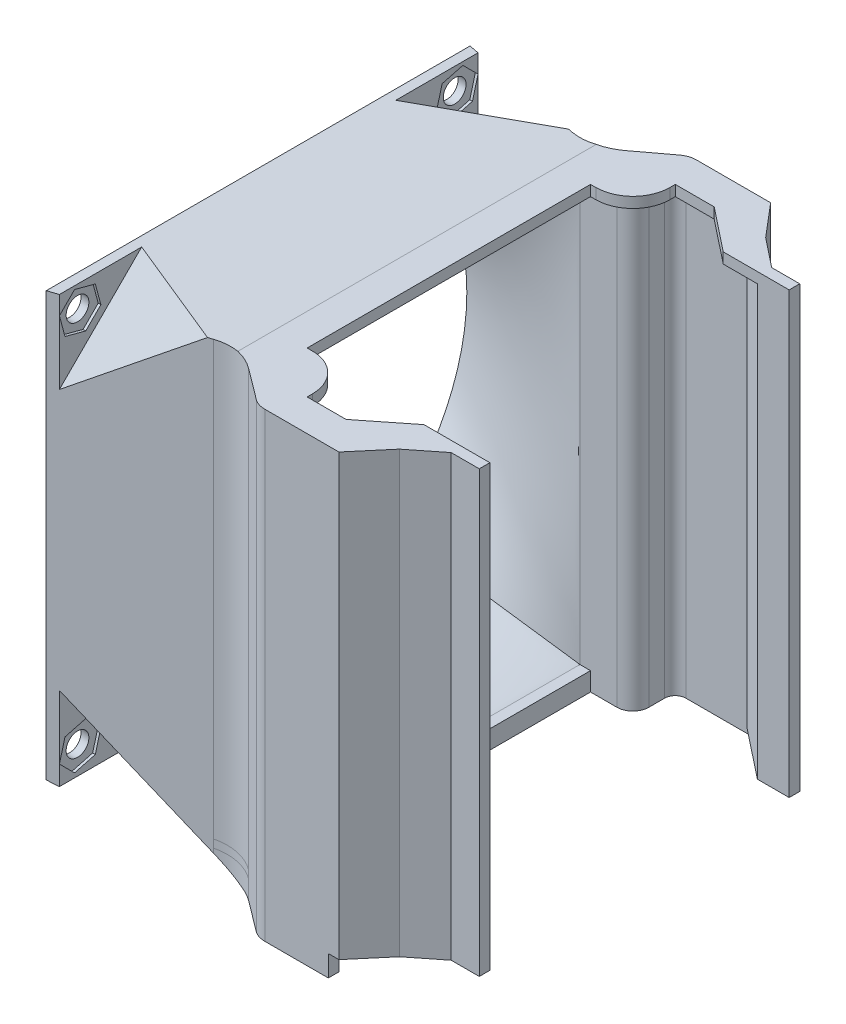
ISO-10303-21;
HEADER;
FILE_DESCRIPTION(('STEP AP214'),'2;1');
FILE_NAME('part.step','',(''),(''),'','','');
FILE_SCHEMA(('AUTOMOTIVE_DESIGN { 1 0 10303 214 1 1 1 1 }'));
ENDSEC;
DATA;
#1=APPLICATION_CONTEXT('core data for automotive mechanical design processes');
#2=APPLICATION_PROTOCOL_DEFINITION('international standard','automotive_design',2000,#1);
#3=PRODUCT_CONTEXT('',#1,'mechanical');
#4=PRODUCT('Part','Part','',(#3));
#5=PRODUCT_RELATED_PRODUCT_CATEGORY('part','',(#4));
#6=PRODUCT_DEFINITION_FORMATION('','',#4);
#7=PRODUCT_DEFINITION_CONTEXT('part definition',#1,'design');
#8=PRODUCT_DEFINITION('design','',#6,#7);
#9=PRODUCT_DEFINITION_SHAPE('','',#8);
#10=(LENGTH_UNIT() NAMED_UNIT(*) SI_UNIT(.MILLI.,.METRE.));
#11=(NAMED_UNIT(*) PLANE_ANGLE_UNIT() SI_UNIT($,.RADIAN.));
#12=(NAMED_UNIT(*) SI_UNIT($,.STERADIAN.) SOLID_ANGLE_UNIT());
#13=UNCERTAINTY_MEASURE_WITH_UNIT(LENGTH_MEASURE(1.E-05),#10,'distance_accuracy_value','');
#14=(GEOMETRIC_REPRESENTATION_CONTEXT(3) GLOBAL_UNCERTAINTY_ASSIGNED_CONTEXT((#13)) GLOBAL_UNIT_ASSIGNED_CONTEXT((#10,
#11,#12)) REPRESENTATION_CONTEXT('',''));
#15=CARTESIAN_POINT('',(0.,0.,0.));
#16=DIRECTION('',(0.,0.,1.));
#17=DIRECTION('',(1.,0.,0.));
#18=AXIS2_PLACEMENT_3D('',#15,#16,#17);
#19=CARTESIAN_POINT('',(0.,81.,0.));
#20=DIRECTION('',(0.,1.,0.));
#21=DIRECTION('',(0.,0.,1.));
#22=AXIS2_PLACEMENT_3D('',#19,#20,#21);
#23=PLANE('',#22);
#24=DIRECTION('',(-1.,0.,0.));
#25=VECTOR('',#24,1.);
#26=CARTESIAN_POINT('',(0.,81.,28.25));
#27=LINE('',#26,#25);
#28=CARTESIAN_POINT('',(-36.,81.,28.25));
#29=VERTEX_POINT('',#28);
#30=CARTESIAN_POINT('',(-42.4443064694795,81.,28.25));
#31=VERTEX_POINT('',#30);
#32=EDGE_CURVE('E1704',#29,#31,#27,.T.);
#33=ORIENTED_EDGE('',*,*,#32,.F.);
#34=DIRECTION('',(-0.784045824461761,0.,0.620702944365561));
#35=VECTOR('',#34,1.);
#36=CARTESIAN_POINT('',(-0.121664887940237,81.,-0.153681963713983));
#37=LINE('',#36,#35);
#38=CARTESIAN_POINT('',(-45.5005431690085,81.,35.7712633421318));
#39=VERTEX_POINT('',#38);
#40=EDGE_CURVE('E560',#29,#39,#37,.T.);
#41=ORIENTED_EDGE('',*,*,#40,.T.);
#42=DIRECTION('',(-0.642787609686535,0.,0.766044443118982));
#43=VECTOR('',#42,1.);
#44=CARTESIAN_POINT('',(-9.08690604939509,81.,-7.62481951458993));
#45=LINE('',#44,#43);
#46=CARTESIAN_POINT('',(-48.,81.,38.75));
#47=VERTEX_POINT('',#46);
#48=EDGE_CURVE('E1511',#39,#47,#45,.T.);
#49=ORIENTED_EDGE('',*,*,#48,.T.);
#50=DIRECTION('',(-1.,0.,0.));
#51=VECTOR('',#50,1.);
#52=CARTESIAN_POINT('',(0.,81.,38.75));
#53=LINE('',#52,#51);
#54=CARTESIAN_POINT('',(-60.,81.,38.75));
#55=VERTEX_POINT('',#54);
#56=EDGE_CURVE('E1784',#47,#55,#53,.T.);
#57=ORIENTED_EDGE('',*,*,#56,.T.);
#58=CARTESIAN_POINT('',(-60.,81.,36.75));
#59=DIRECTION('',(0.,1.,0.));
#60=DIRECTION('',(0.,0.,1.));
#61=AXIS2_PLACEMENT_3D('',#58,#59,#60);
#62=CIRCLE('',#61,2.);
#63=CARTESIAN_POINT('',(-62.,81.,36.75));
#64=VERTEX_POINT('',#63);
#65=EDGE_CURVE('E1787',#55,#64,#62,.F.);
#66=ORIENTED_EDGE('',*,*,#65,.T.);
#67=DIRECTION('',(0.,0.,-1.));
#68=VECTOR('',#67,1.);
#69=CARTESIAN_POINT('',(-62.0000000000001,81.,1.43403807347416E-13));
#70=LINE('',#69,#68);
#71=CARTESIAN_POINT('',(-62.,81.,33.75));
#72=VERTEX_POINT('',#71);
#73=EDGE_CURVE('E1789',#64,#72,#70,.T.);
#74=ORIENTED_EDGE('',*,*,#73,.T.);
#75=CARTESIAN_POINT('',(-65.,81.,33.75));
#76=DIRECTION('',(0.,1.,0.));
#77=DIRECTION('',(0.,0.,1.));
#78=AXIS2_PLACEMENT_3D('',#75,#76,#77);
#79=CIRCLE('',#78,3.);
#80=CARTESIAN_POINT('',(-65.,81.,30.75));
#81=VERTEX_POINT('',#80);
#82=EDGE_CURVE('E1791',#72,#81,#79,.T.);
#83=ORIENTED_EDGE('',*,*,#82,.T.);
#84=DIRECTION('',(-1.,0.,0.));
#85=VECTOR('',#84,1.);
#86=CARTESIAN_POINT('',(0.,81.,30.75));
#87=LINE('',#86,#85);
#88=CARTESIAN_POINT('',(-72.,81.,30.75));
#89=VERTEX_POINT('',#88);
#90=EDGE_CURVE('E1793',#81,#89,#87,.T.);
#91=ORIENTED_EDGE('',*,*,#90,.T.);
#92=DIRECTION('',(0.,0.,1.));
#93=VECTOR('',#92,1.);
#94=CARTESIAN_POINT('',(-72.,81.,-30.75));
#95=LINE('',#94,#93);
#96=CARTESIAN_POINT('',(-72.,81.,-30.75));
#97=VERTEX_POINT('',#96);
#98=EDGE_CURVE('E1625',#97,#89,#95,.T.);
#99=ORIENTED_EDGE('',*,*,#98,.F.);
#100=DIRECTION('',(-1.,0.,0.));
#101=VECTOR('',#100,1.);
#102=CARTESIAN_POINT('',(0.,81.,-30.75));
#103=LINE('',#102,#101);
#104=CARTESIAN_POINT('',(-65.,81.,-30.75));
#105=VERTEX_POINT('',#104);
#106=EDGE_CURVE('E1796',#105,#97,#103,.T.);
#107=ORIENTED_EDGE('',*,*,#106,.F.);
#108=CARTESIAN_POINT('',(-65.,81.,-33.75));
#109=DIRECTION('',(0.,1.,0.));
#110=DIRECTION('',(0.,0.,1.));
#111=AXIS2_PLACEMENT_3D('',#108,#109,#110);
#112=CIRCLE('',#111,3.);
#113=CARTESIAN_POINT('',(-62.,81.,-33.75));
#114=VERTEX_POINT('',#113);
#115=EDGE_CURVE('E1798',#114,#105,#112,.F.);
#116=ORIENTED_EDGE('',*,*,#115,.F.);
#117=DIRECTION('',(0.,0.,1.));
#118=VECTOR('',#117,1.);
#119=CARTESIAN_POINT('',(-62.0000000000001,81.,-1.43403807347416E-13));
#120=LINE('',#119,#118);
#121=CARTESIAN_POINT('',(-62.,81.,-36.75));
#122=VERTEX_POINT('',#121);
#123=EDGE_CURVE('E1801',#122,#114,#120,.T.);
#124=ORIENTED_EDGE('',*,*,#123,.F.);
#125=CARTESIAN_POINT('',(-60.,81.,-36.75));
#126=DIRECTION('',(0.,1.,0.));
#127=DIRECTION('',(0.,0.,1.));
#128=AXIS2_PLACEMENT_3D('',#125,#126,#127);
#129=CIRCLE('',#128,2.);
#130=CARTESIAN_POINT('',(-60.,81.,-38.75));
#131=VERTEX_POINT('',#130);
#132=EDGE_CURVE('E1804',#131,#122,#129,.T.);
#133=ORIENTED_EDGE('',*,*,#132,.F.);
#134=DIRECTION('',(-1.,0.,0.));
#135=VECTOR('',#134,1.);
#136=CARTESIAN_POINT('',(0.,81.,-38.75));
#137=LINE('',#136,#135);
#138=CARTESIAN_POINT('',(-48.,81.,-38.75));
#139=VERTEX_POINT('',#138);
#140=EDGE_CURVE('E1807',#139,#131,#137,.T.);
#141=ORIENTED_EDGE('',*,*,#140,.F.);
#142=DIRECTION('',(-0.642787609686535,0.,-0.766044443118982));
#143=VECTOR('',#142,1.);
#144=CARTESIAN_POINT('',(-9.08690604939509,81.,7.62481951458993));
#145=LINE('',#144,#143);
#146=CARTESIAN_POINT('',(-45.5005431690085,81.,-35.7712633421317));
#147=VERTEX_POINT('',#146);
#148=EDGE_CURVE('E1507',#147,#139,#145,.T.);
#149=ORIENTED_EDGE('',*,*,#148,.F.);
#150=DIRECTION('',(-0.784045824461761,0.,-0.620702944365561));
#151=VECTOR('',#150,1.);
#152=CARTESIAN_POINT('',(-0.121664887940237,81.,0.153681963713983));
#153=LINE('',#152,#151);
#154=CARTESIAN_POINT('',(-36.,81.,-28.25));
#155=VERTEX_POINT('',#154);
#156=EDGE_CURVE('E1810',#155,#147,#153,.T.);
#157=ORIENTED_EDGE('',*,*,#156,.F.);
#158=DIRECTION('',(-1.,0.,0.));
#159=VECTOR('',#158,1.);
#160=CARTESIAN_POINT('',(0.,81.,-28.25));
#161=LINE('',#160,#159);
#162=CARTESIAN_POINT('',(-42.4443064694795,81.,-28.25));
#163=VERTEX_POINT('',#162);
#164=EDGE_CURVE('E1635',#155,#163,#161,.T.);
#165=ORIENTED_EDGE('',*,*,#164,.T.);
#166=DIRECTION('',(-0.784045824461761,0.,-0.620702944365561));
#167=VECTOR('',#166,1.);
#168=CARTESIAN_POINT('',(-2.60447666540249,81.,3.28986526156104));
#169=LINE('',#168,#167);
#170=CARTESIAN_POINT('',(-50.4828117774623,81.,-34.613816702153));
#171=VERTEX_POINT('',#170);
#172=EDGE_CURVE('E1643',#163,#171,#169,.T.);
#173=ORIENTED_EDGE('',*,*,#172,.T.);
#174=CARTESIAN_POINT('',(-48.,81.,-37.75));
#175=DIRECTION('',(0.,1.,0.));
#176=DIRECTION('',(0.,0.,1.));
#177=AXIS2_PLACEMENT_3D('',#174,#175,#176);
#178=CIRCLE('',#177,4.);
#179=CARTESIAN_POINT('',(-50.6457513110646,81.,-34.75));
#180=VERTEX_POINT('',#179);
#181=EDGE_CURVE('E1733',#171,#180,#178,.F.);
#182=ORIENTED_EDGE('',*,*,#181,.T.);
#183=DIRECTION('',(-1.,0.,0.));
#184=VECTOR('',#183,1.);
#185=CARTESIAN_POINT('',(0.,81.,-34.75));
#186=LINE('',#185,#184);
#187=CARTESIAN_POINT('',(-58.,81.,-34.75));
#188=VERTEX_POINT('',#187);
#189=EDGE_CURVE('E1730',#180,#188,#186,.T.);
#190=ORIENTED_EDGE('',*,*,#189,.T.);
#191=DIRECTION('',(0.,0.,1.));
#192=VECTOR('',#191,1.);
#193=CARTESIAN_POINT('',(-58.0000000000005,81.,-8.04911692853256E-13));
#194=LINE('',#193,#192);
#195=CARTESIAN_POINT('',(-58.,81.,-33.75));
#196=VERTEX_POINT('',#195);
#197=EDGE_CURVE('E1727',#188,#196,#194,.T.);
#198=ORIENTED_EDGE('',*,*,#197,.T.);
#199=CARTESIAN_POINT('',(-65.,81.,-33.75));
#200=DIRECTION('',(0.,1.,0.));
#201=DIRECTION('',(0.,0.,1.));
#202=AXIS2_PLACEMENT_3D('',#199,#200,#201);
#203=CIRCLE('',#202,7.);
#204=CARTESIAN_POINT('',(-65.,81.,-26.75));
#205=VERTEX_POINT('',#204);
#206=EDGE_CURVE('E1724',#196,#205,#203,.F.);
#207=ORIENTED_EDGE('',*,*,#206,.T.);
#208=DIRECTION('',(-1.,0.,0.));
#209=VECTOR('',#208,1.);
#210=CARTESIAN_POINT('',(0.,81.,-26.75));
#211=LINE('',#210,#209);
#212=CARTESIAN_POINT('',(-66.,81.,-26.75));
#213=VERTEX_POINT('',#212);
#214=EDGE_CURVE('E1721',#205,#213,#211,.T.);
#215=ORIENTED_EDGE('',*,*,#214,.T.);
#216=DIRECTION('',(0.,0.,-1.));
#217=VECTOR('',#216,1.);
#218=CARTESIAN_POINT('',(-66.,81.,0.));
#219=LINE('',#218,#217);
#220=CARTESIAN_POINT('',(-66.,81.,26.75));
#221=VERTEX_POINT('',#220);
#222=EDGE_CURVE('E1718',#221,#213,#219,.T.);
#223=ORIENTED_EDGE('',*,*,#222,.F.);
#224=DIRECTION('',(-1.,0.,0.));
#225=VECTOR('',#224,1.);
#226=CARTESIAN_POINT('',(-3.71230823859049E-13,81.,26.7500000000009));
#227=LINE('',#226,#225);
#228=CARTESIAN_POINT('',(-65.,81.,26.75));
#229=VERTEX_POINT('',#228);
#230=EDGE_CURVE('E1716',#229,#221,#227,.T.);
#231=ORIENTED_EDGE('',*,*,#230,.F.);
#232=CARTESIAN_POINT('',(-65.,81.,33.75));
#233=DIRECTION('',(0.,1.,0.));
#234=DIRECTION('',(0.,0.,1.));
#235=AXIS2_PLACEMENT_3D('',#232,#233,#234);
#236=CIRCLE('',#235,7.);
#237=CARTESIAN_POINT('',(-58.,81.,33.75));
#238=VERTEX_POINT('',#237);
#239=EDGE_CURVE('E1714',#238,#229,#236,.T.);
#240=ORIENTED_EDGE('',*,*,#239,.F.);
#241=DIRECTION('',(0.,0.,-1.));
#242=VECTOR('',#241,1.);
#243=CARTESIAN_POINT('',(-58.,81.,0.));
#244=LINE('',#243,#242);
#245=CARTESIAN_POINT('',(-58.,81.,34.75));
#246=VERTEX_POINT('',#245);
#247=EDGE_CURVE('E1712',#246,#238,#244,.T.);
#248=ORIENTED_EDGE('',*,*,#247,.F.);
#249=DIRECTION('',(-1.,0.,0.));
#250=VECTOR('',#249,1.);
#251=CARTESIAN_POINT('',(0.,81.,34.75));
#252=LINE('',#251,#250);
#253=CARTESIAN_POINT('',(-50.6457513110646,81.,34.75));
#254=VERTEX_POINT('',#253);
#255=EDGE_CURVE('E1710',#254,#246,#252,.T.);
#256=ORIENTED_EDGE('',*,*,#255,.F.);
#257=CARTESIAN_POINT('',(-48.,81.,37.75));
#258=DIRECTION('',(0.,1.,0.));
#259=DIRECTION('',(0.,0.,1.));
#260=AXIS2_PLACEMENT_3D('',#257,#258,#259);
#261=CIRCLE('',#260,4.);
#262=CARTESIAN_POINT('',(-50.4828117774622,81.,34.613816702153));
#263=VERTEX_POINT('',#262);
#264=EDGE_CURVE('E1708',#263,#254,#261,.T.);
#265=ORIENTED_EDGE('',*,*,#264,.F.);
#266=DIRECTION('',(-0.784045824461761,0.,0.620702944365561));
#267=VECTOR('',#266,1.);
#268=CARTESIAN_POINT('',(-2.60447666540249,81.,-3.28986526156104));
#269=LINE('',#268,#267);
#270=EDGE_CURVE('E1706',#31,#263,#269,.T.);
#271=ORIENTED_EDGE('',*,*,#270,.F.);
#272=EDGE_LOOP('',(#33,#41,#49,#57,#66,#74,#83,#91,#99,#107,#116,#124,#133,#141,#149,#157,#165,
#173,#182,#190,#198,#207,#215,#223,#231,#240,#248,#256,#265,#271));
#273=FACE_BOUND('',#272,.T.);
#274=ADVANCED_FACE('F543',(#273),#23,.F.);
#275=CARTESIAN_POINT('',(-100.,0.,0.));
#276=DIRECTION('',(-1.,0.,0.));
#277=DIRECTION('',(0.,0.,1.));
#278=AXIS2_PLACEMENT_3D('',#275,#276,#277);
#279=PLANE('',#278);
#280=DIRECTION('',(0.,0.,-1.));
#281=VECTOR('',#280,1.);
#282=CARTESIAN_POINT('',(-100.,0.666666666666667,40.));
#283=LINE('',#282,#281);
#284=CARTESIAN_POINT('',(-100.,0.666666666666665,-23.7851295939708));
#285=VERTEX_POINT('',#284);
#286=CARTESIAN_POINT('',(-100.,0.666666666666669,-39.5166666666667));
#287=VERTEX_POINT('',#286);
#288=EDGE_CURVE('E1481',#285,#287,#283,.T.);
#289=ORIENTED_EDGE('',*,*,#288,.T.);
#290=DIRECTION('',(0.,1.,0.));
#291=VECTOR('',#290,1.);
#292=CARTESIAN_POINT('',(-100.,1.,-39.5166666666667));
#293=LINE('',#292,#291);
#294=CARTESIAN_POINT('',(-100.,16.3982037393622,-39.5166666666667));
#295=VERTEX_POINT('',#294);
#296=EDGE_CURVE('E1861',#287,#295,#293,.T.);
#297=ORIENTED_EDGE('',*,*,#296,.T.);
#298=DIRECTION('',(0.,0.707106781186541,-0.707106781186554));
#299=VECTOR('',#298,1.);
#300=CARTESIAN_POINT('',(-100.,-11.5592314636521,-11.5592314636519));
#301=LINE('',#300,#299);
#302=EDGE_CURVE('E1467',#285,#295,#301,.T.);
#303=ORIENTED_EDGE('',*,*,#302,.F.);
#304=EDGE_LOOP('',(#289,#297,#303));
#305=FACE_BOUND('',#304,.T.);
#306=DIRECTION('',(0.,0.258819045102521,0.965925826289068));
#307=VECTOR('',#306,1.);
#308=CARTESIAN_POINT('',(-100.,17.3261596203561,-4.64253047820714));
#309=LINE('',#308,#307);
#310=CARTESIAN_POINT('',(-100.,8.26378246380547,-38.4637824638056));
#311=VERTEX_POINT('',#310);
#312=CARTESIAN_POINT('',(-100.,9.31199959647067,-34.5517828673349));
#313=VERTEX_POINT('',#312);
#314=EDGE_CURVE('E1296',#311,#313,#309,.T.);
#315=ORIENTED_EDGE('',*,*,#314,.F.);
#316=DIRECTION('',(0.,0.96592582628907,0.258819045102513));
#317=VECTOR('',#316,1.);
#318=CARTESIAN_POINT('',(-100.,10.1695140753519,-37.9531432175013));
#319=LINE('',#318,#317);
#320=CARTESIAN_POINT('',(-100.,4.35178286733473,-39.5119995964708));
#321=VERTEX_POINT('',#320);
#322=EDGE_CURVE('E1274',#321,#311,#319,.T.);
#323=ORIENTED_EDGE('',*,*,#322,.F.);
#324=DIRECTION('',(0.,0.707106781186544,-0.707106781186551));
#325=VECTOR('',#324,1.);
#326=CARTESIAN_POINT('',(-100.,-17.580108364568,-17.5801083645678));
#327=LINE('',#326,#325);
#328=CARTESIAN_POINT('',(-100.,1.48800040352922,-36.6482171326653));
#329=VERTEX_POINT('',#328);
#330=EDGE_CURVE('E1279',#329,#321,#327,.T.);
#331=ORIENTED_EDGE('',*,*,#330,.F.);
#332=DIRECTION('',(0.,-0.258819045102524,-0.965925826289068));
#333=VECTOR('',#332,1.);
#334=CARTESIAN_POINT('',(-100.,10.5503775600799,-2.82696514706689));
#335=LINE('',#334,#333);
#336=CARTESIAN_POINT('',(-100.,2.53621753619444,-32.7362175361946));
#337=VERTEX_POINT('',#336);
#338=EDGE_CURVE('E1305',#337,#329,#335,.T.);
#339=ORIENTED_EDGE('',*,*,#338,.F.);
#340=DIRECTION('',(0.,-0.965925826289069,-0.258819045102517));
#341=VECTOR('',#340,1.);
#342=CARTESIAN_POINT('',(-100.,8.35394874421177,-31.177361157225));
#343=LINE('',#342,#341);
#344=CARTESIAN_POINT('',(-100.,6.44821713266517,-31.6880004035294));
#345=VERTEX_POINT('',#344);
#346=EDGE_CURVE('E1302',#345,#337,#343,.T.);
#347=ORIENTED_EDGE('',*,*,#346,.F.);
#348=DIRECTION('',(0.,-0.707106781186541,0.707106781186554));
#349=VECTOR('',#348,1.);
#350=CARTESIAN_POINT('',(-100.,-12.619891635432,-12.6198916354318));
#351=LINE('',#350,#349);
#352=EDGE_CURVE('E1299',#313,#345,#351,.T.);
#353=ORIENTED_EDGE('',*,*,#352,.F.);
#354=EDGE_LOOP('',(#315,#323,#331,#339,#347,#353));
#355=FACE_BOUND('',#354,.T.);
#356=ADVANCED_FACE('F2254',(#305,#355),#279,.F.);
#357=CARTESIAN_POINT('',(-100.,0.,0.));
#358=DIRECTION('',(-1.,0.,0.));
#359=DIRECTION('',(0.,0.,1.));
#360=AXIS2_PLACEMENT_3D('',#357,#358,#359);
#361=PLANE('',#360);
#362=DIRECTION('',(0.,0.,1.));
#363=VECTOR('',#362,1.);
#364=CARTESIAN_POINT('',(-100.,81.1333333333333,-40.));
#365=LINE('',#364,#363);
#366=CARTESIAN_POINT('',(-100.,81.1333333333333,-39.5166666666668));
#367=VERTEX_POINT('',#366);
#368=CARTESIAN_POINT('',(-100.,81.1333333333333,-23.9851295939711));
#369=VERTEX_POINT('',#368);
#370=EDGE_CURVE('E1487',#367,#369,#365,.T.);
#371=ORIENTED_EDGE('',*,*,#370,.T.);
#372=DIRECTION('',(0.,0.707106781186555,0.707106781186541));
#373=VECTOR('',#372,1.);
#374=CARTESIAN_POINT('',(-100.,52.5592314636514,-52.5592314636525));
#375=LINE('',#374,#373);
#376=CARTESIAN_POINT('',(-100.,65.6017962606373,-39.5166666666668));
#377=VERTEX_POINT('',#376);
#378=EDGE_CURVE('E1471',#377,#369,#375,.T.);
#379=ORIENTED_EDGE('',*,*,#378,.F.);
#380=DIRECTION('',(0.,1.,0.));
#381=VECTOR('',#380,1.);
#382=CARTESIAN_POINT('',(-100.,1.,-39.5166666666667));
#383=LINE('',#382,#381);
#384=EDGE_CURVE('E1871',#377,#367,#383,.T.);
#385=ORIENTED_EDGE('',*,*,#384,.T.);
#386=EDGE_LOOP('',(#371,#379,#385));
#387=FACE_BOUND('',#386,.T.);
#388=DIRECTION('',(0.,-0.965925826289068,0.258819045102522));
#389=VECTOR('',#388,1.);
#390=CARTESIAN_POINT('',(-100.,-2.86099029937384,-10.6773611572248));
#391=LINE('',#390,#389);
#392=CARTESIAN_POINT('',(-100.,79.4637824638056,-32.7362175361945));
#393=VERTEX_POINT('',#392);
#394=CARTESIAN_POINT('',(-100.,75.5517828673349,-31.6880004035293));
#395=VERTEX_POINT('',#394);
#396=EDGE_CURVE('E1345',#393,#395,#391,.T.);
#397=ORIENTED_EDGE('',*,*,#396,.F.);
#398=DIRECTION('',(0.,-0.258819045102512,0.965925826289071));
#399=VECTOR('',#398,1.);
#400=CARTESIAN_POINT('',(-100.,65.9566639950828,17.6730348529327));
#401=LINE('',#400,#399);
#402=CARTESIAN_POINT('',(-100.,80.5119995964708,-36.6482171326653));
#403=VERTEX_POINT('',#402);
#404=EDGE_CURVE('E1343',#403,#393,#401,.T.);
#405=ORIENTED_EDGE('',*,*,#404,.F.);
#406=DIRECTION('',(0.,0.707106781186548,0.707106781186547));
#407=VECTOR('',#406,1.);
#408=CARTESIAN_POINT('',(-100.,58.5801083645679,-58.5801083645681));
#409=LINE('',#408,#407);
#410=CARTESIAN_POINT('',(-100.,77.6482171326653,-39.5119995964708));
#411=VERTEX_POINT('',#410);
#412=EDGE_CURVE('E1327',#411,#403,#409,.T.);
#413=ORIENTED_EDGE('',*,*,#412,.F.);
#414=DIRECTION('',(0.,0.965925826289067,-0.258819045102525));
#415=VECTOR('',#414,1.);
#416=CARTESIAN_POINT('',(-100.,-4.67655563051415,-17.4531432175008));
#417=LINE('',#416,#415);
#418=CARTESIAN_POINT('',(-100.,73.7362175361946,-38.4637824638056));
#419=VERTEX_POINT('',#418);
#420=EDGE_CURVE('E1355',#419,#411,#417,.T.);
#421=ORIENTED_EDGE('',*,*,#420,.F.);
#422=DIRECTION('',(0.,0.258819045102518,-0.965925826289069));
#423=VECTOR('',#422,1.);
#424=CARTESIAN_POINT('',(-100.,59.1808819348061,15.8574695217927));
#425=LINE('',#424,#423);
#426=CARTESIAN_POINT('',(-100.,72.6880004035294,-34.5517828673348));
#427=VERTEX_POINT('',#426);
#428=EDGE_CURVE('E1352',#427,#419,#425,.T.);
#429=ORIENTED_EDGE('',*,*,#428,.F.);
#430=DIRECTION('',(0.,-0.707106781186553,-0.707106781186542));
#431=VECTOR('',#430,1.);
#432=CARTESIAN_POINT('',(-100.,53.6198916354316,-53.6198916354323));
#433=LINE('',#432,#431);
#434=EDGE_CURVE('E1349',#395,#427,#433,.T.);
#435=ORIENTED_EDGE('',*,*,#434,.F.);
#436=EDGE_LOOP('',(#397,#405,#413,#421,#429,#435));
#437=FACE_BOUND('',#436,.T.);
#438=ADVANCED_FACE('F2260',(#387,#437),#361,.F.);
#439=CARTESIAN_POINT('',(-100.,0.,0.));
#440=DIRECTION('',(-1.,0.,0.));
#441=DIRECTION('',(0.,0.,1.));
#442=AXIS2_PLACEMENT_3D('',#439,#440,#441);
#443=PLANE('',#442);
#444=DIRECTION('',(0.,-1.,0.));
#445=VECTOR('',#444,1.);
#446=CARTESIAN_POINT('',(-100.,81.,39.5166666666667));
#447=LINE('',#446,#445);
#448=CARTESIAN_POINT('',(-100.,16.3982037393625,39.5166666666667));
#449=VERTEX_POINT('',#448);
#450=CARTESIAN_POINT('',(-100.,0.666666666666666,39.5166666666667));
#451=VERTEX_POINT('',#450);
#452=EDGE_CURVE('E1491',#449,#451,#447,.T.);
#453=ORIENTED_EDGE('',*,*,#452,.T.);
#454=DIRECTION('',(0.,0.,-1.));
#455=VECTOR('',#454,1.);
#456=CARTESIAN_POINT('',(-100.,0.666666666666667,40.));
#457=LINE('',#456,#455);
#458=CARTESIAN_POINT('',(-100.,0.666666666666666,23.7851295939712));
#459=VERTEX_POINT('',#458);
#460=EDGE_CURVE('E1882',#451,#459,#457,.T.);
#461=ORIENTED_EDGE('',*,*,#460,.T.);
#462=DIRECTION('',(0.,-0.707106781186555,-0.707106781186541));
#463=VECTOR('',#462,1.);
#464=CARTESIAN_POINT('',(-100.,-11.5592314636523,11.5592314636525));
#465=LINE('',#464,#463);
#466=EDGE_CURVE('E1474',#449,#459,#465,.T.);
#467=ORIENTED_EDGE('',*,*,#466,.F.);
#468=EDGE_LOOP('',(#453,#461,#467));
#469=FACE_BOUND('',#468,.T.);
#470=DIRECTION('',(0.,0.965925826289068,-0.258819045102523));
#471=VECTOR('',#470,1.);
#472=CARTESIAN_POINT('',(-100.,8.35394874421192,31.1773611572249));
#473=LINE('',#472,#471);
#474=CARTESIAN_POINT('',(-100.,2.53621753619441,32.7362175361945));
#475=VERTEX_POINT('',#474);
#476=CARTESIAN_POINT('',(-100.,6.44821713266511,31.6880004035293));
#477=VERTEX_POINT('',#476);
#478=EDGE_CURVE('E1394',#475,#477,#473,.T.);
#479=ORIENTED_EDGE('',*,*,#478,.F.);
#480=DIRECTION('',(0.,0.258819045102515,-0.96592582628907));
#481=VECTOR('',#480,1.);
#482=CARTESIAN_POINT('',(-100.,10.5503775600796,2.82696514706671));
#483=LINE('',#482,#481);
#484=CARTESIAN_POINT('',(-100.,1.48800040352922,36.6482171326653));
#485=VERTEX_POINT('',#484);
#486=EDGE_CURVE('E1312',#485,#475,#483,.T.);
#487=ORIENTED_EDGE('',*,*,#486,.F.);
#488=DIRECTION('',(0.,-0.707106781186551,-0.707106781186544));
#489=VECTOR('',#488,1.);
#490=CARTESIAN_POINT('',(-100.,-17.580108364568,17.5801083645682));
#491=LINE('',#490,#489);
#492=CARTESIAN_POINT('',(-100.,4.35178286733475,39.5119995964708));
#493=VERTEX_POINT('',#492);
#494=EDGE_CURVE('E1377',#493,#485,#491,.T.);
#495=ORIENTED_EDGE('',*,*,#494,.F.);
#496=DIRECTION('',(0.,-0.965925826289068,0.258819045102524));
#497=VECTOR('',#496,1.);
#498=CARTESIAN_POINT('',(-100.,10.1695140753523,37.9531432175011));
#499=LINE('',#498,#497);
#500=CARTESIAN_POINT('',(-100.,8.26378246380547,38.4637824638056));
#501=VERTEX_POINT('',#500);
#502=EDGE_CURVE('E1403',#501,#493,#499,.T.);
#503=ORIENTED_EDGE('',*,*,#502,.F.);
#504=DIRECTION('',(0.,-0.258819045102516,0.96592582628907));
#505=VECTOR('',#504,1.);
#506=CARTESIAN_POINT('',(-100.,17.3261596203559,4.64253047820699));
#507=LINE('',#506,#505);
#508=CARTESIAN_POINT('',(-100.,9.31199959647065,34.5517828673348));
#509=VERTEX_POINT('',#508);
#510=EDGE_CURVE('E1400',#509,#501,#507,.T.);
#511=ORIENTED_EDGE('',*,*,#510,.F.);
#512=DIRECTION('',(0.,0.707106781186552,0.707106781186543));
#513=VECTOR('',#512,1.);
#514=CARTESIAN_POINT('',(-100.,-12.6198916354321,12.6198916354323));
#515=LINE('',#514,#513);
#516=EDGE_CURVE('E1397',#477,#509,#515,.T.);
#517=ORIENTED_EDGE('',*,*,#516,.F.);
#518=EDGE_LOOP('',(#479,#487,#495,#503,#511,#517));
#519=FACE_BOUND('',#518,.T.);
#520=ADVANCED_FACE('F2528',(#469,#519),#443,.F.);
#521=CARTESIAN_POINT('',(-100.,0.,0.));
#522=DIRECTION('',(-1.,0.,0.));
#523=DIRECTION('',(0.,0.,1.));
#524=AXIS2_PLACEMENT_3D('',#521,#522,#523);
#525=PLANE('',#524);
#526=DIRECTION('',(0.,-1.,0.));
#527=VECTOR('',#526,1.);
#528=CARTESIAN_POINT('',(-100.,81.,39.5166666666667));
#529=LINE('',#528,#527);
#530=CARTESIAN_POINT('',(-100.,81.1333333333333,39.5166666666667));
#531=VERTEX_POINT('',#530);
#532=CARTESIAN_POINT('',(-100.,65.601796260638,39.5166666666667));
#533=VERTEX_POINT('',#532);
#534=EDGE_CURVE('E1495',#531,#533,#529,.T.);
#535=ORIENTED_EDGE('',*,*,#534,.T.);
#536=DIRECTION('',(0.,-0.707106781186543,0.707106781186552));
#537=VECTOR('',#536,1.);
#538=CARTESIAN_POINT('',(-100.,52.5592314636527,52.5592314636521));
#539=LINE('',#538,#537);
#540=CARTESIAN_POINT('',(-100.,81.1333333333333,23.9851295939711));
#541=VERTEX_POINT('',#540);
#542=EDGE_CURVE('E1456',#541,#533,#539,.T.);
#543=ORIENTED_EDGE('',*,*,#542,.F.);
#544=DIRECTION('',(0.,0.,1.));
#545=VECTOR('',#544,1.);
#546=CARTESIAN_POINT('',(-100.,81.1333333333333,-40.));
#547=LINE('',#546,#545);
#548=EDGE_CURVE('E1886',#541,#531,#547,.T.);
#549=ORIENTED_EDGE('',*,*,#548,.T.);
#550=EDGE_LOOP('',(#535,#543,#549));
#551=FACE_BOUND('',#550,.T.);
#552=DIRECTION('',(0.,0.258819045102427,0.965925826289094));
#553=VECTOR('',#552,1.);
#554=CARTESIAN_POINT('',(-100.,65.9566639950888,-17.6730348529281));
#555=LINE('',#554,#553);
#556=CARTESIAN_POINT('',(-100.,79.4637824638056,32.7362175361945));
#557=VERTEX_POINT('',#556);
#558=CARTESIAN_POINT('',(-100.,80.5119995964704,36.6482171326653));
#559=VERTEX_POINT('',#558);
#560=EDGE_CURVE('E1440',#557,#559,#555,.T.);
#561=ORIENTED_EDGE('',*,*,#560,.F.);
#562=DIRECTION('',(0.,0.96592582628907,0.258819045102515));
#563=VECTOR('',#562,1.);
#564=CARTESIAN_POINT('',(-100.,-2.86099029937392,10.6773611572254));
#565=LINE('',#564,#563);
#566=CARTESIAN_POINT('',(-100.,75.5517828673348,31.6880004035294));
#567=VERTEX_POINT('',#566);
#568=EDGE_CURVE('E1362',#567,#557,#565,.T.);
#569=ORIENTED_EDGE('',*,*,#568,.F.);
#570=DIRECTION('',(0.,0.707106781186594,-0.707106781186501));
#571=VECTOR('',#570,1.);
#572=CARTESIAN_POINT('',(-100.,53.6198916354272,53.6198916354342));
#573=LINE('',#572,#571);
#574=CARTESIAN_POINT('',(-100.,72.6880004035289,34.5517828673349));
#575=VERTEX_POINT('',#574);
#576=EDGE_CURVE('E1423',#575,#567,#573,.T.);
#577=ORIENTED_EDGE('',*,*,#576,.F.);
#578=DIRECTION('',(0.,-0.258819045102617,-0.965925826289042));
#579=VECTOR('',#578,1.);
#580=CARTESIAN_POINT('',(-100.,59.1808819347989,-15.8574695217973));
#581=LINE('',#580,#579);
#582=CARTESIAN_POINT('',(-100.,73.7362175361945,38.4637824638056));
#583=VERTEX_POINT('',#582);
#584=EDGE_CURVE('E1449',#583,#575,#581,.T.);
#585=ORIENTED_EDGE('',*,*,#584,.F.);
#586=DIRECTION('',(0.,-0.96592582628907,-0.258819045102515));
#587=VECTOR('',#586,1.);
#588=CARTESIAN_POINT('',(-100.,-4.67655563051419,17.4531432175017));
#589=LINE('',#588,#587);
#590=CARTESIAN_POINT('',(-100.,77.6482171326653,39.5119995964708));
#591=VERTEX_POINT('',#590);
#592=EDGE_CURVE('E1446',#591,#583,#589,.T.);
#593=ORIENTED_EDGE('',*,*,#592,.F.);
#594=DIRECTION('',(0.,-0.707106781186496,0.707106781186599));
#595=VECTOR('',#594,1.);
#596=CARTESIAN_POINT('',(-100.,58.5801083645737,58.5801083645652));
#597=LINE('',#596,#595);
#598=EDGE_CURVE('E1443',#559,#591,#597,.T.);
#599=ORIENTED_EDGE('',*,*,#598,.F.);
#600=EDGE_LOOP('',(#561,#569,#577,#585,#593,#599));
#601=FACE_BOUND('',#600,.T.);
#602=ADVANCED_FACE('F2016',(#551,#601),#525,.F.);
#603=CARTESIAN_POINT('',(-102.,0.999999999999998,40.));
#604=DIRECTION('',(-0.164398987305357,-0.986393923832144,0.));
#605=DIRECTION('',(0.,0.,-1.));
#606=AXIS2_PLACEMENT_3D('',#603,#604,#605);
#607=PLANE('',#606);
#608=DIRECTION('',(-0.932940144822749,0.155490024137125,0.324723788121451));
#609=VECTOR('',#608,1.);
#610=CARTESIAN_POINT('',(-121.112677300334,4.18544621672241,-16.4365460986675));
#611=LINE('',#610,#609);
#612=CARTESIAN_POINT('',(-74.4145674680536,-3.59757208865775,-32.6905225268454));
#613=VERTEX_POINT('',#612);
#614=EDGE_CURVE('E1483',#613,#285,#611,.T.);
#615=ORIENTED_EDGE('',*,*,#614,.F.);
#616=DIRECTION('',(0.,0.,1.));
#617=VECTOR('',#616,1.);
#618=CARTESIAN_POINT('',(-74.4145674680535,-3.59757208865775,40.));
#619=LINE('',#618,#617);
#620=CARTESIAN_POINT('',(-74.4145674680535,-3.59757208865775,-33.5786509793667));
#621=VERTEX_POINT('',#620);
#622=EDGE_CURVE('E1485',#613,#621,#619,.F.);
#623=ORIENTED_EDGE('',*,*,#622,.T.);
#624=CARTESIAN_POINT('',(-74.2307189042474,-3.62821351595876,-43.5769608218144));
#625=DIRECTION('',(-0.164398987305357,-0.986393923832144,0.));
#626=DIRECTION('',(-0.986393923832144,0.164398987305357,0.));
#627=AXIS2_PLACEMENT_3D('',#624,#625,#626);
#628=ELLIPSE('',#627,10.137937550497,10.);
#629=CARTESIAN_POINT('',(-72.,-4.,-33.8289408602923));
#630=VERTEX_POINT('',#629);
#631=EDGE_CURVE('E2499',#621,#630,#628,.F.);
#632=ORIENTED_EDGE('',*,*,#631,.T.);
#633=DIRECTION('',(0.,0.,-1.));
#634=VECTOR('',#633,1.);
#635=CARTESIAN_POINT('',(-72.,-4.,0.));
#636=LINE('',#635,#634);
#637=CARTESIAN_POINT('',(-72.,-4.,-32.75));
#638=VERTEX_POINT('',#637);
#639=EDGE_CURVE('E1992',#638,#630,#636,.T.);
#640=ORIENTED_EDGE('',*,*,#639,.F.);
#641=DIRECTION('',(0.,0.,1.));
#642=VECTOR('',#641,1.);
#643=CARTESIAN_POINT('',(-72.,-4.,32.75));
#644=LINE('',#643,#642);
#645=CARTESIAN_POINT('',(-72.,-4.,-26.8140625));
#646=VERTEX_POINT('',#645);
#647=EDGE_CURVE('E1961',#638,#646,#644,.T.);
#648=ORIENTED_EDGE('',*,*,#647,.T.);
#649=CARTESIAN_POINT('',(-72.,-4.,26.8140625));
#650=VERTEX_POINT('',#649);
#651=EDGE_CURVE('E1954',#646,#650,#644,.T.);
#652=ORIENTED_EDGE('',*,*,#651,.T.);
#653=CARTESIAN_POINT('',(-72.,-4.,32.75));
#654=DIRECTION('',(0.,0.,-1.));
#655=VECTOR('',#654,1.);
#656=LINE('',#653,#655);
#657=CARTESIAN_POINT('',(-72.,-4.,32.75));
#658=VERTEX_POINT('',#657);
#659=EDGE_CURVE('E1601',#658,#650,#656,.T.);
#660=ORIENTED_EDGE('',*,*,#659,.F.);
#661=DIRECTION('',(0.,0.,1.));
#662=VECTOR('',#661,1.);
#663=CARTESIAN_POINT('',(-72.,-4.,40.));
#664=LINE('',#663,#662);
#665=CARTESIAN_POINT('',(-72.,-4.,33.530948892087));
#666=VERTEX_POINT('',#665);
#667=EDGE_CURVE('E2450',#658,#666,#664,.T.);
#668=ORIENTED_EDGE('',*,*,#667,.T.);
#669=DIRECTION('',(0.93294014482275,-0.155490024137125,0.324723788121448));
#670=VECTOR('',#669,1.);
#671=CARTESIAN_POINT('',(-96.8768486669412,0.146141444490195,24.8721891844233));
#672=LINE('',#671,#670);
#673=EDGE_CURVE('E1884',#459,#666,#672,.T.);
#674=ORIENTED_EDGE('',*,*,#673,.F.);
#675=ORIENTED_EDGE('',*,*,#460,.F.);
#676=DIRECTION('',(0.959508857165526,-0.159918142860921,-0.231881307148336));
#677=VECTOR('',#676,1.);
#678=CARTESIAN_POINT('',(-87.,-1.5,36.375));
#679=LINE('',#678,#677);
#680=CARTESIAN_POINT('',(-102.,0.999999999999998,40.));
#681=VERTEX_POINT('',#680);
#682=EDGE_CURVE('E1904',#681,#451,#679,.T.);
#683=ORIENTED_EDGE('',*,*,#682,.F.);
#684=DIRECTION('',(0.,0.,1.));
#685=VECTOR('',#684,1.);
#686=CARTESIAN_POINT('',(-102.,0.999999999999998,32.75));
#687=LINE('',#686,#685);
#688=CARTESIAN_POINT('',(-102.,0.999999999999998,32.75));
#689=VERTEX_POINT('',#688);
#690=EDGE_CURVE('E2115',#689,#681,#687,.T.);
#691=ORIENTED_EDGE('',*,*,#690,.F.);
#692=DIRECTION('',(0.,0.,1.));
#693=VECTOR('',#692,1.);
#694=CARTESIAN_POINT('',(-102.,0.999999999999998,-32.75));
#695=LINE('',#694,#693);
#696=CARTESIAN_POINT('',(-102.,0.999999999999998,-32.75));
#697=VERTEX_POINT('',#696);
#698=EDGE_CURVE('E1891',#697,#689,#695,.T.);
#699=ORIENTED_EDGE('',*,*,#698,.F.);
#700=DIRECTION('',(0.,0.,-1.));
#701=VECTOR('',#700,1.);
#702=CARTESIAN_POINT('',(-102.,0.999999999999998,-32.75));
#703=LINE('',#702,#701);
#704=CARTESIAN_POINT('',(-102.,0.999999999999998,-40.));
#705=VERTEX_POINT('',#704);
#706=EDGE_CURVE('E2048',#697,#705,#703,.T.);
#707=ORIENTED_EDGE('',*,*,#706,.T.);
#708=DIRECTION('',(0.959508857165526,-0.159918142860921,0.231881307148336));
#709=VECTOR('',#708,1.);
#710=CARTESIAN_POINT('',(-87.,-1.5,-36.375));
#711=LINE('',#710,#709);
#712=EDGE_CURVE('E2051',#705,#287,#711,.T.);
#713=ORIENTED_EDGE('',*,*,#712,.T.);
#714=ORIENTED_EDGE('',*,*,#288,.F.);
#715=EDGE_LOOP('',(#615,#623,#632,#640,#648,#652,#660,#668,#674,#675,#683,#691,#699,#707,#713,#714));
#716=FACE_BOUND('',#715,.T.);
#717=ADVANCED_FACE('F1997',(#716),#607,.T.);
#718=CARTESIAN_POINT('',(-102.,0.999999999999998,-40.));
#719=DIRECTION('',(0.234904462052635,0.,-0.972018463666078));
#720=DIRECTION('',(0.,1.,0.));
#721=AXIS2_PLACEMENT_3D('',#718,#719,#720);
#722=PLANE('',#721);
#723=DIRECTION('',(0.,-1.,0.));
#724=VECTOR('',#723,1.);
#725=CARTESIAN_POINT('',(-76.5797635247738,-0.499999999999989,-33.8567761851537));
#726=LINE('',#725,#724);
#727=CARTESIAN_POINT('',(-76.5797635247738,1.,-33.8567761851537));
#728=VERTEX_POINT('',#727);
#729=CARTESIAN_POINT('',(-76.5797635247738,-0.499999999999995,-33.8567761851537));
#730=VERTEX_POINT('',#729);
#731=EDGE_CURVE('E2474',#728,#730,#726,.T.);
#732=ORIENTED_EDGE('',*,*,#731,.T.);
#733=DIRECTION('',(0.,-1.,0.));
#734=VECTOR('',#733,1.);
#735=CARTESIAN_POINT('',(-76.5797635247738,-2.49999999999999,-33.8567761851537));
#736=LINE('',#735,#734);
#737=CARTESIAN_POINT('',(-76.5797635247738,-1.31682350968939,-33.8567761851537));
#738=VERTEX_POINT('',#737);
#739=EDGE_CURVE('E2481',#730,#738,#736,.T.);
#740=ORIENTED_EDGE('',*,*,#739,.T.);
#741=DIRECTION('',(0.783130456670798,-0.5923585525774,0.189256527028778));
#742=VECTOR('',#741,1.);
#743=CARTESIAN_POINT('',(-94.1550879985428,11.9771221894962,-38.1041462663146));
#744=LINE('',#743,#742);
#745=EDGE_CURVE('E1865',#295,#738,#744,.T.);
#746=ORIENTED_EDGE('',*,*,#745,.F.);
#747=ORIENTED_EDGE('',*,*,#296,.F.);
#748=ORIENTED_EDGE('',*,*,#712,.F.);
#749=DIRECTION('',(0.,1.,0.));
#750=VECTOR('',#749,1.);
#751=CARTESIAN_POINT('',(-102.,0.999999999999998,-40.));
#752=LINE('',#751,#750);
#753=CARTESIAN_POINT('',(-102.,2.37931034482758,-40.));
#754=VERTEX_POINT('',#753);
#755=EDGE_CURVE('E2058',#705,#754,#752,.T.);
#756=ORIENTED_EDGE('',*,*,#755,.T.);
#757=CARTESIAN_POINT('',(-102.,4.2183908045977,-40.));
#758=VERTEX_POINT('',#757);
#759=EDGE_CURVE('E2099',#754,#758,#752,.T.);
#760=ORIENTED_EDGE('',*,*,#759,.T.);
#761=CARTESIAN_POINT('',(-102.,5.59770114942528,-40.));
#762=VERTEX_POINT('',#761);
#763=EDGE_CURVE('E3831',#758,#762,#752,.T.);
#764=ORIENTED_EDGE('',*,*,#763,.T.);
#765=CARTESIAN_POINT('',(-102.,81.,-40.));
#766=VERTEX_POINT('',#765);
#767=EDGE_CURVE('E2055',#762,#766,#752,.T.);
#768=ORIENTED_EDGE('',*,*,#767,.T.);
#769=DIRECTION('',(0.969984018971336,0.0646656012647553,0.23441280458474));
#770=VECTOR('',#769,1.);
#771=CARTESIAN_POINT('',(-87.,82.,-36.375));
#772=LINE('',#771,#770);
#773=EDGE_CURVE('E1962',#766,#367,#772,.T.);
#774=ORIENTED_EDGE('',*,*,#773,.T.);
#775=ORIENTED_EDGE('',*,*,#384,.F.);
#776=DIRECTION('',(-0.783130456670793,-0.592358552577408,-0.189256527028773));
#777=VECTOR('',#776,1.);
#778=CARTESIAN_POINT('',(-131.266609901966,41.9517854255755,-47.0727640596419));
#779=LINE('',#778,#777);
#780=CARTESIAN_POINT('',(-77.4817680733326,82.6345487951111,-34.0747606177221));
#781=VERTEX_POINT('',#780);
#782=EDGE_CURVE('E1879',#781,#377,#779,.T.);
#783=ORIENTED_EDGE('',*,*,#782,.F.);
#784=CARTESIAN_POINT('',(-76.5797635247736,82.6946824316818,-33.8567761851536));
#785=VERTEX_POINT('',#784);
#786=EDGE_CURVE('E1874',#781,#785,#772,.T.);
#787=ORIENTED_EDGE('',*,*,#786,.T.);
#788=DIRECTION('',(0.,-1.,0.));
#789=VECTOR('',#788,1.);
#790=CARTESIAN_POINT('',(-76.5797635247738,1.00000000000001,-33.8567761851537));
#791=LINE('',#790,#789);
#792=EDGE_CURVE('E2478',#785,#728,#791,.T.);
#793=ORIENTED_EDGE('',*,*,#792,.T.);
#794=EDGE_LOOP('',(#732,#740,#746,#747,#748,#756,#760,#764,#768,#774,#775,#783,#787,#793));
#795=FACE_BOUND('',#794,.T.);
#796=ADVANCED_FACE('F2015',(#795),#722,.T.);
#797=CARTESIAN_POINT('',(1.11974100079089,81.,-1.41440968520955));
#798=DIRECTION('',(-0.620702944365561,0.,0.784045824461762));
#799=DIRECTION('',(0.784045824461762,0.,0.620702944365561));
#800=AXIS2_PLACEMENT_3D('',#797,#798,#799);
#801=PLANE('',#800);
#802=DIRECTION('',(0.,-1.,0.));
#803=VECTOR('',#802,1.);
#804=CARTESIAN_POINT('',(-40.7585941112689,81.,-34.5680916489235));
#805=LINE('',#804,#803);
#806=CARTESIAN_POINT('',(-40.7585941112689,83.,-34.5680916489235));
#807=VERTEX_POINT('',#806);
#808=CARTESIAN_POINT('',(-40.7585941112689,0.,-34.5680916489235));
#809=VERTEX_POINT('',#808);
#810=EDGE_CURVE('E1831',#807,#809,#805,.T.);
#811=ORIENTED_EDGE('',*,*,#810,.F.);
#812=DIRECTION('',(-0.784045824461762,0.,-0.620702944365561));
#813=VECTOR('',#812,1.);
#814=CARTESIAN_POINT('',(1.11974100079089,83.,-1.41440968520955));
#815=LINE('',#814,#813);
#816=CARTESIAN_POINT('',(-35.3041625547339,83.,-30.25));
#817=VERTEX_POINT('',#816);
#818=EDGE_CURVE('E1647',#817,#807,#815,.T.);
#819=ORIENTED_EDGE('',*,*,#818,.F.);
#820=DIRECTION('',(0.,-1.,0.));
#821=VECTOR('',#820,1.);
#822=CARTESIAN_POINT('',(-35.3041625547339,83.,-30.25));
#823=LINE('',#822,#821);
#824=CARTESIAN_POINT('',(-35.3041625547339,0.,-30.25));
#825=VERTEX_POINT('',#824);
#826=EDGE_CURVE('E1778',#817,#825,#823,.T.);
#827=ORIENTED_EDGE('',*,*,#826,.T.);
#828=DIRECTION('',(0.784045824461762,0.,0.620702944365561));
#829=VECTOR('',#828,1.);
#830=CARTESIAN_POINT('',(1.11974100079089,0.,-1.41440968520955));
#831=LINE('',#830,#829);
#832=EDGE_CURVE('E1239',#809,#825,#831,.T.);
#833=ORIENTED_EDGE('',*,*,#832,.F.);
#834=EDGE_LOOP('',(#811,#819,#827,#833));
#835=FACE_BOUND('',#834,.T.);
#836=ADVANCED_FACE('F2361',(#835),#801,.F.);
#837=CARTESIAN_POINT('',(1.11974100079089,81.,1.41440968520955));
#838=DIRECTION('',(0.620702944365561,0.,0.784045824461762));
#839=DIRECTION('',(0.784045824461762,0.,-0.620702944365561));
#840=AXIS2_PLACEMENT_3D('',#837,#838,#839);
#841=PLANE('',#840);
#842=DIRECTION('',(0.784045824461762,0.,-0.620702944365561));
#843=VECTOR('',#842,1.);
#844=CARTESIAN_POINT('',(1.11974100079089,83.,1.41440968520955));
#845=LINE('',#844,#843);
#846=CARTESIAN_POINT('',(-40.7585941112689,83.,34.5680916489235));
#847=VERTEX_POINT('',#846);
#848=CARTESIAN_POINT('',(-35.3041625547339,83.,30.25));
#849=VERTEX_POINT('',#848);
#850=EDGE_CURVE('E1660',#847,#849,#845,.T.);
#851=ORIENTED_EDGE('',*,*,#850,.F.);
#852=DIRECTION('',(0.,-1.,0.));
#853=VECTOR('',#852,1.);
#854=CARTESIAN_POINT('',(-40.7585941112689,81.,34.5680916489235));
#855=LINE('',#854,#853);
#856=CARTESIAN_POINT('',(-40.7585941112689,0.,34.5680916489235));
#857=VERTEX_POINT('',#856);
#858=EDGE_CURVE('E1631',#847,#857,#855,.T.);
#859=ORIENTED_EDGE('',*,*,#858,.T.);
#860=DIRECTION('',(0.784045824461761,0.,-0.620702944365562));
#861=VECTOR('',#860,1.);
#862=CARTESIAN_POINT('',(1.11974100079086,0.,1.4144096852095));
#863=LINE('',#862,#861);
#864=CARTESIAN_POINT('',(-35.3041625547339,0.,30.25));
#865=VERTEX_POINT('',#864);
#866=EDGE_CURVE('E1223',#857,#865,#863,.T.);
#867=ORIENTED_EDGE('',*,*,#866,.T.);
#868=DIRECTION('',(0.,-1.,0.));
#869=VECTOR('',#868,1.);
#870=CARTESIAN_POINT('',(-35.3041625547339,83.,30.25));
#871=LINE('',#870,#869);
#872=EDGE_CURVE('E1776',#849,#865,#871,.T.);
#873=ORIENTED_EDGE('',*,*,#872,.F.);
#874=EDGE_LOOP('',(#851,#859,#867,#873));
#875=FACE_BOUND('',#874,.T.);
#876=ADVANCED_FACE('F2364',(#875),#841,.T.);
#877=CARTESIAN_POINT('',(-0.121664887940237,81.,0.153681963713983));
#878=DIRECTION('',(-0.620702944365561,0.,0.784045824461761));
#879=DIRECTION('',(0.784045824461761,0.,0.620702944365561));
#880=AXIS2_PLACEMENT_3D('',#877,#878,#879);
#881=PLANE('',#880);
#882=ORIENTED_EDGE('',*,*,#156,.T.);
#883=DIRECTION('',(0.,-1.,0.));
#884=VECTOR('',#883,1.);
#885=CARTESIAN_POINT('',(-45.5005431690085,84.8884645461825,-35.7712633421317));
#886=LINE('',#885,#884);
#887=CARTESIAN_POINT('',(-45.5005431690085,0.,-35.7712633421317));
#888=VERTEX_POINT('',#887);
#889=EDGE_CURVE('E1520',#147,#888,#886,.T.);
#890=ORIENTED_EDGE('',*,*,#889,.T.);
#891=DIRECTION('',(-0.784045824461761,0.,-0.620702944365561));
#892=VECTOR('',#891,1.);
#893=CARTESIAN_POINT('',(-0.121664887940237,0.,0.153681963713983));
#894=LINE('',#893,#892);
#895=CARTESIAN_POINT('',(-36.,0.,-28.25));
#896=VERTEX_POINT('',#895);
#897=EDGE_CURVE('E1216',#896,#888,#894,.T.);
#898=ORIENTED_EDGE('',*,*,#897,.F.);
#899=DIRECTION('',(0.,1.,0.));
#900=VECTOR('',#899,1.);
#901=CARTESIAN_POINT('',(-36.,-13.5616474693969,-28.25));
#902=LINE('',#901,#900);
#903=EDGE_CURVE('E1228',#896,#155,#902,.T.);
#904=ORIENTED_EDGE('',*,*,#903,.T.);
#905=EDGE_LOOP('',(#882,#890,#898,#904));
#906=FACE_BOUND('',#905,.T.);
#907=ADVANCED_FACE('F2344',(#906),#881,.T.);
#908=CARTESIAN_POINT('',(0.,0.,0.));
#909=DIRECTION('',(0.,1.,0.));
#910=DIRECTION('',(0.,0.,1.));
#911=AXIS2_PLACEMENT_3D('',#908,#909,#910);
#912=PLANE('',#911);
#913=ORIENTED_EDGE('',*,*,#897,.T.);
#914=DIRECTION('',(-0.642787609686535,0.,-0.766044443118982));
#915=VECTOR('',#914,1.);
#916=CARTESIAN_POINT('',(-9.08690604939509,0.,7.62481951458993));
#917=LINE('',#916,#915);
#918=CARTESIAN_POINT('',(-48.,0.,-38.75));
#919=VERTEX_POINT('',#918);
#920=EDGE_CURVE('E1512',#888,#919,#917,.T.);
#921=ORIENTED_EDGE('',*,*,#920,.T.);
#922=DIRECTION('',(0.,0.,-1.));
#923=VECTOR('',#922,1.);
#924=CARTESIAN_POINT('',(-48.,0.,0.));
#925=LINE('',#924,#923);
#926=CARTESIAN_POINT('',(-48.,0.,-40.75));
#927=VERTEX_POINT('',#926);
#928=EDGE_CURVE('E1607',#919,#927,#925,.T.);
#929=ORIENTED_EDGE('',*,*,#928,.T.);
#930=DIRECTION('',(-1.,0.,0.));
#931=VECTOR('',#930,1.);
#932=CARTESIAN_POINT('',(0.,0.,-40.75));
#933=LINE('',#932,#931);
#934=CARTESIAN_POINT('',(-46.,0.,-40.75));
#935=VERTEX_POINT('',#934);
#936=EDGE_CURVE('E1816',#935,#927,#933,.T.);
#937=ORIENTED_EDGE('',*,*,#936,.F.);
#938=DIRECTION('',(-0.64670123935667,0.,-0.762743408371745));
#939=VECTOR('',#938,1.);
#940=CARTESIAN_POINT('',(-6.66113069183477,0.,5.64772035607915));
#941=LINE('',#940,#939);
#942=EDGE_CURVE('E1501',#809,#935,#941,.T.);
#943=ORIENTED_EDGE('',*,*,#942,.F.);
#944=ORIENTED_EDGE('',*,*,#832,.T.);
#945=DIRECTION('',(1.,0.,0.));
#946=VECTOR('',#945,1.);
#947=CARTESIAN_POINT('',(0.,0.,-30.25));
#948=LINE('',#947,#946);
#949=CARTESIAN_POINT('',(-30.,0.,-30.25));
#950=VERTEX_POINT('',#949);
#951=EDGE_CURVE('E1232',#825,#950,#948,.T.);
#952=ORIENTED_EDGE('',*,*,#951,.T.);
#953=DIRECTION('',(0.,0.,1.));
#954=VECTOR('',#953,1.);
#955=CARTESIAN_POINT('',(-30.,0.,0.));
#956=LINE('',#955,#954);
#957=CARTESIAN_POINT('',(-30.,0.,-28.25));
#958=VERTEX_POINT('',#957);
#959=EDGE_CURVE('E1244',#950,#958,#956,.T.);
#960=ORIENTED_EDGE('',*,*,#959,.T.);
#961=DIRECTION('',(1.,0.,0.));
#962=VECTOR('',#961,1.);
#963=CARTESIAN_POINT('',(0.,0.,-28.25));
#964=LINE('',#963,#962);
#965=EDGE_CURVE('E1242',#896,#958,#964,.T.);
#966=ORIENTED_EDGE('',*,*,#965,.F.);
#967=EDGE_LOOP('',(#913,#921,#929,#937,#943,#944,#952,#960,#966));
#968=FACE_BOUND('',#967,.T.);
#969=ADVANCED_FACE('F2340',(#968),#912,.F.);
#970=CARTESIAN_POINT('',(-60.,81.,-36.75));
#971=DIRECTION('',(0.,-1.,0.));
#972=DIRECTION('',(0.,0.,-1.));
#973=AXIS2_PLACEMENT_3D('',#970,#971,#972);
#974=CYLINDRICAL_SURFACE('',#973,4.);
#975=DIRECTION('',(0.,1.,0.));
#976=VECTOR('',#975,1.);
#977=CARTESIAN_POINT('',(-62.4,-16.,-39.95));
#978=LINE('',#977,#976);
#979=CARTESIAN_POINT('',(-62.4,-4.,-39.95));
#980=VERTEX_POINT('',#979);
#981=CARTESIAN_POINT('',(-62.4,83.,-39.95));
#982=VERTEX_POINT('',#981);
#983=EDGE_CURVE('E1548',#980,#982,#978,.T.);
#984=ORIENTED_EDGE('',*,*,#983,.T.);
#985=CARTESIAN_POINT('',(-60.,83.,-36.75));
#986=DIRECTION('',(0.,1.,0.));
#987=DIRECTION('',(0.,0.,1.));
#988=AXIS2_PLACEMENT_3D('',#985,#986,#987);
#989=CIRCLE('',#988,4.);
#990=CARTESIAN_POINT('',(-60.,83.,-40.75));
#991=VERTEX_POINT('',#990);
#992=EDGE_CURVE('E1652',#991,#982,#989,.T.);
#993=ORIENTED_EDGE('',*,*,#992,.F.);
#994=DIRECTION('',(0.,-1.,0.));
#995=VECTOR('',#994,1.);
#996=CARTESIAN_POINT('',(-60.,81.,-40.75));
#997=LINE('',#996,#995);
#998=CARTESIAN_POINT('',(-60.,-4.,-40.75));
#999=VERTEX_POINT('',#998);
#1000=EDGE_CURVE('E1825',#991,#999,#997,.T.);
#1001=ORIENTED_EDGE('',*,*,#1000,.T.);
#1002=CARTESIAN_POINT('',(-60.,-4.,-36.75));
#1003=DIRECTION('',(0.,-1.,0.));
#1004=DIRECTION('',(0.,0.,-1.));
#1005=AXIS2_PLACEMENT_3D('',#1002,#1003,#1004);
#1006=CIRCLE('',#1005,4.);
#1007=EDGE_CURVE('E1602',#980,#999,#1006,.T.);
#1008=ORIENTED_EDGE('',*,*,#1007,.F.);
#1009=EDGE_LOOP('',(#984,#993,#1001,#1008));
#1010=FACE_BOUND('',#1009,.T.);
#1011=ADVANCED_FACE('F2343',(#1010),#974,.T.);
#1012=DIRECTION('',(-0.642787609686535,0.,0.766044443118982));
#1013=VECTOR('',#1012,1.);
#1014=CARTESIAN_POINT('',(-9.08690604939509,0.,-7.62481951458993));
#1015=LINE('',#1014,#1013);
#1016=CARTESIAN_POINT('',(-45.5005431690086,0.,35.7712633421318));
#1017=VERTEX_POINT('',#1016);
#1018=CARTESIAN_POINT('',(-48.,0.,38.75));
#1019=VERTEX_POINT('',#1018);
#1020=EDGE_CURVE('E1215',#1017,#1019,#1015,.T.);
#1021=ORIENTED_EDGE('',*,*,#1020,.F.);
#1022=DIRECTION('',(-0.784045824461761,0.,0.620702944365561));
#1023=VECTOR('',#1022,1.);
#1024=CARTESIAN_POINT('',(-0.121664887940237,0.,-0.153681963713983));
#1025=LINE('',#1024,#1023);
#1026=CARTESIAN_POINT('',(-36.,0.,28.25));
#1027=VERTEX_POINT('',#1026);
#1028=EDGE_CURVE('E1208',#1027,#1017,#1025,.T.);
#1029=ORIENTED_EDGE('',*,*,#1028,.F.);
#1030=DIRECTION('',(1.,0.,0.));
#1031=VECTOR('',#1030,1.);
#1032=CARTESIAN_POINT('',(0.,0.,28.25));
#1033=LINE('',#1032,#1031);
#1034=CARTESIAN_POINT('',(-30.,0.,28.25));
#1035=VERTEX_POINT('',#1034);
#1036=EDGE_CURVE('E1212',#1027,#1035,#1033,.T.);
#1037=ORIENTED_EDGE('',*,*,#1036,.T.);
#1038=DIRECTION('',(0.,0.,-1.));
#1039=VECTOR('',#1038,1.);
#1040=CARTESIAN_POINT('',(-30.,0.,0.));
#1041=LINE('',#1040,#1039);
#1042=CARTESIAN_POINT('',(-30.,0.,30.25));
#1043=VERTEX_POINT('',#1042);
#1044=EDGE_CURVE('E1229',#1043,#1035,#1041,.T.);
#1045=ORIENTED_EDGE('',*,*,#1044,.F.);
#1046=DIRECTION('',(1.,0.,0.));
#1047=VECTOR('',#1046,1.);
#1048=CARTESIAN_POINT('',(0.,0.,30.25));
#1049=LINE('',#1048,#1047);
#1050=EDGE_CURVE('E1234',#865,#1043,#1049,.T.);
#1051=ORIENTED_EDGE('',*,*,#1050,.F.);
#1052=ORIENTED_EDGE('',*,*,#866,.F.);
#1053=DIRECTION('',(0.64670123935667,0.,-0.762743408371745));
#1054=VECTOR('',#1053,1.);
#1055=CARTESIAN_POINT('',(-6.66113069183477,0.,-5.64772035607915));
#1056=LINE('',#1055,#1054);
#1057=CARTESIAN_POINT('',(-46.,0.,40.75));
#1058=VERTEX_POINT('',#1057);
#1059=EDGE_CURVE('E1505',#1058,#857,#1056,.T.);
#1060=ORIENTED_EDGE('',*,*,#1059,.F.);
#1061=DIRECTION('',(-1.,0.,0.));
#1062=VECTOR('',#1061,1.);
#1063=CARTESIAN_POINT('',(0.,0.,40.75));
#1064=LINE('',#1063,#1062);
#1065=CARTESIAN_POINT('',(-48.,0.,40.75));
#1066=VERTEX_POINT('',#1065);
#1067=EDGE_CURVE('E1785',#1058,#1066,#1064,.T.);
#1068=ORIENTED_EDGE('',*,*,#1067,.T.);
#1069=DIRECTION('',(0.,0.,1.));
#1070=VECTOR('',#1069,1.);
#1071=CARTESIAN_POINT('',(-48.,0.,0.));
#1072=LINE('',#1071,#1070);
#1073=EDGE_CURVE('E1561',#1019,#1066,#1072,.T.);
#1074=ORIENTED_EDGE('',*,*,#1073,.F.);
#1075=EDGE_LOOP('',(#1021,#1029,#1037,#1045,#1051,#1052,#1060,#1068,#1074));
#1076=FACE_BOUND('',#1075,.T.);
#1077=ADVANCED_FACE('F1209',(#1076),#912,.F.);
#1078=CARTESIAN_POINT('',(-0.121664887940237,81.,-0.153681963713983));
#1079=DIRECTION('',(0.620702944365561,0.,0.784045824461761));
#1080=DIRECTION('',(0.784045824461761,0.,-0.620702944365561));
#1081=AXIS2_PLACEMENT_3D('',#1078,#1079,#1080);
#1082=PLANE('',#1081);
#1083=ORIENTED_EDGE('',*,*,#1028,.T.);
#1084=DIRECTION('',(0.,-1.,0.));
#1085=VECTOR('',#1084,1.);
#1086=CARTESIAN_POINT('',(-45.5005431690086,84.8884645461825,35.7712633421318));
#1087=LINE('',#1086,#1085);
#1088=EDGE_CURVE('E1515',#39,#1017,#1087,.T.);
#1089=ORIENTED_EDGE('',*,*,#1088,.F.);
#1090=ORIENTED_EDGE('',*,*,#40,.F.);
#1091=DIRECTION('',(0.,1.,0.));
#1092=VECTOR('',#1091,1.);
#1093=CARTESIAN_POINT('',(-36.,-13.5616474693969,28.25));
#1094=LINE('',#1093,#1092);
#1095=EDGE_CURVE('E1220',#1027,#29,#1094,.T.);
#1096=ORIENTED_EDGE('',*,*,#1095,.F.);
#1097=EDGE_LOOP('',(#1083,#1089,#1090,#1096));
#1098=FACE_BOUND('',#1097,.T.);
#1099=ADVANCED_FACE('F1221',(#1098),#1082,.F.);
#1100=CARTESIAN_POINT('',(0.,81.,38.75));
#1101=DIRECTION('',(0.,0.,1.));
#1102=DIRECTION('',(1.,0.,0.));
#1103=AXIS2_PLACEMENT_3D('',#1100,#1101,#1102);
#1104=PLANE('',#1103);
#1105=DIRECTION('',(0.,-1.,0.));
#1106=VECTOR('',#1105,1.);
#1107=CARTESIAN_POINT('',(-48.,81.,38.75));
#1108=LINE('',#1107,#1106);
#1109=EDGE_CURVE('E1855',#47,#1019,#1108,.T.);
#1110=ORIENTED_EDGE('',*,*,#1109,.T.);
#1111=DIRECTION('',(0.,1.,0.));
#1112=VECTOR('',#1111,1.);
#1113=CARTESIAN_POINT('',(-48.,-4.,38.75));
#1114=LINE('',#1113,#1112);
#1115=CARTESIAN_POINT('',(-48.,-4.,38.75));
#1116=VERTEX_POINT('',#1115);
#1117=EDGE_CURVE('E1616',#1116,#1019,#1114,.T.);
#1118=ORIENTED_EDGE('',*,*,#1117,.F.);
#1119=DIRECTION('',(1.,0.,0.));
#1120=VECTOR('',#1119,1.);
#1121=CARTESIAN_POINT('',(0.,-4.,38.75));
#1122=LINE('',#1121,#1120);
#1123=CARTESIAN_POINT('',(-60.,-4.,38.75));
#1124=VERTEX_POINT('',#1123);
#1125=EDGE_CURVE('E1591',#1124,#1116,#1122,.T.);
#1126=ORIENTED_EDGE('',*,*,#1125,.F.);
#1127=DIRECTION('',(0.,-1.,0.));
#1128=VECTOR('',#1127,1.);
#1129=CARTESIAN_POINT('',(-60.,81.,38.75));
#1130=LINE('',#1129,#1128);
#1131=EDGE_CURVE('E1854',#55,#1124,#1130,.T.);
#1132=ORIENTED_EDGE('',*,*,#1131,.F.);
#1133=ORIENTED_EDGE('',*,*,#56,.F.);
#1134=EDGE_LOOP('',(#1110,#1118,#1126,#1132,#1133));
#1135=FACE_BOUND('',#1134,.T.);
#1136=ADVANCED_FACE('F3268',(#1135),#1104,.F.);
#1137=CARTESIAN_POINT('',(-60.,81.,36.75));
#1138=DIRECTION('',(0.,-1.,0.));
#1139=DIRECTION('',(0.,0.,-1.));
#1140=AXIS2_PLACEMENT_3D('',#1137,#1138,#1139);
#1141=CYLINDRICAL_SURFACE('',#1140,2.);
#1142=ORIENTED_EDGE('',*,*,#1131,.T.);
#1143=CARTESIAN_POINT('',(-60.,-4.,36.75));
#1144=DIRECTION('',(0.,-1.,0.));
#1145=DIRECTION('',(0.,0.,-1.));
#1146=AXIS2_PLACEMENT_3D('',#1143,#1144,#1145);
#1147=CIRCLE('',#1146,2.);
#1148=CARTESIAN_POINT('',(-62.,-4.,36.75));
#1149=VERTEX_POINT('',#1148);
#1150=EDGE_CURVE('E1588',#1149,#1124,#1147,.F.);
#1151=ORIENTED_EDGE('',*,*,#1150,.F.);
#1152=DIRECTION('',(0.,-1.,0.));
#1153=VECTOR('',#1152,1.);
#1154=CARTESIAN_POINT('',(-62.,81.,36.75));
#1155=LINE('',#1154,#1153);
#1156=EDGE_CURVE('E1852',#64,#1149,#1155,.T.);
#1157=ORIENTED_EDGE('',*,*,#1156,.F.);
#1158=ORIENTED_EDGE('',*,*,#65,.F.);
#1159=EDGE_LOOP('',(#1142,#1151,#1157,#1158));
#1160=FACE_BOUND('',#1159,.T.);
#1161=ADVANCED_FACE('F3273',(#1160),#1141,.F.);
#1162=CARTESIAN_POINT('',(-62.0000000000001,81.,1.43403807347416E-13));
#1163=DIRECTION('',(-1.,0.,0.));
#1164=DIRECTION('',(0.,0.,1.));
#1165=AXIS2_PLACEMENT_3D('',#1162,#1163,#1164);
#1166=PLANE('',#1165);
#1167=ORIENTED_EDGE('',*,*,#1156,.T.);
#1168=DIRECTION('',(0.,0.,1.));
#1169=VECTOR('',#1168,1.);
#1170=CARTESIAN_POINT('',(-62.0000000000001,-4.,1.43403807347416E-13));
#1171=LINE('',#1170,#1169);
#1172=CARTESIAN_POINT('',(-62.,-4.,33.75));
#1173=VERTEX_POINT('',#1172);
#1174=EDGE_CURVE('E1585',#1173,#1149,#1171,.T.);
#1175=ORIENTED_EDGE('',*,*,#1174,.F.);
#1176=DIRECTION('',(0.,-1.,0.));
#1177=VECTOR('',#1176,1.);
#1178=CARTESIAN_POINT('',(-62.,81.,33.75));
#1179=LINE('',#1178,#1177);
#1180=EDGE_CURVE('E1850',#72,#1173,#1179,.T.);
#1181=ORIENTED_EDGE('',*,*,#1180,.F.);
#1182=ORIENTED_EDGE('',*,*,#73,.F.);
#1183=EDGE_LOOP('',(#1167,#1175,#1181,#1182));
#1184=FACE_BOUND('',#1183,.T.);
#1185=ADVANCED_FACE('F3403',(#1184),#1166,.F.);
#1186=CARTESIAN_POINT('',(-65.,81.,33.75));
#1187=DIRECTION('',(0.,-1.,0.));
#1188=DIRECTION('',(0.,0.,-1.));
#1189=AXIS2_PLACEMENT_3D('',#1186,#1187,#1188);
#1190=CYLINDRICAL_SURFACE('',#1189,3.);
#1191=ORIENTED_EDGE('',*,*,#1180,.T.);
#1192=CARTESIAN_POINT('',(-65.,-4.,33.75));
#1193=DIRECTION('',(0.,-1.,0.));
#1194=DIRECTION('',(0.,0.,-1.));
#1195=AXIS2_PLACEMENT_3D('',#1192,#1193,#1194);
#1196=CIRCLE('',#1195,3.);
#1197=CARTESIAN_POINT('',(-65.,-4.,30.75));
#1198=VERTEX_POINT('',#1197);
#1199=EDGE_CURVE('E1582',#1198,#1173,#1196,.T.);
#1200=ORIENTED_EDGE('',*,*,#1199,.F.);
#1201=DIRECTION('',(0.,-1.,0.));
#1202=VECTOR('',#1201,1.);
#1203=CARTESIAN_POINT('',(-65.,81.,30.75));
#1204=LINE('',#1203,#1202);
#1205=EDGE_CURVE('E1848',#81,#1198,#1204,.T.);
#1206=ORIENTED_EDGE('',*,*,#1205,.F.);
#1207=ORIENTED_EDGE('',*,*,#82,.F.);
#1208=EDGE_LOOP('',(#1191,#1200,#1206,#1207));
#1209=FACE_BOUND('',#1208,.T.);
#1210=ADVANCED_FACE('F3357',(#1209),#1190,.T.);
#1211=CARTESIAN_POINT('',(0.,81.,30.75));
#1212=DIRECTION('',(0.,0.,1.));
#1213=DIRECTION('',(1.,0.,0.));
#1214=AXIS2_PLACEMENT_3D('',#1211,#1212,#1213);
#1215=PLANE('',#1214);
#1216=DIRECTION('',(0.,-1.,0.));
#1217=VECTOR('',#1216,1.);
#1218=CARTESIAN_POINT('',(-70.,81.,30.75));
#1219=LINE('',#1218,#1217);
#1220=CARTESIAN_POINT('',(-70.,-0.5,30.75));
#1221=VERTEX_POINT('',#1220);
#1222=CARTESIAN_POINT('',(-70.,-4.,30.75));
#1223=VERTEX_POINT('',#1222);
#1224=EDGE_CURVE('E1846',#1221,#1223,#1219,.T.);
#1225=ORIENTED_EDGE('',*,*,#1224,.F.);
#1226=DIRECTION('',(1.,0.,0.));
#1227=VECTOR('',#1226,1.);
#1228=CARTESIAN_POINT('',(-70.,-0.5,30.75));
#1229=LINE('',#1228,#1227);
#1230=CARTESIAN_POINT('',(-72.,-0.5,30.75));
#1231=VERTEX_POINT('',#1230);
#1232=EDGE_CURVE('E1610',#1231,#1221,#1229,.T.);
#1233=ORIENTED_EDGE('',*,*,#1232,.F.);
#1234=DIRECTION('',(0.,1.,0.));
#1235=VECTOR('',#1234,1.);
#1236=CARTESIAN_POINT('',(-72.,-0.5,30.75));
#1237=LINE('',#1236,#1235);
#1238=CARTESIAN_POINT('',(-72.,1.,30.75));
#1239=VERTEX_POINT('',#1238);
#1240=EDGE_CURVE('E3792',#1231,#1239,#1237,.T.);
#1241=ORIENTED_EDGE('',*,*,#1240,.T.);
#1242=DIRECTION('',(0.,1.,0.));
#1243=VECTOR('',#1242,1.);
#1244=CARTESIAN_POINT('',(-72.,1.,30.75));
#1245=LINE('',#1244,#1243);
#1246=CARTESIAN_POINT('',(-72.,3.,30.75));
#1247=VERTEX_POINT('',#1246);
#1248=EDGE_CURVE('E2424',#1239,#1247,#1245,.T.);
#1249=ORIENTED_EDGE('',*,*,#1248,.T.);
#1250=DIRECTION('',(0.,1.,0.));
#1251=VECTOR('',#1250,1.);
#1252=CARTESIAN_POINT('',(-72.,80.,30.75));
#1253=LINE('',#1252,#1251);
#1254=CARTESIAN_POINT('',(-72.,80.,30.75));
#1255=VERTEX_POINT('',#1254);
#1256=EDGE_CURVE('E2422',#1247,#1255,#1253,.T.);
#1257=ORIENTED_EDGE('',*,*,#1256,.T.);
#1258=DIRECTION('',(0.,-1.,0.));
#1259=VECTOR('',#1258,1.);
#1260=CARTESIAN_POINT('',(-72.,81.,30.75));
#1261=LINE('',#1260,#1259);
#1262=EDGE_CURVE('E1622',#89,#1255,#1261,.T.);
#1263=ORIENTED_EDGE('',*,*,#1262,.F.);
#1264=ORIENTED_EDGE('',*,*,#90,.F.);
#1265=ORIENTED_EDGE('',*,*,#1205,.T.);
#1266=DIRECTION('',(1.,0.,0.));
#1267=VECTOR('',#1266,1.);
#1268=CARTESIAN_POINT('',(0.,-4.,30.75));
#1269=LINE('',#1268,#1267);
#1270=EDGE_CURVE('E1579',#1223,#1198,#1269,.T.);
#1271=ORIENTED_EDGE('',*,*,#1270,.F.);
#1272=EDGE_LOOP('',(#1225,#1233,#1241,#1249,#1257,#1263,#1264,#1265,#1271));
#1273=FACE_BOUND('',#1272,.T.);
#1274=ADVANCED_FACE('F3353',(#1273),#1215,.F.);
#1275=CARTESIAN_POINT('',(-70.,81.,0.));
#1276=DIRECTION('',(1.,0.,0.));
#1277=DIRECTION('',(0.,0.,-1.));
#1278=AXIS2_PLACEMENT_3D('',#1275,#1276,#1277);
#1279=PLANE('',#1278);
#1280=DIRECTION('',(0.,0.,-1.));
#1281=VECTOR('',#1280,1.);
#1282=CARTESIAN_POINT('',(-70.,-0.5,-30.75));
#1283=LINE('',#1282,#1281);
#1284=CARTESIAN_POINT('',(-70.,-0.5,-30.75));
#1285=VERTEX_POINT('',#1284);
#1286=EDGE_CURVE('E1553',#1221,#1285,#1283,.T.);
#1287=ORIENTED_EDGE('',*,*,#1286,.F.);
#1288=ORIENTED_EDGE('',*,*,#1224,.T.);
#1289=DIRECTION('',(0.,0.,1.));
#1290=VECTOR('',#1289,1.);
#1291=CARTESIAN_POINT('',(-70.,-4.,0.));
#1292=LINE('',#1291,#1290);
#1293=CARTESIAN_POINT('',(-70.,-4.,-30.75));
#1294=VERTEX_POINT('',#1293);
#1295=EDGE_CURVE('E1576',#1294,#1223,#1292,.T.);
#1296=ORIENTED_EDGE('',*,*,#1295,.F.);
#1297=DIRECTION('',(0.,-1.,0.));
#1298=VECTOR('',#1297,1.);
#1299=CARTESIAN_POINT('',(-70.,81.,-30.75));
#1300=LINE('',#1299,#1298);
#1301=EDGE_CURVE('E1844',#1285,#1294,#1300,.T.);
#1302=ORIENTED_EDGE('',*,*,#1301,.F.);
#1303=EDGE_LOOP('',(#1287,#1288,#1296,#1302));
#1304=FACE_BOUND('',#1303,.T.);
#1305=ADVANCED_FACE('F2388',(#1304),#1279,.T.);
#1306=CARTESIAN_POINT('',(0.,81.,-30.75));
#1307=DIRECTION('',(0.,0.,1.));
#1308=DIRECTION('',(1.,0.,0.));
#1309=AXIS2_PLACEMENT_3D('',#1306,#1307,#1308);
#1310=PLANE('',#1309);
#1311=DIRECTION('',(-1.,0.,0.));
#1312=VECTOR('',#1311,1.);
#1313=CARTESIAN_POINT('',(-70.,-0.5,-30.75));
#1314=LINE('',#1313,#1312);
#1315=CARTESIAN_POINT('',(-72.,-0.5,-30.75));
#1316=VERTEX_POINT('',#1315);
#1317=EDGE_CURVE('E1556',#1285,#1316,#1314,.T.);
#1318=ORIENTED_EDGE('',*,*,#1317,.F.);
#1319=ORIENTED_EDGE('',*,*,#1301,.T.);
#1320=DIRECTION('',(-1.,0.,0.));
#1321=VECTOR('',#1320,1.);
#1322=CARTESIAN_POINT('',(0.,-4.,-30.75));
#1323=LINE('',#1322,#1321);
#1324=CARTESIAN_POINT('',(-65.,-4.,-30.75));
#1325=VERTEX_POINT('',#1324);
#1326=EDGE_CURVE('E1573',#1325,#1294,#1323,.T.);
#1327=ORIENTED_EDGE('',*,*,#1326,.F.);
#1328=DIRECTION('',(0.,-1.,0.));
#1329=VECTOR('',#1328,1.);
#1330=CARTESIAN_POINT('',(-65.,81.,-30.75));
#1331=LINE('',#1330,#1329);
#1332=EDGE_CURVE('E1842',#105,#1325,#1331,.T.);
#1333=ORIENTED_EDGE('',*,*,#1332,.F.);
#1334=ORIENTED_EDGE('',*,*,#106,.T.);
#1335=DIRECTION('',(0.,-1.,0.));
#1336=VECTOR('',#1335,1.);
#1337=CARTESIAN_POINT('',(-72.,81.,-30.75));
#1338=LINE('',#1337,#1336);
#1339=CARTESIAN_POINT('',(-72.,80.,-30.75));
#1340=VERTEX_POINT('',#1339);
#1341=EDGE_CURVE('E1633',#97,#1340,#1338,.T.);
#1342=ORIENTED_EDGE('',*,*,#1341,.T.);
#1343=DIRECTION('',(0.,-1.,0.));
#1344=VECTOR('',#1343,1.);
#1345=CARTESIAN_POINT('',(-72.,3.,-30.75));
#1346=LINE('',#1345,#1344);
#1347=CARTESIAN_POINT('',(-72.,3.,-30.75));
#1348=VERTEX_POINT('',#1347);
#1349=EDGE_CURVE('E2410',#1340,#1348,#1346,.T.);
#1350=ORIENTED_EDGE('',*,*,#1349,.T.);
#1351=DIRECTION('',(0.,-1.,0.));
#1352=VECTOR('',#1351,1.);
#1353=CARTESIAN_POINT('',(-72.,3.,-30.75));
#1354=LINE('',#1353,#1352);
#1355=CARTESIAN_POINT('',(-72.,1.,-30.75));
#1356=VERTEX_POINT('',#1355);
#1357=EDGE_CURVE('E2402',#1348,#1356,#1354,.T.);
#1358=ORIENTED_EDGE('',*,*,#1357,.T.);
#1359=DIRECTION('',(0.,-1.,0.));
#1360=VECTOR('',#1359,1.);
#1361=CARTESIAN_POINT('',(-72.,1.,-30.75));
#1362=LINE('',#1361,#1360);
#1363=EDGE_CURVE('E2056',#1356,#1316,#1362,.T.);
#1364=ORIENTED_EDGE('',*,*,#1363,.T.);
#1365=EDGE_LOOP('',(#1318,#1319,#1327,#1333,#1334,#1342,#1350,#1358,#1364));
#1366=FACE_BOUND('',#1365,.T.);
#1367=ADVANCED_FACE('F2383',(#1366),#1310,.T.);
#1368=CARTESIAN_POINT('',(-65.,81.,-33.75));
#1369=DIRECTION('',(0.,-1.,0.));
#1370=DIRECTION('',(0.,0.,-1.));
#1371=AXIS2_PLACEMENT_3D('',#1368,#1369,#1370);
#1372=CYLINDRICAL_SURFACE('',#1371,3.);
#1373=ORIENTED_EDGE('',*,*,#1332,.T.);
#1374=CARTESIAN_POINT('',(-65.,-4.,-33.75));
#1375=DIRECTION('',(0.,-1.,0.));
#1376=DIRECTION('',(0.,0.,-1.));
#1377=AXIS2_PLACEMENT_3D('',#1374,#1375,#1376);
#1378=CIRCLE('',#1377,3.);
#1379=CARTESIAN_POINT('',(-62.,-4.,-33.75));
#1380=VERTEX_POINT('',#1379);
#1381=EDGE_CURVE('E1570',#1380,#1325,#1378,.T.);
#1382=ORIENTED_EDGE('',*,*,#1381,.F.);
#1383=DIRECTION('',(0.,-1.,0.));
#1384=VECTOR('',#1383,1.);
#1385=CARTESIAN_POINT('',(-62.,81.,-33.75));
#1386=LINE('',#1385,#1384);
#1387=EDGE_CURVE('E1840',#114,#1380,#1386,.T.);
#1388=ORIENTED_EDGE('',*,*,#1387,.F.);
#1389=ORIENTED_EDGE('',*,*,#115,.T.);
#1390=EDGE_LOOP('',(#1373,#1382,#1388,#1389));
#1391=FACE_BOUND('',#1390,.T.);
#1392=ADVANCED_FACE('F2379',(#1391),#1372,.T.);
#1393=CARTESIAN_POINT('',(-62.0000000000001,81.,-1.43403807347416E-13));
#1394=DIRECTION('',(1.,0.,0.));
#1395=DIRECTION('',(0.,0.,-1.));
#1396=AXIS2_PLACEMENT_3D('',#1393,#1394,#1395);
#1397=PLANE('',#1396);
#1398=ORIENTED_EDGE('',*,*,#1387,.T.);
#1399=DIRECTION('',(0.,0.,1.));
#1400=VECTOR('',#1399,1.);
#1401=CARTESIAN_POINT('',(-62.0000000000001,-4.,-1.43403807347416E-13));
#1402=LINE('',#1401,#1400);
#1403=CARTESIAN_POINT('',(-62.,-4.,-36.75));
#1404=VERTEX_POINT('',#1403);
#1405=EDGE_CURVE('E1567',#1404,#1380,#1402,.T.);
#1406=ORIENTED_EDGE('',*,*,#1405,.F.);
#1407=DIRECTION('',(0.,-1.,0.));
#1408=VECTOR('',#1407,1.);
#1409=CARTESIAN_POINT('',(-62.,81.,-36.75));
#1410=LINE('',#1409,#1408);
#1411=EDGE_CURVE('E1838',#122,#1404,#1410,.T.);
#1412=ORIENTED_EDGE('',*,*,#1411,.F.);
#1413=ORIENTED_EDGE('',*,*,#123,.T.);
#1414=EDGE_LOOP('',(#1398,#1406,#1412,#1413));
#1415=FACE_BOUND('',#1414,.T.);
#1416=ADVANCED_FACE('F2375',(#1415),#1397,.T.);
#1417=CARTESIAN_POINT('',(-60.,81.,-36.75));
#1418=DIRECTION('',(0.,-1.,0.));
#1419=DIRECTION('',(0.,0.,-1.));
#1420=AXIS2_PLACEMENT_3D('',#1417,#1418,#1419);
#1421=CYLINDRICAL_SURFACE('',#1420,2.);
#1422=ORIENTED_EDGE('',*,*,#1411,.T.);
#1423=CARTESIAN_POINT('',(-60.,-4.,-36.75));
#1424=DIRECTION('',(0.,-1.,0.));
#1425=DIRECTION('',(0.,0.,-1.));
#1426=AXIS2_PLACEMENT_3D('',#1423,#1424,#1425);
#1427=CIRCLE('',#1426,2.);
#1428=CARTESIAN_POINT('',(-60.,-4.,-38.75));
#1429=VERTEX_POINT('',#1428);
#1430=EDGE_CURVE('E1564',#1429,#1404,#1427,.F.);
#1431=ORIENTED_EDGE('',*,*,#1430,.F.);
#1432=DIRECTION('',(0.,-1.,0.));
#1433=VECTOR('',#1432,1.);
#1434=CARTESIAN_POINT('',(-60.,81.,-38.75));
#1435=LINE('',#1434,#1433);
#1436=EDGE_CURVE('E1836',#131,#1429,#1435,.T.);
#1437=ORIENTED_EDGE('',*,*,#1436,.F.);
#1438=ORIENTED_EDGE('',*,*,#132,.T.);
#1439=EDGE_LOOP('',(#1422,#1431,#1437,#1438));
#1440=FACE_BOUND('',#1439,.T.);
#1441=ADVANCED_FACE('F2371',(#1440),#1421,.F.);
#1442=CARTESIAN_POINT('',(0.,81.,-38.75));
#1443=DIRECTION('',(0.,0.,1.));
#1444=DIRECTION('',(1.,0.,0.));
#1445=AXIS2_PLACEMENT_3D('',#1442,#1443,#1444);
#1446=PLANE('',#1445);
#1447=ORIENTED_EDGE('',*,*,#1436,.T.);
#1448=DIRECTION('',(-1.,0.,0.));
#1449=VECTOR('',#1448,1.);
#1450=CARTESIAN_POINT('',(0.,-4.,-38.75));
#1451=LINE('',#1450,#1449);
#1452=CARTESIAN_POINT('',(-48.,-4.,-38.75));
#1453=VERTEX_POINT('',#1452);
#1454=EDGE_CURVE('E1560',#1453,#1429,#1451,.T.);
#1455=ORIENTED_EDGE('',*,*,#1454,.F.);
#1456=DIRECTION('',(0.,1.,0.));
#1457=VECTOR('',#1456,1.);
#1458=CARTESIAN_POINT('',(-48.,-4.,-38.75));
#1459=LINE('',#1458,#1457);
#1460=EDGE_CURVE('E1619',#1453,#919,#1459,.T.);
#1461=ORIENTED_EDGE('',*,*,#1460,.T.);
#1462=DIRECTION('',(0.,-1.,0.));
#1463=VECTOR('',#1462,1.);
#1464=CARTESIAN_POINT('',(-48.,81.,-38.75));
#1465=LINE('',#1464,#1463);
#1466=EDGE_CURVE('E1834',#139,#919,#1465,.T.);
#1467=ORIENTED_EDGE('',*,*,#1466,.F.);
#1468=ORIENTED_EDGE('',*,*,#140,.T.);
#1469=EDGE_LOOP('',(#1447,#1455,#1461,#1467,#1468));
#1470=FACE_BOUND('',#1469,.T.);
#1471=ADVANCED_FACE('F2359',(#1470),#1446,.T.);
#1472=CARTESIAN_POINT('',(0.,81.,-40.75));
#1473=DIRECTION('',(0.,0.,1.));
#1474=DIRECTION('',(1.,0.,0.));
#1475=AXIS2_PLACEMENT_3D('',#1472,#1473,#1474);
#1476=PLANE('',#1475);
#1477=ORIENTED_EDGE('',*,*,#936,.T.);
#1478=DIRECTION('',(0.,1.,0.));
#1479=VECTOR('',#1478,1.);
#1480=CARTESIAN_POINT('',(-48.,-4.,-40.75));
#1481=LINE('',#1480,#1479);
#1482=CARTESIAN_POINT('',(-48.,-4.,-40.75));
#1483=VERTEX_POINT('',#1482);
#1484=EDGE_CURVE('E1606',#1483,#927,#1481,.T.);
#1485=ORIENTED_EDGE('',*,*,#1484,.F.);
#1486=DIRECTION('',(1.,0.,0.));
#1487=VECTOR('',#1486,1.);
#1488=CARTESIAN_POINT('',(0.,-4.,-40.75));
#1489=LINE('',#1488,#1487);
#1490=EDGE_CURVE('E1604',#999,#1483,#1489,.T.);
#1491=ORIENTED_EDGE('',*,*,#1490,.F.);
#1492=ORIENTED_EDGE('',*,*,#1000,.F.);
#1493=DIRECTION('',(-1.,0.,0.));
#1494=VECTOR('',#1493,1.);
#1495=CARTESIAN_POINT('',(0.,83.,-40.75));
#1496=LINE('',#1495,#1494);
#1497=CARTESIAN_POINT('',(-46.,83.,-40.75));
#1498=VERTEX_POINT('',#1497);
#1499=EDGE_CURVE('E1650',#1498,#991,#1496,.T.);
#1500=ORIENTED_EDGE('',*,*,#1499,.F.);
#1501=DIRECTION('',(0.,-1.,0.));
#1502=VECTOR('',#1501,1.);
#1503=CARTESIAN_POINT('',(-46.,81.,-40.75));
#1504=LINE('',#1503,#1502);
#1505=EDGE_CURVE('E1828',#1498,#935,#1504,.T.);
#1506=ORIENTED_EDGE('',*,*,#1505,.T.);
#1507=EDGE_LOOP('',(#1477,#1485,#1491,#1492,#1500,#1506));
#1508=FACE_BOUND('',#1507,.T.);
#1509=ADVANCED_FACE('F2352',(#1508),#1476,.F.);
#1510=CARTESIAN_POINT('',(-60.,81.,36.75));
#1511=DIRECTION('',(0.,-1.,0.));
#1512=DIRECTION('',(0.,0.,-1.));
#1513=AXIS2_PLACEMENT_3D('',#1510,#1511,#1512);
#1514=CYLINDRICAL_SURFACE('',#1513,4.);
#1515=DIRECTION('',(0.,1.,0.));
#1516=VECTOR('',#1515,1.);
#1517=CARTESIAN_POINT('',(-62.4,-16.,39.95));
#1518=LINE('',#1517,#1516);
#1519=CARTESIAN_POINT('',(-62.4,-4.,39.95));
#1520=VERTEX_POINT('',#1519);
#1521=CARTESIAN_POINT('',(-62.4,83.,39.95));
#1522=VERTEX_POINT('',#1521);
#1523=EDGE_CURVE('E1517',#1520,#1522,#1518,.T.);
#1524=ORIENTED_EDGE('',*,*,#1523,.F.);
#1525=CARTESIAN_POINT('',(-60.,-4.,36.75));
#1526=DIRECTION('',(0.,-1.,0.));
#1527=DIRECTION('',(0.,0.,-1.));
#1528=AXIS2_PLACEMENT_3D('',#1525,#1526,#1527);
#1529=CIRCLE('',#1528,4.);
#1530=CARTESIAN_POINT('',(-60.,-4.,40.75));
#1531=VERTEX_POINT('',#1530);
#1532=EDGE_CURVE('E1598',#1531,#1520,#1529,.T.);
#1533=ORIENTED_EDGE('',*,*,#1532,.F.);
#1534=DIRECTION('',(0.,-1.,0.));
#1535=VECTOR('',#1534,1.);
#1536=CARTESIAN_POINT('',(-60.,81.,40.75));
#1537=LINE('',#1536,#1535);
#1538=CARTESIAN_POINT('',(-60.,83.,40.75));
#1539=VERTEX_POINT('',#1538);
#1540=EDGE_CURVE('E1823',#1539,#1531,#1537,.T.);
#1541=ORIENTED_EDGE('',*,*,#1540,.F.);
#1542=CARTESIAN_POINT('',(-60.,83.,36.75));
#1543=DIRECTION('',(0.,1.,0.));
#1544=DIRECTION('',(0.,0.,1.));
#1545=AXIS2_PLACEMENT_3D('',#1542,#1543,#1544);
#1546=CIRCLE('',#1545,4.);
#1547=EDGE_CURVE('E1656',#1522,#1539,#1546,.T.);
#1548=ORIENTED_EDGE('',*,*,#1547,.F.);
#1549=EDGE_LOOP('',(#1524,#1533,#1541,#1548));
#1550=FACE_BOUND('',#1549,.T.);
#1551=ADVANCED_FACE('F2348',(#1550),#1514,.T.);
#1552=CARTESIAN_POINT('',(0.,81.,40.75));
#1553=DIRECTION('',(0.,0.,1.));
#1554=DIRECTION('',(1.,0.,0.));
#1555=AXIS2_PLACEMENT_3D('',#1552,#1553,#1554);
#1556=PLANE('',#1555);
#1557=DIRECTION('',(0.,1.,0.));
#1558=VECTOR('',#1557,1.);
#1559=CARTESIAN_POINT('',(-48.,-4.,40.75));
#1560=LINE('',#1559,#1558);
#1561=CARTESIAN_POINT('',(-48.,-4.,40.75));
#1562=VERTEX_POINT('',#1561);
#1563=EDGE_CURVE('E1613',#1562,#1066,#1560,.T.);
#1564=ORIENTED_EDGE('',*,*,#1563,.T.);
#1565=ORIENTED_EDGE('',*,*,#1067,.F.);
#1566=DIRECTION('',(0.,-1.,0.));
#1567=VECTOR('',#1566,1.);
#1568=CARTESIAN_POINT('',(-46.,81.,40.75));
#1569=LINE('',#1568,#1567);
#1570=CARTESIAN_POINT('',(-46.,83.,40.75));
#1571=VERTEX_POINT('',#1570);
#1572=EDGE_CURVE('E1812',#1571,#1058,#1569,.T.);
#1573=ORIENTED_EDGE('',*,*,#1572,.F.);
#1574=DIRECTION('',(1.,0.,0.));
#1575=VECTOR('',#1574,1.);
#1576=CARTESIAN_POINT('',(0.,83.,40.75));
#1577=LINE('',#1576,#1575);
#1578=EDGE_CURVE('E1658',#1539,#1571,#1577,.T.);
#1579=ORIENTED_EDGE('',*,*,#1578,.F.);
#1580=ORIENTED_EDGE('',*,*,#1540,.T.);
#1581=DIRECTION('',(-1.,0.,0.));
#1582=VECTOR('',#1581,1.);
#1583=CARTESIAN_POINT('',(0.,-4.,40.75));
#1584=LINE('',#1583,#1582);
#1585=EDGE_CURVE('E1595',#1562,#1531,#1584,.T.);
#1586=ORIENTED_EDGE('',*,*,#1585,.F.);
#1587=EDGE_LOOP('',(#1564,#1565,#1573,#1579,#1580,#1586));
#1588=FACE_BOUND('',#1587,.T.);
#1589=ADVANCED_FACE('F2338',(#1588),#1556,.T.);
#1590=CARTESIAN_POINT('',(0.,83.,-28.25));
#1591=DIRECTION('',(0.,0.,1.));
#1592=DIRECTION('',(1.,0.,0.));
#1593=AXIS2_PLACEMENT_3D('',#1590,#1591,#1592);
#1594=PLANE('',#1593);
#1595=ORIENTED_EDGE('',*,*,#164,.F.);
#1596=ORIENTED_EDGE('',*,*,#903,.F.);
#1597=ORIENTED_EDGE('',*,*,#965,.T.);
#1598=DIRECTION('',(0.,-1.,0.));
#1599=VECTOR('',#1598,1.);
#1600=CARTESIAN_POINT('',(-30.,83.,-28.25));
#1601=LINE('',#1600,#1599);
#1602=CARTESIAN_POINT('',(-30.,83.,-28.25));
#1603=VERTEX_POINT('',#1602);
#1604=EDGE_CURVE('E1217',#1603,#958,#1601,.T.);
#1605=ORIENTED_EDGE('',*,*,#1604,.F.);
#1606=DIRECTION('',(-1.,0.,0.));
#1607=VECTOR('',#1606,1.);
#1608=CARTESIAN_POINT('',(0.,83.,-28.25));
#1609=LINE('',#1608,#1607);
#1610=CARTESIAN_POINT('',(-42.4443064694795,83.,-28.25));
#1611=VERTEX_POINT('',#1610);
#1612=EDGE_CURVE('E1639',#1603,#1611,#1609,.T.);
#1613=ORIENTED_EDGE('',*,*,#1612,.T.);
#1614=DIRECTION('',(0.,-1.,0.));
#1615=VECTOR('',#1614,1.);
#1616=CARTESIAN_POINT('',(-42.4443064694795,83.,-28.25));
#1617=LINE('',#1616,#1615);
#1618=EDGE_CURVE('E1702',#1611,#163,#1617,.T.);
#1619=ORIENTED_EDGE('',*,*,#1618,.T.);
#1620=EDGE_LOOP('',(#1595,#1596,#1597,#1605,#1613,#1619));
#1621=FACE_BOUND('',#1620,.T.);
#1622=ADVANCED_FACE('F2334',(#1621),#1594,.T.);
#1623=CARTESIAN_POINT('',(-30.,83.,0.));
#1624=DIRECTION('',(-1.,0.,0.));
#1625=DIRECTION('',(0.,0.,1.));
#1626=AXIS2_PLACEMENT_3D('',#1623,#1624,#1625);
#1627=PLANE('',#1626);
#1628=ORIENTED_EDGE('',*,*,#1604,.T.);
#1629=ORIENTED_EDGE('',*,*,#959,.F.);
#1630=DIRECTION('',(0.,-1.,0.));
#1631=VECTOR('',#1630,1.);
#1632=CARTESIAN_POINT('',(-30.,83.,-30.25));
#1633=LINE('',#1632,#1631);
#1634=CARTESIAN_POINT('',(-30.,83.,-30.25));
#1635=VERTEX_POINT('',#1634);
#1636=EDGE_CURVE('E1780',#1635,#950,#1633,.T.);
#1637=ORIENTED_EDGE('',*,*,#1636,.F.);
#1638=DIRECTION('',(0.,0.,-1.));
#1639=VECTOR('',#1638,1.);
#1640=CARTESIAN_POINT('',(-30.,83.,0.));
#1641=LINE('',#1640,#1639);
#1642=EDGE_CURVE('E1642',#1603,#1635,#1641,.T.);
#1643=ORIENTED_EDGE('',*,*,#1642,.F.);
#1644=EDGE_LOOP('',(#1628,#1629,#1637,#1643));
#1645=FACE_BOUND('',#1644,.T.);
#1646=ADVANCED_FACE('F2330',(#1645),#1627,.F.);
#1647=CARTESIAN_POINT('',(0.,83.,-30.25));
#1648=DIRECTION('',(0.,0.,1.));
#1649=DIRECTION('',(1.,0.,0.));
#1650=AXIS2_PLACEMENT_3D('',#1647,#1648,#1649);
#1651=PLANE('',#1650);
#1652=ORIENTED_EDGE('',*,*,#1636,.T.);
#1653=ORIENTED_EDGE('',*,*,#951,.F.);
#1654=ORIENTED_EDGE('',*,*,#826,.F.);
#1655=DIRECTION('',(-1.,0.,0.));
#1656=VECTOR('',#1655,1.);
#1657=CARTESIAN_POINT('',(0.,83.,-30.25));
#1658=LINE('',#1657,#1656);
#1659=EDGE_CURVE('E1645',#1635,#817,#1658,.T.);
#1660=ORIENTED_EDGE('',*,*,#1659,.F.);
#1661=EDGE_LOOP('',(#1652,#1653,#1654,#1660));
#1662=FACE_BOUND('',#1661,.T.);
#1663=ADVANCED_FACE('F2326',(#1662),#1651,.F.);
#1664=CARTESIAN_POINT('',(0.,83.,30.25));
#1665=DIRECTION('',(0.,0.,1.));
#1666=DIRECTION('',(1.,0.,0.));
#1667=AXIS2_PLACEMENT_3D('',#1664,#1665,#1666);
#1668=PLANE('',#1667);
#1669=ORIENTED_EDGE('',*,*,#872,.T.);
#1670=ORIENTED_EDGE('',*,*,#1050,.T.);
#1671=DIRECTION('',(0.,-1.,0.));
#1672=VECTOR('',#1671,1.);
#1673=CARTESIAN_POINT('',(-30.,83.,30.25));
#1674=LINE('',#1673,#1672);
#1675=CARTESIAN_POINT('',(-30.,83.,30.25));
#1676=VERTEX_POINT('',#1675);
#1677=EDGE_CURVE('E1774',#1676,#1043,#1674,.T.);
#1678=ORIENTED_EDGE('',*,*,#1677,.F.);
#1679=DIRECTION('',(-1.,0.,0.));
#1680=VECTOR('',#1679,1.);
#1681=CARTESIAN_POINT('',(0.,83.,30.25));
#1682=LINE('',#1681,#1680);
#1683=EDGE_CURVE('E1662',#1676,#849,#1682,.T.);
#1684=ORIENTED_EDGE('',*,*,#1683,.T.);
#1685=EDGE_LOOP('',(#1669,#1670,#1678,#1684));
#1686=FACE_BOUND('',#1685,.T.);
#1687=ADVANCED_FACE('F2322',(#1686),#1668,.T.);
#1688=CARTESIAN_POINT('',(-30.,83.,0.));
#1689=DIRECTION('',(1.,0.,0.));
#1690=DIRECTION('',(0.,0.,-1.));
#1691=AXIS2_PLACEMENT_3D('',#1688,#1689,#1690);
#1692=PLANE('',#1691);
#1693=ORIENTED_EDGE('',*,*,#1677,.T.);
#1694=ORIENTED_EDGE('',*,*,#1044,.T.);
#1695=DIRECTION('',(0.,-1.,0.));
#1696=VECTOR('',#1695,1.);
#1697=CARTESIAN_POINT('',(-30.,83.,28.25));
#1698=LINE('',#1697,#1696);
#1699=CARTESIAN_POINT('',(-30.,83.,28.25));
#1700=VERTEX_POINT('',#1699);
#1701=EDGE_CURVE('E1227',#1700,#1035,#1698,.T.);
#1702=ORIENTED_EDGE('',*,*,#1701,.F.);
#1703=DIRECTION('',(0.,0.,1.));
#1704=VECTOR('',#1703,1.);
#1705=CARTESIAN_POINT('',(-30.,83.,0.));
#1706=LINE('',#1705,#1704);
#1707=EDGE_CURVE('E1665',#1700,#1676,#1706,.T.);
#1708=ORIENTED_EDGE('',*,*,#1707,.T.);
#1709=EDGE_LOOP('',(#1693,#1694,#1702,#1708));
#1710=FACE_BOUND('',#1709,.T.);
#1711=ADVANCED_FACE('F2319',(#1710),#1692,.T.);
#1712=CARTESIAN_POINT('',(0.,83.,28.25));
#1713=DIRECTION('',(0.,0.,1.));
#1714=DIRECTION('',(1.,0.,0.));
#1715=AXIS2_PLACEMENT_3D('',#1712,#1713,#1714);
#1716=PLANE('',#1715);
#1717=ORIENTED_EDGE('',*,*,#1701,.T.);
#1718=ORIENTED_EDGE('',*,*,#1036,.F.);
#1719=ORIENTED_EDGE('',*,*,#1095,.T.);
#1720=ORIENTED_EDGE('',*,*,#32,.T.);
#1721=DIRECTION('',(0.,-1.,0.));
#1722=VECTOR('',#1721,1.);
#1723=CARTESIAN_POINT('',(-42.4443064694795,83.,28.25));
#1724=LINE('',#1723,#1722);
#1725=CARTESIAN_POINT('',(-42.4443064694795,83.,28.25));
#1726=VERTEX_POINT('',#1725);
#1727=EDGE_CURVE('E1770',#1726,#31,#1724,.T.);
#1728=ORIENTED_EDGE('',*,*,#1727,.F.);
#1729=DIRECTION('',(-1.,0.,0.));
#1730=VECTOR('',#1729,1.);
#1731=CARTESIAN_POINT('',(0.,83.,28.25));
#1732=LINE('',#1731,#1730);
#1733=EDGE_CURVE('E1668',#1700,#1726,#1732,.T.);
#1734=ORIENTED_EDGE('',*,*,#1733,.F.);
#1735=EDGE_LOOP('',(#1717,#1718,#1719,#1720,#1728,#1734));
#1736=FACE_BOUND('',#1735,.T.);
#1737=ADVANCED_FACE('F1225',(#1736),#1716,.F.);
#1738=CARTESIAN_POINT('',(-2.60447666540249,83.,-3.28986526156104));
#1739=DIRECTION('',(0.620702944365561,0.,0.784045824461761));
#1740=DIRECTION('',(0.784045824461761,0.,-0.620702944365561));
#1741=AXIS2_PLACEMENT_3D('',#1738,#1739,#1740);
#1742=PLANE('',#1741);
#1743=ORIENTED_EDGE('',*,*,#270,.T.);
#1744=DIRECTION('',(0.,-1.,0.));
#1745=VECTOR('',#1744,1.);
#1746=CARTESIAN_POINT('',(-50.4828117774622,83.,34.613816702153));
#1747=LINE('',#1746,#1745);
#1748=CARTESIAN_POINT('',(-50.4828117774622,83.,34.613816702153));
#1749=VERTEX_POINT('',#1748);
#1750=EDGE_CURVE('E1767',#1749,#263,#1747,.T.);
#1751=ORIENTED_EDGE('',*,*,#1750,.F.);
#1752=DIRECTION('',(-0.784045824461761,0.,0.620702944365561));
#1753=VECTOR('',#1752,1.);
#1754=CARTESIAN_POINT('',(-2.60447666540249,83.,-3.28986526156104));
#1755=LINE('',#1754,#1753);
#1756=EDGE_CURVE('E1670',#1726,#1749,#1755,.T.);
#1757=ORIENTED_EDGE('',*,*,#1756,.F.);
#1758=ORIENTED_EDGE('',*,*,#1727,.T.);
#1759=EDGE_LOOP('',(#1743,#1751,#1757,#1758));
#1760=FACE_BOUND('',#1759,.T.);
#1761=ADVANCED_FACE('F2312',(#1760),#1742,.F.);
#1762=CARTESIAN_POINT('',(-48.,83.,37.75));
#1763=DIRECTION('',(0.,-1.,0.));
#1764=DIRECTION('',(0.,0.,-1.));
#1765=AXIS2_PLACEMENT_3D('',#1762,#1763,#1764);
#1766=CYLINDRICAL_SURFACE('',#1765,4.);
#1767=ORIENTED_EDGE('',*,*,#264,.T.);
#1768=DIRECTION('',(0.,-1.,0.));
#1769=VECTOR('',#1768,1.);
#1770=CARTESIAN_POINT('',(-50.6457513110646,83.,34.75));
#1771=LINE('',#1770,#1769);
#1772=CARTESIAN_POINT('',(-50.6457513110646,83.,34.75));
#1773=VERTEX_POINT('',#1772);
#1774=EDGE_CURVE('E1764',#1773,#254,#1771,.T.);
#1775=ORIENTED_EDGE('',*,*,#1774,.F.);
#1776=CARTESIAN_POINT('',(-48.,83.,37.75));
#1777=DIRECTION('',(0.,1.,0.));
#1778=DIRECTION('',(0.,0.,1.));
#1779=AXIS2_PLACEMENT_3D('',#1776,#1777,#1778);
#1780=CIRCLE('',#1779,4.);
#1781=EDGE_CURVE('E1672',#1749,#1773,#1780,.T.);
#1782=ORIENTED_EDGE('',*,*,#1781,.F.);
#1783=ORIENTED_EDGE('',*,*,#1750,.T.);
#1784=EDGE_LOOP('',(#1767,#1775,#1782,#1783));
#1785=FACE_BOUND('',#1784,.T.);
#1786=ADVANCED_FACE('F2308',(#1785),#1766,.T.);
#1787=CARTESIAN_POINT('',(0.,83.,34.75));
#1788=DIRECTION('',(0.,0.,1.));
#1789=DIRECTION('',(1.,0.,0.));
#1790=AXIS2_PLACEMENT_3D('',#1787,#1788,#1789);
#1791=PLANE('',#1790);
#1792=ORIENTED_EDGE('',*,*,#255,.T.);
#1793=DIRECTION('',(0.,-1.,0.));
#1794=VECTOR('',#1793,1.);
#1795=CARTESIAN_POINT('',(-58.,83.,34.75));
#1796=LINE('',#1795,#1794);
#1797=CARTESIAN_POINT('',(-58.,83.,34.75));
#1798=VERTEX_POINT('',#1797);
#1799=EDGE_CURVE('E1761',#1798,#246,#1796,.T.);
#1800=ORIENTED_EDGE('',*,*,#1799,.F.);
#1801=DIRECTION('',(-1.,0.,0.));
#1802=VECTOR('',#1801,1.);
#1803=CARTESIAN_POINT('',(0.,83.,34.75));
#1804=LINE('',#1803,#1802);
#1805=EDGE_CURVE('E1674',#1773,#1798,#1804,.T.);
#1806=ORIENTED_EDGE('',*,*,#1805,.F.);
#1807=ORIENTED_EDGE('',*,*,#1774,.T.);
#1808=EDGE_LOOP('',(#1792,#1800,#1806,#1807));
#1809=FACE_BOUND('',#1808,.T.);
#1810=ADVANCED_FACE('F2304',(#1809),#1791,.F.);
#1811=CARTESIAN_POINT('',(-58.,83.,0.));
#1812=DIRECTION('',(-1.,0.,0.));
#1813=DIRECTION('',(0.,0.,1.));
#1814=AXIS2_PLACEMENT_3D('',#1811,#1812,#1813);
#1815=PLANE('',#1814);
#1816=ORIENTED_EDGE('',*,*,#247,.T.);
#1817=DIRECTION('',(0.,-1.,0.));
#1818=VECTOR('',#1817,1.);
#1819=CARTESIAN_POINT('',(-58.,83.,33.75));
#1820=LINE('',#1819,#1818);
#1821=CARTESIAN_POINT('',(-58.,83.,33.75));
#1822=VERTEX_POINT('',#1821);
#1823=EDGE_CURVE('E1758',#1822,#238,#1820,.T.);
#1824=ORIENTED_EDGE('',*,*,#1823,.F.);
#1825=DIRECTION('',(0.,0.,-1.));
#1826=VECTOR('',#1825,1.);
#1827=CARTESIAN_POINT('',(-58.,83.,0.));
#1828=LINE('',#1827,#1826);
#1829=EDGE_CURVE('E1676',#1798,#1822,#1828,.T.);
#1830=ORIENTED_EDGE('',*,*,#1829,.F.);
#1831=ORIENTED_EDGE('',*,*,#1799,.T.);
#1832=EDGE_LOOP('',(#1816,#1824,#1830,#1831));
#1833=FACE_BOUND('',#1832,.T.);
#1834=ADVANCED_FACE('F2300',(#1833),#1815,.F.);
#1835=CARTESIAN_POINT('',(-65.,83.,33.75));
#1836=DIRECTION('',(0.,-1.,0.));
#1837=DIRECTION('',(0.,0.,-1.));
#1838=AXIS2_PLACEMENT_3D('',#1835,#1836,#1837);
#1839=CYLINDRICAL_SURFACE('',#1838,7.);
#1840=ORIENTED_EDGE('',*,*,#239,.T.);
#1841=DIRECTION('',(0.,-1.,0.));
#1842=VECTOR('',#1841,1.);
#1843=CARTESIAN_POINT('',(-65.,83.,26.75));
#1844=LINE('',#1843,#1842);
#1845=CARTESIAN_POINT('',(-65.,83.,26.75));
#1846=VERTEX_POINT('',#1845);
#1847=EDGE_CURVE('E1755',#1846,#229,#1844,.T.);
#1848=ORIENTED_EDGE('',*,*,#1847,.F.);
#1849=CARTESIAN_POINT('',(-65.,83.,33.75));
#1850=DIRECTION('',(0.,1.,0.));
#1851=DIRECTION('',(0.,0.,1.));
#1852=AXIS2_PLACEMENT_3D('',#1849,#1850,#1851);
#1853=CIRCLE('',#1852,7.);
#1854=EDGE_CURVE('E1678',#1822,#1846,#1853,.T.);
#1855=ORIENTED_EDGE('',*,*,#1854,.F.);
#1856=ORIENTED_EDGE('',*,*,#1823,.T.);
#1857=EDGE_LOOP('',(#1840,#1848,#1855,#1856));
#1858=FACE_BOUND('',#1857,.T.);
#1859=ADVANCED_FACE('F2296',(#1858),#1839,.T.);
#1860=CARTESIAN_POINT('',(-3.71230823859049E-13,83.,26.7500000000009));
#1861=DIRECTION('',(0.,0.,1.));
#1862=DIRECTION('',(1.,0.,0.));
#1863=AXIS2_PLACEMENT_3D('',#1860,#1861,#1862);
#1864=PLANE('',#1863);
#1865=ORIENTED_EDGE('',*,*,#230,.T.);
#1866=DIRECTION('',(0.,-1.,0.));
#1867=VECTOR('',#1866,1.);
#1868=CARTESIAN_POINT('',(-66.,83.,26.75));
#1869=LINE('',#1868,#1867);
#1870=CARTESIAN_POINT('',(-66.,83.,26.75));
#1871=VERTEX_POINT('',#1870);
#1872=EDGE_CURVE('E1752',#1871,#221,#1869,.T.);
#1873=ORIENTED_EDGE('',*,*,#1872,.F.);
#1874=DIRECTION('',(-1.,0.,0.));
#1875=VECTOR('',#1874,1.);
#1876=CARTESIAN_POINT('',(-3.71230823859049E-13,83.,26.7500000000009));
#1877=LINE('',#1876,#1875);
#1878=EDGE_CURVE('E1680',#1846,#1871,#1877,.T.);
#1879=ORIENTED_EDGE('',*,*,#1878,.F.);
#1880=ORIENTED_EDGE('',*,*,#1847,.T.);
#1881=EDGE_LOOP('',(#1865,#1873,#1879,#1880));
#1882=FACE_BOUND('',#1881,.T.);
#1883=ADVANCED_FACE('F2292',(#1882),#1864,.F.);
#1884=CARTESIAN_POINT('',(-66.,83.,0.));
#1885=DIRECTION('',(-1.,0.,0.));
#1886=DIRECTION('',(0.,0.,1.));
#1887=AXIS2_PLACEMENT_3D('',#1884,#1885,#1886);
#1888=PLANE('',#1887);
#1889=ORIENTED_EDGE('',*,*,#222,.T.);
#1890=DIRECTION('',(0.,-1.,0.));
#1891=VECTOR('',#1890,1.);
#1892=CARTESIAN_POINT('',(-66.,83.,-26.75));
#1893=LINE('',#1892,#1891);
#1894=CARTESIAN_POINT('',(-66.,83.,-26.75));
#1895=VERTEX_POINT('',#1894);
#1896=EDGE_CURVE('E1750',#1895,#213,#1893,.T.);
#1897=ORIENTED_EDGE('',*,*,#1896,.F.);
#1898=DIRECTION('',(0.,0.,-1.));
#1899=VECTOR('',#1898,1.);
#1900=CARTESIAN_POINT('',(-66.,83.,0.));
#1901=LINE('',#1900,#1899);
#1902=EDGE_CURVE('E1682',#1871,#1895,#1901,.T.);
#1903=ORIENTED_EDGE('',*,*,#1902,.F.);
#1904=ORIENTED_EDGE('',*,*,#1872,.T.);
#1905=EDGE_LOOP('',(#1889,#1897,#1903,#1904));
#1906=FACE_BOUND('',#1905,.T.);
#1907=ADVANCED_FACE('F2288',(#1906),#1888,.F.);
#1908=CARTESIAN_POINT('',(0.,83.,-26.75));
#1909=DIRECTION('',(0.,0.,1.));
#1910=DIRECTION('',(1.,0.,0.));
#1911=AXIS2_PLACEMENT_3D('',#1908,#1909,#1910);
#1912=PLANE('',#1911);
#1913=ORIENTED_EDGE('',*,*,#214,.F.);
#1914=DIRECTION('',(0.,-1.,0.));
#1915=VECTOR('',#1914,1.);
#1916=CARTESIAN_POINT('',(-65.,83.,-26.75));
#1917=LINE('',#1916,#1915);
#1918=CARTESIAN_POINT('',(-65.,83.,-26.75));
#1919=VERTEX_POINT('',#1918);
#1920=EDGE_CURVE('E1748',#1919,#205,#1917,.T.);
#1921=ORIENTED_EDGE('',*,*,#1920,.F.);
#1922=DIRECTION('',(-1.,0.,0.));
#1923=VECTOR('',#1922,1.);
#1924=CARTESIAN_POINT('',(0.,83.,-26.75));
#1925=LINE('',#1924,#1923);
#1926=EDGE_CURVE('E1684',#1919,#1895,#1925,.T.);
#1927=ORIENTED_EDGE('',*,*,#1926,.T.);
#1928=ORIENTED_EDGE('',*,*,#1896,.T.);
#1929=EDGE_LOOP('',(#1913,#1921,#1927,#1928));
#1930=FACE_BOUND('',#1929,.T.);
#1931=ADVANCED_FACE('F2284',(#1930),#1912,.T.);
#1932=CARTESIAN_POINT('',(-65.,83.,-33.75));
#1933=DIRECTION('',(0.,-1.,0.));
#1934=DIRECTION('',(0.,0.,-1.));
#1935=AXIS2_PLACEMENT_3D('',#1932,#1933,#1934);
#1936=CYLINDRICAL_SURFACE('',#1935,7.);
#1937=ORIENTED_EDGE('',*,*,#206,.F.);
#1938=DIRECTION('',(0.,-1.,0.));
#1939=VECTOR('',#1938,1.);
#1940=CARTESIAN_POINT('',(-58.,83.,-33.75));
#1941=LINE('',#1940,#1939);
#1942=CARTESIAN_POINT('',(-58.,83.,-33.75));
#1943=VERTEX_POINT('',#1942);
#1944=EDGE_CURVE('E1746',#1943,#196,#1941,.T.);
#1945=ORIENTED_EDGE('',*,*,#1944,.F.);
#1946=CARTESIAN_POINT('',(-65.,83.,-33.75));
#1947=DIRECTION('',(0.,1.,0.));
#1948=DIRECTION('',(0.,0.,1.));
#1949=AXIS2_PLACEMENT_3D('',#1946,#1947,#1948);
#1950=CIRCLE('',#1949,7.);
#1951=EDGE_CURVE('E1687',#1943,#1919,#1950,.F.);
#1952=ORIENTED_EDGE('',*,*,#1951,.T.);
#1953=ORIENTED_EDGE('',*,*,#1920,.T.);
#1954=EDGE_LOOP('',(#1937,#1945,#1952,#1953));
#1955=FACE_BOUND('',#1954,.T.);
#1956=ADVANCED_FACE('F2280',(#1955),#1936,.T.);
#1957=CARTESIAN_POINT('',(-58.0000000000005,83.,-8.04911692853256E-13));
#1958=DIRECTION('',(1.,0.,0.));
#1959=DIRECTION('',(0.,0.,-1.));
#1960=AXIS2_PLACEMENT_3D('',#1957,#1958,#1959);
#1961=PLANE('',#1960);
#1962=ORIENTED_EDGE('',*,*,#197,.F.);
#1963=DIRECTION('',(0.,-1.,0.));
#1964=VECTOR('',#1963,1.);
#1965=CARTESIAN_POINT('',(-58.,83.,-34.75));
#1966=LINE('',#1965,#1964);
#1967=CARTESIAN_POINT('',(-58.,83.,-34.75));
#1968=VERTEX_POINT('',#1967);
#1969=EDGE_CURVE('E1744',#1968,#188,#1966,.T.);
#1970=ORIENTED_EDGE('',*,*,#1969,.F.);
#1971=DIRECTION('',(0.,0.,1.));
#1972=VECTOR('',#1971,1.);
#1973=CARTESIAN_POINT('',(-58.0000000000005,83.,-8.04911692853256E-13));
#1974=LINE('',#1973,#1972);
#1975=EDGE_CURVE('E1690',#1968,#1943,#1974,.T.);
#1976=ORIENTED_EDGE('',*,*,#1975,.T.);
#1977=ORIENTED_EDGE('',*,*,#1944,.T.);
#1978=EDGE_LOOP('',(#1962,#1970,#1976,#1977));
#1979=FACE_BOUND('',#1978,.T.);
#1980=ADVANCED_FACE('F2276',(#1979),#1961,.T.);
#1981=CARTESIAN_POINT('',(0.,83.,-34.75));
#1982=DIRECTION('',(0.,0.,1.));
#1983=DIRECTION('',(1.,0.,0.));
#1984=AXIS2_PLACEMENT_3D('',#1981,#1982,#1983);
#1985=PLANE('',#1984);
#1986=ORIENTED_EDGE('',*,*,#189,.F.);
#1987=DIRECTION('',(0.,-1.,0.));
#1988=VECTOR('',#1987,1.);
#1989=CARTESIAN_POINT('',(-50.6457513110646,83.,-34.75));
#1990=LINE('',#1989,#1988);
#1991=CARTESIAN_POINT('',(-50.6457513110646,83.,-34.75));
#1992=VERTEX_POINT('',#1991);
#1993=EDGE_CURVE('E1742',#1992,#180,#1990,.T.);
#1994=ORIENTED_EDGE('',*,*,#1993,.F.);
#1995=DIRECTION('',(-1.,0.,0.));
#1996=VECTOR('',#1995,1.);
#1997=CARTESIAN_POINT('',(0.,83.,-34.75));
#1998=LINE('',#1997,#1996);
#1999=EDGE_CURVE('E1693',#1992,#1968,#1998,.T.);
#2000=ORIENTED_EDGE('',*,*,#1999,.T.);
#2001=ORIENTED_EDGE('',*,*,#1969,.T.);
#2002=EDGE_LOOP('',(#1986,#1994,#2000,#2001));
#2003=FACE_BOUND('',#2002,.T.);
#2004=ADVANCED_FACE('F2272',(#2003),#1985,.T.);
#2005=CARTESIAN_POINT('',(-48.,83.,-37.75));
#2006=DIRECTION('',(0.,-1.,0.));
#2007=DIRECTION('',(0.,0.,-1.));
#2008=AXIS2_PLACEMENT_3D('',#2005,#2006,#2007);
#2009=CYLINDRICAL_SURFACE('',#2008,4.);
#2010=ORIENTED_EDGE('',*,*,#181,.F.);
#2011=DIRECTION('',(0.,-1.,0.));
#2012=VECTOR('',#2011,1.);
#2013=CARTESIAN_POINT('',(-50.4828117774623,83.,-34.613816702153));
#2014=LINE('',#2013,#2012);
#2015=CARTESIAN_POINT('',(-50.4828117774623,83.,-34.613816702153));
#2016=VERTEX_POINT('',#2015);
#2017=EDGE_CURVE('E1740',#2016,#171,#2014,.T.);
#2018=ORIENTED_EDGE('',*,*,#2017,.F.);
#2019=CARTESIAN_POINT('',(-48.,83.,-37.75));
#2020=DIRECTION('',(0.,1.,0.));
#2021=DIRECTION('',(0.,0.,1.));
#2022=AXIS2_PLACEMENT_3D('',#2019,#2020,#2021);
#2023=CIRCLE('',#2022,4.);
#2024=EDGE_CURVE('E1696',#2016,#1992,#2023,.F.);
#2025=ORIENTED_EDGE('',*,*,#2024,.T.);
#2026=ORIENTED_EDGE('',*,*,#1993,.T.);
#2027=EDGE_LOOP('',(#2010,#2018,#2025,#2026));
#2028=FACE_BOUND('',#2027,.T.);
#2029=ADVANCED_FACE('F2268',(#2028),#2009,.T.);
#2030=CARTESIAN_POINT('',(-2.60447666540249,83.,3.28986526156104));
#2031=DIRECTION('',(-0.620702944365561,0.,0.784045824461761));
#2032=DIRECTION('',(0.784045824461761,0.,0.620702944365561));
#2033=AXIS2_PLACEMENT_3D('',#2030,#2031,#2032);
#2034=PLANE('',#2033);
#2035=ORIENTED_EDGE('',*,*,#172,.F.);
#2036=ORIENTED_EDGE('',*,*,#1618,.F.);
#2037=DIRECTION('',(-0.784045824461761,0.,-0.620702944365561));
#2038=VECTOR('',#2037,1.);
#2039=CARTESIAN_POINT('',(-2.60447666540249,83.,3.28986526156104));
#2040=LINE('',#2039,#2038);
#2041=EDGE_CURVE('E1699',#1611,#2016,#2040,.T.);
#2042=ORIENTED_EDGE('',*,*,#2041,.T.);
#2043=ORIENTED_EDGE('',*,*,#2017,.T.);
#2044=EDGE_LOOP('',(#2035,#2036,#2042,#2043));
#2045=FACE_BOUND('',#2044,.T.);
#2046=ADVANCED_FACE('F2265',(#2045),#2034,.T.);
#2047=CARTESIAN_POINT('',(0.,83.,0.));
#2048=DIRECTION('',(0.,1.,0.));
#2049=DIRECTION('',(0.,0.,1.));
#2050=AXIS2_PLACEMENT_3D('',#2047,#2048,#2049);
#2051=PLANE('',#2050);
#2052=ORIENTED_EDGE('',*,*,#818,.T.);
#2053=DIRECTION('',(-0.64670123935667,0.,-0.762743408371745));
#2054=VECTOR('',#2053,1.);
#2055=CARTESIAN_POINT('',(-6.66113069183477,83.,5.64772035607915));
#2056=LINE('',#2055,#2054);
#2057=EDGE_CURVE('E1500',#807,#1498,#2056,.T.);
#2058=ORIENTED_EDGE('',*,*,#2057,.T.);
#2059=ORIENTED_EDGE('',*,*,#1499,.T.);
#2060=ORIENTED_EDGE('',*,*,#992,.T.);
#2061=DIRECTION('',(-0.799999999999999,0.,0.600000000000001));
#2062=VECTOR('',#2061,1.);
#2063=CARTESIAN_POINT('',(-72.,83.,-32.75));
#2064=LINE('',#2063,#2062);
#2065=CARTESIAN_POINT('',(-68.2307189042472,83.,-35.5769608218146));
#2066=VERTEX_POINT('',#2065);
#2067=EDGE_CURVE('E1552',#982,#2066,#2064,.T.);
#2068=ORIENTED_EDGE('',*,*,#2067,.T.);
#2069=CARTESIAN_POINT('',(-74.2307189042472,83.,-43.5769608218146));
#2070=DIRECTION('',(0.,1.,0.));
#2071=DIRECTION('',(0.,0.,1.));
#2072=AXIS2_PLACEMENT_3D('',#2069,#2070,#2071);
#2073=CIRCLE('',#2072,10.);
#2074=CARTESIAN_POINT('',(-72.,83.,-33.8289408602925));
#2075=VERTEX_POINT('',#2074);
#2076=EDGE_CURVE('E2480',#2066,#2075,#2073,.F.);
#2077=ORIENTED_EDGE('',*,*,#2076,.T.);
#2078=DIRECTION('',(0.,0.,-1.));
#2079=VECTOR('',#2078,1.);
#2080=CARTESIAN_POINT('',(-72.,83.,-40.));
#2081=LINE('',#2080,#2079);
#2082=CARTESIAN_POINT('',(-72.,83.,-32.75));
#2083=VERTEX_POINT('',#2082);
#2084=EDGE_CURVE('E552',#2083,#2075,#2081,.T.);
#2085=ORIENTED_EDGE('',*,*,#2084,.F.);
#2086=CARTESIAN_POINT('',(-72.,83.,-32.75));
#2087=DIRECTION('',(0.,0.,1.));
#2088=VECTOR('',#2087,1.);
#2089=LINE('',#2086,#2088);
#2090=CARTESIAN_POINT('',(-72.,83.,32.75));
#2091=VERTEX_POINT('',#2090);
#2092=EDGE_CURVE('E1655',#2083,#2091,#2089,.T.);
#2093=ORIENTED_EDGE('',*,*,#2092,.T.);
#2094=DIRECTION('',(0.,0.,1.));
#2095=VECTOR('',#2094,1.);
#2096=CARTESIAN_POINT('',(-72.,83.,0.));
#2097=LINE('',#2096,#2095);
#2098=CARTESIAN_POINT('',(-72.,83.,33.8289408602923));
#2099=VERTEX_POINT('',#2098);
#2100=EDGE_CURVE('E2430',#2091,#2099,#2097,.T.);
#2101=ORIENTED_EDGE('',*,*,#2100,.T.);
#2102=CARTESIAN_POINT('',(-74.2307189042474,83.,43.5769608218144));
#2103=DIRECTION('',(0.,1.,0.));
#2104=DIRECTION('',(0.,0.,1.));
#2105=AXIS2_PLACEMENT_3D('',#2102,#2103,#2104);
#2106=CIRCLE('',#2105,10.);
#2107=CARTESIAN_POINT('',(-68.2307189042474,83.,35.5769608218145));
#2108=VERTEX_POINT('',#2107);
#2109=EDGE_CURVE('E2504',#2099,#2108,#2106,.F.);
#2110=ORIENTED_EDGE('',*,*,#2109,.T.);
#2111=DIRECTION('',(0.799999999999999,0.,0.600000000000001));
#2112=VECTOR('',#2111,1.);
#2113=CARTESIAN_POINT('',(-72.,83.,32.75));
#2114=LINE('',#2113,#2112);
#2115=EDGE_CURVE('E1915',#2108,#1522,#2114,.T.);
#2116=ORIENTED_EDGE('',*,*,#2115,.T.);
#2117=ORIENTED_EDGE('',*,*,#1547,.T.);
#2118=ORIENTED_EDGE('',*,*,#1578,.T.);
#2119=DIRECTION('',(0.64670123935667,0.,-0.762743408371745));
#2120=VECTOR('',#2119,1.);
#2121=CARTESIAN_POINT('',(-6.66113069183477,83.,-5.64772035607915));
#2122=LINE('',#2121,#2120);
#2123=EDGE_CURVE('E1503',#1571,#847,#2122,.T.);
#2124=ORIENTED_EDGE('',*,*,#2123,.T.);
#2125=ORIENTED_EDGE('',*,*,#850,.T.);
#2126=ORIENTED_EDGE('',*,*,#1683,.F.);
#2127=ORIENTED_EDGE('',*,*,#1707,.F.);
#2128=ORIENTED_EDGE('',*,*,#1733,.T.);
#2129=ORIENTED_EDGE('',*,*,#1756,.T.);
#2130=ORIENTED_EDGE('',*,*,#1781,.T.);
#2131=ORIENTED_EDGE('',*,*,#1805,.T.);
#2132=ORIENTED_EDGE('',*,*,#1829,.T.);
#2133=ORIENTED_EDGE('',*,*,#1854,.T.);
#2134=ORIENTED_EDGE('',*,*,#1878,.T.);
#2135=ORIENTED_EDGE('',*,*,#1902,.T.);
#2136=ORIENTED_EDGE('',*,*,#1926,.F.);
#2137=ORIENTED_EDGE('',*,*,#1951,.F.);
#2138=ORIENTED_EDGE('',*,*,#1975,.F.);
#2139=ORIENTED_EDGE('',*,*,#1999,.F.);
#2140=ORIENTED_EDGE('',*,*,#2024,.F.);
#2141=ORIENTED_EDGE('',*,*,#2041,.F.);
#2142=ORIENTED_EDGE('',*,*,#1612,.F.);
#2143=ORIENTED_EDGE('',*,*,#1642,.T.);
#2144=ORIENTED_EDGE('',*,*,#1659,.T.);
#2145=EDGE_LOOP('',(#2052,#2058,#2059,#2060,#2068,#2077,#2085,#2093,#2101,#2110,#2116,#2117,
#2118,#2124,#2125,#2126,#2127,#2128,#2129,#2130,#2131,#2132,#2133,#2134,#2135,#2136,#2137,#2138,
#2139,#2140,#2141,#2142,#2143,#2144));
#2146=FACE_BOUND('',#2145,.T.);
#2147=ADVANCED_FACE('F2263',(#2146),#2051,.T.);
#2148=CARTESIAN_POINT('',(-48.,-4.,0.));
#2149=DIRECTION('',(1.,0.,0.));
#2150=DIRECTION('',(0.,0.,-1.));
#2151=AXIS2_PLACEMENT_3D('',#2148,#2149,#2150);
#2152=PLANE('',#2151);
#2153=ORIENTED_EDGE('',*,*,#928,.F.);
#2154=ORIENTED_EDGE('',*,*,#1460,.F.);
#2155=DIRECTION('',(0.,0.,-1.));
#2156=VECTOR('',#2155,1.);
#2157=CARTESIAN_POINT('',(-48.,-4.,0.));
#2158=LINE('',#2157,#2156);
#2159=EDGE_CURVE('E1557',#1453,#1483,#2158,.T.);
#2160=ORIENTED_EDGE('',*,*,#2159,.T.);
#2161=ORIENTED_EDGE('',*,*,#1484,.T.);
#2162=EDGE_LOOP('',(#2153,#2154,#2160,#2161));
#2163=FACE_BOUND('',#2162,.T.);
#2164=ADVANCED_FACE('F2777',(#2163),#2152,.T.);
#2165=CARTESIAN_POINT('',(-48.,-4.,0.));
#2166=DIRECTION('',(-1.,0.,0.));
#2167=DIRECTION('',(0.,0.,1.));
#2168=AXIS2_PLACEMENT_3D('',#2165,#2166,#2167);
#2169=PLANE('',#2168);
#2170=ORIENTED_EDGE('',*,*,#1073,.T.);
#2171=ORIENTED_EDGE('',*,*,#1563,.F.);
#2172=DIRECTION('',(0.,0.,1.));
#2173=VECTOR('',#2172,1.);
#2174=CARTESIAN_POINT('',(-48.,-4.,0.));
#2175=LINE('',#2174,#2173);
#2176=EDGE_CURVE('E1593',#1116,#1562,#2175,.T.);
#2177=ORIENTED_EDGE('',*,*,#2176,.F.);
#2178=ORIENTED_EDGE('',*,*,#1117,.T.);
#2179=EDGE_LOOP('',(#2170,#2171,#2177,#2178));
#2180=FACE_BOUND('',#2179,.T.);
#2181=ADVANCED_FACE('F1938',(#2180),#2169,.F.);
#2182=CARTESIAN_POINT('',(0.,-4.,0.));
#2183=DIRECTION('',(0.,-1.,0.));
#2184=DIRECTION('',(0.,0.,-1.));
#2185=AXIS2_PLACEMENT_3D('',#2182,#2183,#2184);
#2186=PLANE('',#2185);
#2187=ORIENTED_EDGE('',*,*,#1532,.T.);
#2188=DIRECTION('',(0.799999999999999,0.,0.600000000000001));
#2189=VECTOR('',#2188,1.);
#2190=CARTESIAN_POINT('',(-72.,-4.,32.75));
#2191=LINE('',#2190,#2189);
#2192=CARTESIAN_POINT('',(-68.2307189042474,-4.,35.5769608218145));
#2193=VERTEX_POINT('',#2192);
#2194=EDGE_CURVE('E1526',#2193,#1520,#2191,.T.);
#2195=ORIENTED_EDGE('',*,*,#2194,.F.);
#2196=CARTESIAN_POINT('',(-74.2307189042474,-4.,43.5769608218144));
#2197=DIRECTION('',(0.,-1.,0.));
#2198=DIRECTION('',(0.,0.,-1.));
#2199=AXIS2_PLACEMENT_3D('',#2196,#2197,#2198);
#2200=CIRCLE('',#2199,10.);
#2201=CARTESIAN_POINT('',(-70.5357802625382,-4.,34.2846291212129));
#2202=VERTEX_POINT('',#2201);
#2203=EDGE_CURVE('E568',#2193,#2202,#2200,.F.);
#2204=ORIENTED_EDGE('',*,*,#2203,.T.);
#2205=DIRECTION('',(0.88912649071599,0.,0.45766153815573));
#2206=VECTOR('',#2205,1.);
#2207=CARTESIAN_POINT('',(-28.7250741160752,-4.,55.8059225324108));
#2208=LINE('',#2207,#2206);
#2209=EDGE_CURVE('E13',#666,#2202,#2208,.T.);
#2210=ORIENTED_EDGE('',*,*,#2209,.F.);
#2211=ORIENTED_EDGE('',*,*,#667,.F.);
#2212=ORIENTED_EDGE('',*,*,#659,.T.);
#2213=ORIENTED_EDGE('',*,*,#651,.F.);
#2214=ORIENTED_EDGE('',*,*,#647,.F.);
#2215=ORIENTED_EDGE('',*,*,#639,.T.);
#2216=CARTESIAN_POINT('',(-74.2307189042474,-4.,-43.5769608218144));
#2217=DIRECTION('',(0.,-1.,0.));
#2218=DIRECTION('',(0.,0.,-1.));
#2219=AXIS2_PLACEMENT_3D('',#2216,#2217,#2218);
#2220=CIRCLE('',#2219,10.);
#2221=CARTESIAN_POINT('',(-68.2307189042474,-4.,-35.5769608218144));
#2222=VERTEX_POINT('',#2221);
#2223=EDGE_CURVE('E2501',#630,#2222,#2220,.F.);
#2224=ORIENTED_EDGE('',*,*,#2223,.T.);
#2225=DIRECTION('',(-0.799999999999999,0.,0.600000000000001));
#2226=VECTOR('',#2225,1.);
#2227=CARTESIAN_POINT('',(-72.,-4.,-32.75));
#2228=LINE('',#2227,#2226);
#2229=EDGE_CURVE('E1551',#980,#2222,#2228,.T.);
#2230=ORIENTED_EDGE('',*,*,#2229,.F.);
#2231=ORIENTED_EDGE('',*,*,#1007,.T.);
#2232=ORIENTED_EDGE('',*,*,#1490,.T.);
#2233=ORIENTED_EDGE('',*,*,#2159,.F.);
#2234=ORIENTED_EDGE('',*,*,#1454,.T.);
#2235=ORIENTED_EDGE('',*,*,#1430,.T.);
#2236=ORIENTED_EDGE('',*,*,#1405,.T.);
#2237=ORIENTED_EDGE('',*,*,#1381,.T.);
#2238=ORIENTED_EDGE('',*,*,#1326,.T.);
#2239=ORIENTED_EDGE('',*,*,#1295,.T.);
#2240=ORIENTED_EDGE('',*,*,#1270,.T.);
#2241=ORIENTED_EDGE('',*,*,#1199,.T.);
#2242=ORIENTED_EDGE('',*,*,#1174,.T.);
#2243=ORIENTED_EDGE('',*,*,#1150,.T.);
#2244=ORIENTED_EDGE('',*,*,#1125,.T.);
#2245=ORIENTED_EDGE('',*,*,#2176,.T.);
#2246=ORIENTED_EDGE('',*,*,#1585,.T.);
#2247=EDGE_LOOP('',(#2187,#2195,#2204,#2210,#2211,#2212,#2213,#2214,#2215,#2224,#2230,#2231,
#2232,#2233,#2234,#2235,#2236,#2237,#2238,#2239,#2240,#2241,#2242,#2243,#2244,#2245,#2246));
#2248=FACE_BOUND('',#2247,.T.);
#2249=ADVANCED_FACE('F1927',(#2248),#2186,.T.);
#2250=CARTESIAN_POINT('',(0.,-0.5,0.));
#2251=DIRECTION('',(0.,-1.,0.));
#2252=DIRECTION('',(0.,0.,-1.));
#2253=AXIS2_PLACEMENT_3D('',#2250,#2251,#2252);
#2254=PLANE('',#2253);
#2255=ORIENTED_EDGE('',*,*,#1286,.T.);
#2256=ORIENTED_EDGE('',*,*,#1317,.T.);
#2257=CARTESIAN_POINT('',(-72.,-0.5,0.));
#2258=CARTESIAN_POINT('',(-72.,-0.5,-2.56249999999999));
#2259=CARTESIAN_POINT('',(-72.,-0.5,-7.68750000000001));
#2260=CARTESIAN_POINT('',(-72.,-0.5,-15.375));
#2261=CARTESIAN_POINT('',(-72.,-0.5,-23.0625));
#2262=CARTESIAN_POINT('',(-72.,-0.5,-28.1875));
#2263=CARTESIAN_POINT('',(-72.,-0.5,-30.75));
#2264=B_SPLINE_CURVE_WITH_KNOTS('',3,(#2257,#2258,#2259,#2260,#2261,#2262,#2263),.UNSPECIFIED.,
.F.,.F.,(4,1,1,1,4),(0.,0.027068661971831,0.054137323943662,0.081205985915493,
0.108274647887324),.UNSPECIFIED.);
#2265=CARTESIAN_POINT('',(-72.,-0.5,0.));
#2266=VERTEX_POINT('',#2265);
#2267=EDGE_CURVE('E3996',#1316,#2266,#2264,.F.);
#2268=ORIENTED_EDGE('',*,*,#2267,.T.);
#2269=DIRECTION('',(0.,0.,1.));
#2270=VECTOR('',#2269,1.);
#2271=CARTESIAN_POINT('',(-72.,-0.5,-30.75));
#2272=LINE('',#2271,#2270);
#2273=EDGE_CURVE('E3789',#2266,#1231,#2272,.T.);
#2274=ORIENTED_EDGE('',*,*,#2273,.T.);
#2275=ORIENTED_EDGE('',*,*,#1232,.T.);
#2276=EDGE_LOOP('',(#2255,#2256,#2268,#2274,#2275));
#2277=FACE_BOUND('',#2276,.T.);
#2278=ADVANCED_FACE('F1937',(#2277),#2254,.F.);
#2279=CARTESIAN_POINT('',(-72.,-16.,-32.75));
#2280=DIRECTION('',(-0.600000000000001,0.,-0.799999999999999));
#2281=DIRECTION('',(-0.799999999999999,0.,0.600000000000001));
#2282=AXIS2_PLACEMENT_3D('',#2279,#2280,#2281);
#2283=PLANE('',#2282);
#2284=ORIENTED_EDGE('',*,*,#2229,.T.);
#2285=DIRECTION('',(0.,-1.,0.));
#2286=VECTOR('',#2285,1.);
#2287=CARTESIAN_POINT('',(-68.2307189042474,-0.500000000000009,-35.5769608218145));
#2288=LINE('',#2287,#2286);
#2289=CARTESIAN_POINT('',(-68.2307189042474,-0.50000000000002,-35.5769608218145));
#2290=VERTEX_POINT('',#2289);
#2291=EDGE_CURVE('E2483',#2222,#2290,#2288,.F.);
#2292=ORIENTED_EDGE('',*,*,#2291,.T.);
#2293=DIRECTION('',(0.,-1.,0.));
#2294=VECTOR('',#2293,1.);
#2295=CARTESIAN_POINT('',(-68.2307189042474,0.999999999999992,-35.5769608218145));
#2296=LINE('',#2295,#2294);
#2297=CARTESIAN_POINT('',(-68.2307189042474,0.999999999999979,-35.5769608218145));
#2298=VERTEX_POINT('',#2297);
#2299=EDGE_CURVE('E2473',#2290,#2298,#2296,.F.);
#2300=ORIENTED_EDGE('',*,*,#2299,.T.);
#2301=DIRECTION('',(0.,-1.,0.));
#2302=VECTOR('',#2301,1.);
#2303=CARTESIAN_POINT('',(-68.2307189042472,83.,-35.5769608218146));
#2304=LINE('',#2303,#2302);
#2305=EDGE_CURVE('E2479',#2298,#2066,#2304,.F.);
#2306=ORIENTED_EDGE('',*,*,#2305,.T.);
#2307=ORIENTED_EDGE('',*,*,#2067,.F.);
#2308=ORIENTED_EDGE('',*,*,#983,.F.);
#2309=EDGE_LOOP('',(#2284,#2292,#2300,#2306,#2307,#2308));
#2310=FACE_BOUND('',#2309,.T.);
#2311=ADVANCED_FACE('F2246',(#2310),#2283,.T.);
#2312=CARTESIAN_POINT('',(-72.,0.,0.));
#2313=DIRECTION('',(-1.,0.,0.));
#2314=DIRECTION('',(0.,0.,1.));
#2315=AXIS2_PLACEMENT_3D('',#2312,#2313,#2314);
#2316=PLANE('',#2315);
#2317=ORIENTED_EDGE('',*,*,#98,.T.);
#2318=ORIENTED_EDGE('',*,*,#1262,.T.);
#2319=DIRECTION('',(0.,0.,-1.));
#2320=VECTOR('',#2319,1.);
#2321=CARTESIAN_POINT('',(-72.,80.,-30.7499999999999));
#2322=LINE('',#2321,#2320);
#2323=EDGE_CURVE('E2236',#1255,#1340,#2322,.T.);
#2324=ORIENTED_EDGE('',*,*,#2323,.T.);
#2325=ORIENTED_EDGE('',*,*,#1341,.F.);
#2326=EDGE_LOOP('',(#2317,#2318,#2324,#2325));
#2327=FACE_BOUND('',#2326,.T.);
#2328=ADVANCED_FACE('F2134',(#2327),#2316,.F.);
#2329=CARTESIAN_POINT('',(-102.,0.,0.));
#2330=DIRECTION('',(1.,0.,0.));
#2331=DIRECTION('',(0.,0.,-1.));
#2332=AXIS2_PLACEMENT_3D('',#2329,#2330,#2331);
#2333=PLANE('',#2332);
#2334=CARTESIAN_POINT('',(-102.,5.39999999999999,35.6));
#2335=DIRECTION('',(-1.,0.,0.));
#2336=DIRECTION('',(0.,0.,1.));
#2337=AXIS2_PLACEMENT_3D('',#2334,#2335,#2336);
#2338=CIRCLE('',#2337,2.14999999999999);
#2339=CARTESIAN_POINT('',(-102.,5.39999999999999,37.75));
#2340=VERTEX_POINT('',#2339);
#2341=EDGE_CURVE('E1256',#2340,#2340,#2338,.F.);
#2342=ORIENTED_EDGE('',*,*,#2341,.T.);
#2343=EDGE_LOOP('',(#2342));
#2344=FACE_BOUND('',#2343,.T.);
#2345=CARTESIAN_POINT('',(-102.,5.39999999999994,-35.6000000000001));
#2346=DIRECTION('',(-1.,0.,0.));
#2347=DIRECTION('',(0.,0.,1.));
#2348=AXIS2_PLACEMENT_3D('',#2345,#2346,#2347);
#2349=CIRCLE('',#2348,2.14999999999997);
#2350=CARTESIAN_POINT('',(-102.,5.39999999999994,-33.4500000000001));
#2351=VERTEX_POINT('',#2350);
#2352=EDGE_CURVE('E1253',#2351,#2351,#2349,.F.);
#2353=ORIENTED_EDGE('',*,*,#2352,.T.);
#2354=EDGE_LOOP('',(#2353));
#2355=FACE_BOUND('',#2354,.T.);
#2356=CARTESIAN_POINT('',(-102.,76.6000000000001,-35.6000000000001));
#2357=DIRECTION('',(-1.,0.,0.));
#2358=DIRECTION('',(0.,0.,1.));
#2359=AXIS2_PLACEMENT_3D('',#2356,#2357,#2358);
#2360=CIRCLE('',#2359,2.14999999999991);
#2361=CARTESIAN_POINT('',(-102.,76.6000000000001,-33.4500000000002));
#2362=VERTEX_POINT('',#2361);
#2363=EDGE_CURVE('E1249',#2362,#2362,#2360,.F.);
#2364=ORIENTED_EDGE('',*,*,#2363,.T.);
#2365=EDGE_LOOP('',(#2364));
#2366=FACE_BOUND('',#2365,.T.);
#2367=CARTESIAN_POINT('',(-102.,76.6000000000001,35.6000000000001));
#2368=DIRECTION('',(-1.,0.,0.));
#2369=DIRECTION('',(0.,0.,1.));
#2370=AXIS2_PLACEMENT_3D('',#2367,#2368,#2369);
#2371=CIRCLE('',#2370,2.15000000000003);
#2372=CARTESIAN_POINT('',(-102.,76.6000000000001,37.7500000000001));
#2373=VERTEX_POINT('',#2372);
#2374=EDGE_CURVE('E1252',#2373,#2373,#2371,.F.);
#2375=ORIENTED_EDGE('',*,*,#2374,.T.);
#2376=EDGE_LOOP('',(#2375));
#2377=FACE_BOUND('',#2376,.T.);
#2378=CARTESIAN_POINT('',(-102.,41.,0.));
#2379=DIRECTION('',(-1.,0.,0.));
#2380=DIRECTION('',(0.,0.,1.));
#2381=AXIS2_PLACEMENT_3D('',#2378,#2379,#2380);
#2382=CIRCLE('',#2381,39.4);
#2383=CARTESIAN_POINT('',(-102.,10.3713084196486,24.7839313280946));
#2384=VERTEX_POINT('',#2383);
#2385=CARTESIAN_POINT('',(-102.,71.6286915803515,24.7839313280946));
#2386=VERTEX_POINT('',#2385);
#2387=EDGE_CURVE('E1542',#2384,#2386,#2382,.T.);
#2388=ORIENTED_EDGE('',*,*,#2387,.F.);
#2389=CARTESIAN_POINT('',(-102.,1.6,0.));
#2390=VERTEX_POINT('',#2389);
#2391=EDGE_CURVE('E1540',#2390,#2384,#2382,.T.);
#2392=ORIENTED_EDGE('',*,*,#2391,.F.);
#2393=CARTESIAN_POINT('',(-102.,10.3713084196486,-24.7839313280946));
#2394=VERTEX_POINT('',#2393);
#2395=EDGE_CURVE('E1534',#2394,#2390,#2382,.T.);
#2396=ORIENTED_EDGE('',*,*,#2395,.F.);
#2397=CARTESIAN_POINT('',(-102.,71.6286915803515,-24.7839313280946));
#2398=VERTEX_POINT('',#2397);
#2399=EDGE_CURVE('E1545',#2398,#2394,#2382,.T.);
#2400=ORIENTED_EDGE('',*,*,#2399,.F.);
#2401=EDGE_CURVE('E1544',#2386,#2398,#2382,.T.);
#2402=ORIENTED_EDGE('',*,*,#2401,.F.);
#2403=EDGE_LOOP('',(#2388,#2392,#2396,#2400,#2402));
#2404=FACE_BOUND('',#2403,.T.);
#2405=ORIENTED_EDGE('',*,*,#706,.F.);
#2406=ORIENTED_EDGE('',*,*,#698,.T.);
#2407=ORIENTED_EDGE('',*,*,#690,.T.);
#2408=DIRECTION('',(0.,-1.,0.));
#2409=VECTOR('',#2408,1.);
#2410=CARTESIAN_POINT('',(-102.,81.,40.));
#2411=LINE('',#2410,#2409);
#2412=CARTESIAN_POINT('',(-102.,2.37931034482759,40.));
#2413=VERTEX_POINT('',#2412);
#2414=EDGE_CURVE('E2094',#2413,#681,#2411,.T.);
#2415=ORIENTED_EDGE('',*,*,#2414,.F.);
#2416=CARTESIAN_POINT('',(-102.,4.2183908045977,40.));
#2417=VERTEX_POINT('',#2416);
#2418=EDGE_CURVE('E2097',#2417,#2413,#2411,.T.);
#2419=ORIENTED_EDGE('',*,*,#2418,.F.);
#2420=CARTESIAN_POINT('',(-102.,5.59770114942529,40.));
#2421=VERTEX_POINT('',#2420);
#2422=EDGE_CURVE('E2116',#2421,#2417,#2411,.T.);
#2423=ORIENTED_EDGE('',*,*,#2422,.F.);
#2424=CARTESIAN_POINT('',(-102.,81.,40.));
#2425=VERTEX_POINT('',#2424);
#2426=EDGE_CURVE('E2113',#2425,#2421,#2411,.T.);
#2427=ORIENTED_EDGE('',*,*,#2426,.F.);
#2428=DIRECTION('',(0.,0.,1.));
#2429=VECTOR('',#2428,1.);
#2430=CARTESIAN_POINT('',(-102.,81.,-40.));
#2431=LINE('',#2430,#2429);
#2432=EDGE_CURVE('E2086',#766,#2425,#2431,.T.);
#2433=ORIENTED_EDGE('',*,*,#2432,.F.);
#2434=ORIENTED_EDGE('',*,*,#767,.F.);
#2435=ORIENTED_EDGE('',*,*,#763,.F.);
#2436=ORIENTED_EDGE('',*,*,#759,.F.);
#2437=ORIENTED_EDGE('',*,*,#755,.F.);
#2438=EDGE_LOOP('',(#2405,#2406,#2407,#2415,#2419,#2423,#2427,#2433,#2434,#2435,#2436,#2437));
#2439=FACE_BOUND('',#2438,.T.);
#2440=ADVANCED_FACE('F2124',(#2344,#2355,#2366,#2377,#2404,#2439),#2333,.F.);
#2441=CARTESIAN_POINT('',(-102.,81.,40.));
#2442=DIRECTION('',(0.234904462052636,0.,0.972018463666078));
#2443=DIRECTION('',(0.,-1.,0.));
#2444=AXIS2_PLACEMENT_3D('',#2441,#2442,#2443);
#2445=PLANE('',#2444);
#2446=DIRECTION('',(-0.783130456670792,0.592358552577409,0.189256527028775));
#2447=VECTOR('',#2446,1.);
#2448=CARTESIAN_POINT('',(-131.266609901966,40.0482145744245,47.0727640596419));
#2449=LINE('',#2448,#2447);
#2450=CARTESIAN_POINT('',(-76.5797635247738,-1.31682350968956,33.8567761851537));
#2451=VERTEX_POINT('',#2450);
#2452=EDGE_CURVE('E1493',#2451,#449,#2449,.T.);
#2453=ORIENTED_EDGE('',*,*,#2452,.F.);
#2454=DIRECTION('',(0.,1.,0.));
#2455=VECTOR('',#2454,1.);
#2456=CARTESIAN_POINT('',(-76.5797635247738,-0.5,33.8567761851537));
#2457=LINE('',#2456,#2455);
#2458=CARTESIAN_POINT('',(-76.5797635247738,-0.500000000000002,33.8567761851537));
#2459=VERTEX_POINT('',#2458);
#2460=EDGE_CURVE('E1910',#2451,#2459,#2457,.T.);
#2461=ORIENTED_EDGE('',*,*,#2460,.T.);
#2462=DIRECTION('',(0.,1.,0.));
#2463=VECTOR('',#2462,1.);
#2464=CARTESIAN_POINT('',(-76.5797635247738,1.,33.8567761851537));
#2465=LINE('',#2464,#2463);
#2466=CARTESIAN_POINT('',(-76.5797635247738,0.999999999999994,33.8567761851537));
#2467=VERTEX_POINT('',#2466);
#2468=EDGE_CURVE('E1908',#2459,#2467,#2465,.T.);
#2469=ORIENTED_EDGE('',*,*,#2468,.T.);
#2470=DIRECTION('',(0.,1.,0.));
#2471=VECTOR('',#2470,1.);
#2472=CARTESIAN_POINT('',(-76.5797635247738,83.,33.8567761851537));
#2473=LINE('',#2472,#2471);
#2474=CARTESIAN_POINT('',(-76.5797635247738,82.6946824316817,33.8567761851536));
#2475=VERTEX_POINT('',#2474);
#2476=EDGE_CURVE('E1906',#2467,#2475,#2473,.T.);
#2477=ORIENTED_EDGE('',*,*,#2476,.T.);
#2478=DIRECTION('',(-0.969984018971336,-0.0646656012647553,0.23441280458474));
#2479=VECTOR('',#2478,1.);
#2480=CARTESIAN_POINT('',(-87.,82.,36.375));
#2481=LINE('',#2480,#2479);
#2482=CARTESIAN_POINT('',(-77.4817680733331,82.6345487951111,34.0747606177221));
#2483=VERTEX_POINT('',#2482);
#2484=EDGE_CURVE('E1890',#2475,#2483,#2481,.T.);
#2485=ORIENTED_EDGE('',*,*,#2484,.T.);
#2486=DIRECTION('',(0.783130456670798,0.592358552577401,-0.189256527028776));
#2487=VECTOR('',#2486,1.);
#2488=CARTESIAN_POINT('',(-94.1550879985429,70.022877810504,38.1041462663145));
#2489=LINE('',#2488,#2487);
#2490=EDGE_CURVE('E1497',#533,#2483,#2489,.T.);
#2491=ORIENTED_EDGE('',*,*,#2490,.F.);
#2492=ORIENTED_EDGE('',*,*,#534,.F.);
#2493=EDGE_CURVE('E1887',#531,#2425,#2481,.T.);
#2494=ORIENTED_EDGE('',*,*,#2493,.T.);
#2495=ORIENTED_EDGE('',*,*,#2426,.T.);
#2496=ORIENTED_EDGE('',*,*,#2422,.T.);
#2497=ORIENTED_EDGE('',*,*,#2418,.T.);
#2498=ORIENTED_EDGE('',*,*,#2414,.T.);
#2499=ORIENTED_EDGE('',*,*,#682,.T.);
#2500=ORIENTED_EDGE('',*,*,#452,.F.);
#2501=EDGE_LOOP('',(#2453,#2461,#2469,#2477,#2485,#2491,#2492,#2494,#2495,#2496,#2497,#2498,
#2499,#2500));
#2502=FACE_BOUND('',#2501,.T.);
#2503=ADVANCED_FACE('F2133',(#2502),#2445,.T.);
#2504=CARTESIAN_POINT('',(-102.,81.,-40.));
#2505=DIRECTION('',(-0.066519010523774,0.997785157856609,0.));
#2506=DIRECTION('',(0.,0.,1.));
#2507=AXIS2_PLACEMENT_3D('',#2504,#2505,#2506);
#2508=PLANE('',#2507);
#2509=DIRECTION('',(-0.910896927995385,-0.0607264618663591,-0.408141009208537));
#2510=VECTOR('',#2509,1.);
#2511=CARTESIAN_POINT('',(-125.45487445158,79.436341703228,12.5796919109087));
#2512=LINE('',#2511,#2510);
#2513=EDGE_CURVE('E1905',#2483,#541,#2512,.T.);
#2514=ORIENTED_EDGE('',*,*,#2513,.F.);
#2515=ORIENTED_EDGE('',*,*,#2484,.F.);
#2516=CARTESIAN_POINT('',(-74.2307189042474,82.8512854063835,43.5769608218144));
#2517=DIRECTION('',(-0.066519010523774,0.997785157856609,0.));
#2518=DIRECTION('',(-0.997785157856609,-0.066519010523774,0.));
#2519=AXIS2_PLACEMENT_3D('',#2516,#2517,#2518);
#2520=ELLIPSE('',#2519,10.0221975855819,10.);
#2521=EDGE_CURVE('E2447',#2475,#2099,#2520,.F.);
#2522=ORIENTED_EDGE('',*,*,#2521,.T.);
#2523=ORIENTED_EDGE('',*,*,#2100,.F.);
#2524=ORIENTED_EDGE('',*,*,#2092,.F.);
#2525=ORIENTED_EDGE('',*,*,#2084,.T.);
#2526=CARTESIAN_POINT('',(-74.2307189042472,82.8512854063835,-43.5769608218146));
#2527=DIRECTION('',(-0.066519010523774,0.997785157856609,0.));
#2528=DIRECTION('',(0.997785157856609,0.066519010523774,0.));
#2529=AXIS2_PLACEMENT_3D('',#2526,#2527,#2528);
#2530=ELLIPSE('',#2529,10.0221975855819,10.);
#2531=EDGE_CURVE('E2507',#2075,#785,#2530,.F.);
#2532=ORIENTED_EDGE('',*,*,#2531,.T.);
#2533=ORIENTED_EDGE('',*,*,#786,.F.);
#2534=DIRECTION('',(0.910896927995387,0.0607264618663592,-0.408141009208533));
#2535=VECTOR('',#2534,1.);
#2536=CARTESIAN_POINT('',(-95.7129231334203,81.419138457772,-25.9060185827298));
#2537=LINE('',#2536,#2535);
#2538=EDGE_CURVE('E1489',#369,#781,#2537,.T.);
#2539=ORIENTED_EDGE('',*,*,#2538,.F.);
#2540=ORIENTED_EDGE('',*,*,#370,.F.);
#2541=ORIENTED_EDGE('',*,*,#773,.F.);
#2542=ORIENTED_EDGE('',*,*,#2432,.T.);
#2543=ORIENTED_EDGE('',*,*,#2493,.F.);
#2544=ORIENTED_EDGE('',*,*,#548,.F.);
#2545=EDGE_LOOP('',(#2514,#2515,#2522,#2523,#2524,#2525,#2532,#2533,#2539,#2540,#2541,#2542,
#2543,#2544));
#2546=FACE_BOUND('',#2545,.T.);
#2547=ADVANCED_FACE('F2017',(#2546),#2508,.T.);
#2548=CARTESIAN_POINT('',(-102.,10.3713084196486,24.7839313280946));
#2549=CARTESIAN_POINT('',(-92.,6.7475389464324,26.7726208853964));
#2550=CARTESIAN_POINT('',(-82.,3.1237694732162,28.7613104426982));
#2551=CARTESIAN_POINT('',(-72.,-0.5,30.75));
#2552=CARTESIAN_POINT('',(-102.,8.96624607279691,23.0475150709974));
#2553=CARTESIAN_POINT('',(-92.,5.81083071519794,24.7608433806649));
#2554=CARTESIAN_POINT('',(-82.,2.65541535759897,26.4741716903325));
#2555=CARTESIAN_POINT('',(-72.,-0.5,28.1875));
#2556=CARTESIAN_POINT('',(-102.,6.45210390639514,19.3352103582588));
#2557=CARTESIAN_POINT('',(-92.,4.13473593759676,20.5776402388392));
#2558=CARTESIAN_POINT('',(-82.0000000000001,1.81736796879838,21.8200701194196));
#2559=CARTESIAN_POINT('',(-72.0000000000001,-0.500000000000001,23.0625));
#2560=CARTESIAN_POINT('',(-102.,3.67799027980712,13.2086735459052));
#2561=CARTESIAN_POINT('',(-92.,2.28532685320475,13.9307823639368));
#2562=CARTESIAN_POINT('',(-82.,0.892663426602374,14.6528911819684));
#2563=CARTESIAN_POINT('',(-72.,-0.499999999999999,15.375));
#2564=CARTESIAN_POINT('',(-102.,1.98072639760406,6.70102765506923));
#2565=CARTESIAN_POINT('',(-92.,1.15381759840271,7.02985177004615));
#2566=CARTESIAN_POINT('',(-82.,0.326908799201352,7.35867588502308));
#2567=CARTESIAN_POINT('',(-72.0000000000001,-0.500000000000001,7.68750000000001));
#2568=CARTESIAN_POINT('',(-102.,1.6,2.23368341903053));
#2569=CARTESIAN_POINT('',(-92.,0.900000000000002,2.34328894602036));
#2570=CARTESIAN_POINT('',(-82.,0.200000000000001,2.45289447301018));
#2571=CARTESIAN_POINT('',(-72.,-0.5,2.56250000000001));
#2572=CARTESIAN_POINT('',(-102.,1.6,0.));
#2573=CARTESIAN_POINT('',(-92.,0.900000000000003,0.));
#2574=CARTESIAN_POINT('',(-82.,0.200000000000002,0.));
#2575=CARTESIAN_POINT('',(-72.,-0.5,0.));
#2576=B_SPLINE_SURFACE_WITH_KNOTS('',3,3,((#2548,#2549,#2550,#2551),(#2552,#2553,#2554,#2555),
(#2556,#2557,#2558,#2559),(#2560,#2561,#2562,#2563),(#2564,#2565,#2566,#2567),(#2568,#2569,
#2570,#2571),(#2572,#2573,#2574,#2575)),.UNSPECIFIED.,.F.,.F.,.F.,(4,1,1,1,4),(4,4),
(0.891725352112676,0.918794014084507,0.945862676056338,0.972931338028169,1.),(0.,1.),.UNSPECIFIED.);
#2577=CARTESIAN_POINT('',(-102.,10.3713084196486,24.7839313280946));
#2578=CARTESIAN_POINT('',(-92.,6.7475389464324,26.7726208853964));
#2579=CARTESIAN_POINT('',(-82.,3.1237694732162,28.7613104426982));
#2580=CARTESIAN_POINT('',(-72.,-0.5,30.75));
#2581=B_SPLINE_CURVE_WITH_KNOTS('',3,(#2577,#2578,#2579,#2580),.UNSPECIFIED.,.F.,.F.,(4,4),(0.,
1.),.UNSPECIFIED.);
#2582=EDGE_CURVE('E3907',#2384,#1231,#2581,.T.);
#2583=CARTESIAN_POINT('',(-102.,1.6,0.));
#2584=CARTESIAN_POINT('',(-92.,0.900000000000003,0.));
#2585=CARTESIAN_POINT('',(-82.,0.200000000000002,0.));
#2586=CARTESIAN_POINT('',(-72.,-0.5,0.));
#2587=B_SPLINE_CURVE_WITH_KNOTS('',3,(#2583,#2584,#2585,#2586),.UNSPECIFIED.,.F.,.F.,(4,4),(0.,
1.),.UNSPECIFIED.);
#2588=EDGE_CURVE('E3793',#2390,#2266,#2587,.T.);
#2589=ORIENTED_EDGE('',*,*,#2391,.T.);
#2590=ORIENTED_EDGE('',*,*,#2582,.T.);
#2591=ORIENTED_EDGE('',*,*,#2273,.F.);
#2592=ORIENTED_EDGE('',*,*,#2588,.F.);
#2593=EDGE_LOOP('',(#2589,#2590,#2591,#2592));
#2594=FACE_BOUND('',#2593,.T.);
#2595=ADVANCED_FACE('F2136',(#2594),#2576,.F.);
#2596=CARTESIAN_POINT('',(-102.,71.6286915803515,24.7839313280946));
#2597=CARTESIAN_POINT('',(-92.,74.4191277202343,26.7726208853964));
#2598=CARTESIAN_POINT('',(-82.,77.2095638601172,28.7613104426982));
#2599=CARTESIAN_POINT('',(-72.,80.,30.75));
#2600=CARTESIAN_POINT('',(-102.,69.8695078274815,26.9579809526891));
#2601=CARTESIAN_POINT('',(-92.,72.1768941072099,28.2219873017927));
#2602=CARTESIAN_POINT('',(-82.,74.4842803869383,29.4859936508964));
#2603=CARTESIAN_POINT('',(-72.,76.7916666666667,30.75));
#2604=CARTESIAN_POINT('',(-102.,65.8866245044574,30.9301195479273));
#2605=CARTESIAN_POINT('',(-91.9999999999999,67.3827496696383,30.8700796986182));
#2606=CARTESIAN_POINT('',(-81.9999999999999,68.8788748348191,30.8100398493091));
#2607=CARTESIAN_POINT('',(-72.,70.375,30.75));
#2608=CARTESIAN_POINT('',(-102.,58.7877709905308,35.490895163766));
#2609=CARTESIAN_POINT('',(-92.0000000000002,59.4418473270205,33.910596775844));
#2610=CARTESIAN_POINT('',(-82.0000000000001,60.0959236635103,32.330298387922));
#2611=CARTESIAN_POINT('',(-72.,60.75,30.75));
#2612=CARTESIAN_POINT('',(-102.,50.8855094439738,38.4485212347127));
#2613=CARTESIAN_POINT('',(-91.9999999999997,50.9653396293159,35.8823474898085));
#2614=CARTESIAN_POINT('',(-81.9999999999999,51.0451698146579,33.3161737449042));
#2615=CARTESIAN_POINT('',(-72.,51.125,30.75));
#2616=CARTESIAN_POINT('',(-102.000000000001,42.5366344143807,39.6692419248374));
#2617=CARTESIAN_POINT('',(-92.0000000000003,42.1910896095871,36.6961612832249));
#2618=CARTESIAN_POINT('',(-82.0000000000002,41.8455448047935,33.7230806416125));
#2619=CARTESIAN_POINT('',(-72.0000000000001,41.5,30.75));
#2620=CARTESIAN_POINT('',(-101.999999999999,34.1183462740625,39.0980168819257));
#2621=CARTESIAN_POINT('',(-91.9999999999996,33.3705641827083,36.3153445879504));
#2622=CARTESIAN_POINT('',(-81.9999999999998,32.6227820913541,33.5326722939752));
#2623=CARTESIAN_POINT('',(-72.,31.875,30.75));
#2624=CARTESIAN_POINT('',(-102.000000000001,26.0109728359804,36.7605427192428));
#2625=CARTESIAN_POINT('',(-92.0000000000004,24.7573152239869,34.7570284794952));
#2626=CARTESIAN_POINT('',(-82.0000000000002,23.5036576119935,32.7535142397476));
#2627=CARTESIAN_POINT('',(-72.,22.25,30.75));
#2628=CARTESIAN_POINT('',(-102.,18.5805863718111,32.762574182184));
#2629=CARTESIAN_POINT('',(-91.9999999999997,16.5953909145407,32.091716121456));
#2630=CARTESIAN_POINT('',(-81.9999999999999,14.6101954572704,31.420858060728));
#2631=CARTESIAN_POINT('',(-72.,12.625,30.75));
#2632=CARTESIAN_POINT('',(-102.,14.3023679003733,29.1104390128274));
#2633=CARTESIAN_POINT('',(-92.,11.6043563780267,29.6569593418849));
#2634=CARTESIAN_POINT('',(-82.,8.90634485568,30.2034796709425));
#2635=CARTESIAN_POINT('',(-72.,6.20833333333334,30.75));
#2636=CARTESIAN_POINT('',(-102.,12.2804303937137,26.9734578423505));
#2637=CARTESIAN_POINT('',(-92.,9.13139804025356,28.2323052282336));
#2638=CARTESIAN_POINT('',(-82.,5.98236568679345,29.4911526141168));
#2639=CARTESIAN_POINT('',(-72.,2.83333333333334,30.75));
#2640=CARTESIAN_POINT('',(-102.,12.0819002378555,26.7612934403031));
#2641=CARTESIAN_POINT('',(-92.,8.88793349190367,28.0908622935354));
#2642=CARTESIAN_POINT('',(-82.,5.69396674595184,29.4204311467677));
#2643=CARTESIAN_POINT('',(-72.,2.5,30.75));
#2644=CARTESIAN_POINT('',(-102.,11.7876435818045,26.4397721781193));
#2645=CARTESIAN_POINT('',(-92.,8.52509572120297,27.8765147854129));
#2646=CARTESIAN_POINT('',(-82.0000000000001,5.26254786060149,29.3132573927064));
#2647=CARTESIAN_POINT('',(-72.0000000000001,2.,30.75));
#2648=CARTESIAN_POINT('',(-102.,11.4969615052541,26.1150156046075));
#2649=CARTESIAN_POINT('',(-92.,8.16464100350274,27.6600104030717));
#2650=CARTESIAN_POINT('',(-81.9999999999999,4.83232050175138,29.2050052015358));
#2651=CARTESIAN_POINT('',(-71.9999999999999,1.50000000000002,30.75));
#2652=CARTESIAN_POINT('',(-102.,11.3055802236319,25.8963808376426));
#2653=CARTESIAN_POINT('',(-92.,7.92594237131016,27.5142538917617));
#2654=CARTESIAN_POINT('',(-82.,4.54630451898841,29.1321269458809));
#2655=CARTESIAN_POINT('',(-72.,1.16666666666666,30.75));
#2656=CARTESIAN_POINT('',(-102.,11.139184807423,25.7041550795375));
#2657=CARTESIAN_POINT('',(-92.,7.71778987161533,27.3861033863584));
#2658=CARTESIAN_POINT('',(-82.,4.29639493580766,29.0680516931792));
#2659=CARTESIAN_POINT('',(-72.,0.874999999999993,30.75));
#2660=CARTESIAN_POINT('',(-102.,10.9972436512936,25.5387985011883));
#2661=CARTESIAN_POINT('',(-92.,7.53982910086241,27.2758656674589));
#2662=CARTESIAN_POINT('',(-82.,4.08241455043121,29.0129328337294));
#2663=CARTESIAN_POINT('',(-72.,0.625000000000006,30.75));
#2664=CARTESIAN_POINT('',(-102.,10.7863970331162,25.2890057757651));
#2665=CARTESIAN_POINT('',(-91.9999999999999,7.2742646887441,27.1093371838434));
#2666=CARTESIAN_POINT('',(-82.,3.76213234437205,28.9296685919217));
#2667=CARTESIAN_POINT('',(-72.,0.249999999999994,30.75));
#2668=CARTESIAN_POINT('',(-102.,10.5776300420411,25.0374723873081));
#2669=CARTESIAN_POINT('',(-92.0000000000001,7.01008669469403,26.9416482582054));
#2670=CARTESIAN_POINT('',(-82.,3.44254334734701,28.8458241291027));
#2671=CARTESIAN_POINT('',(-72.,-0.125000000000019,30.75));
#2672=CARTESIAN_POINT('',(-102.,10.4398480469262,24.868634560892));
#2673=CARTESIAN_POINT('',(-92.,6.8348986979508,26.8290897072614));
#2674=CARTESIAN_POINT('',(-82.,3.2299493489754,28.7895448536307));
#2675=CARTESIAN_POINT('',(-72.,-0.375000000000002,30.75));
#2676=CARTESIAN_POINT('',(-102.,10.3713084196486,24.7839313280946));
#2677=CARTESIAN_POINT('',(-92.,6.7475389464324,26.7726208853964));
#2678=CARTESIAN_POINT('',(-82.,3.1237694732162,28.7613104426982));
#2679=CARTESIAN_POINT('',(-72.,-0.5,30.75));
#2680=B_SPLINE_SURFACE_WITH_KNOTS('',3,3,((#2596,#2597,#2598,#2599),(#2600,#2601,#2602,#2603),
(#2604,#2605,#2606,#2607),(#2608,#2609,#2610,#2611),(#2612,#2613,#2614,#2615),(#2616,#2617,
#2618,#2619),(#2620,#2621,#2622,#2623),(#2624,#2625,#2626,#2627),(#2628,#2629,#2630,#2631),
(#2632,#2633,#2634,#2635),(#2636,#2637,#2638,#2639),(#2640,#2641,#2642,#2643),(#2644,#2645,
#2646,#2647),(#2648,#2649,#2650,#2651),(#2652,#2653,#2654,#2655),(#2656,#2657,#2658,#2659),
(#2660,#2661,#2662,#2663),(#2664,#2665,#2666,#2667),(#2668,#2669,#2670,#2671),(#2672,#2673,
#2674,#2675),(#2676,#2677,#2678,#2679)),.UNSPECIFIED.,.F.,.F.,.F.,(4,1,1,1,1,1,1,1,2,1,1,1,2,1,
1,1,4),(4,4),(0.608274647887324,0.642165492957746,0.676056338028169,0.709947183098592,
0.743838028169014,0.777728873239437,0.811619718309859,0.845510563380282,0.879401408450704,
0.881161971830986,0.882922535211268,0.884683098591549,0.886443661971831,0.887764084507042,
0.889084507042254,0.890404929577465,0.891725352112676),(0.,1.),.UNSPECIFIED.);
#2681=CARTESIAN_POINT('',(-102.,71.6286915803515,24.7839313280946));
#2682=CARTESIAN_POINT('',(-92.,74.4191277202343,26.7726208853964));
#2683=CARTESIAN_POINT('',(-82.,77.2095638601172,28.7613104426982));
#2684=CARTESIAN_POINT('',(-72.,80.,30.75));
#2685=B_SPLINE_CURVE_WITH_KNOTS('',3,(#2681,#2682,#2683,#2684),.UNSPECIFIED.,.F.,.F.,(4,4),(0.,
1.),.UNSPECIFIED.);
#2686=EDGE_CURVE('E3901',#2386,#1255,#2685,.T.);
#2687=ORIENTED_EDGE('',*,*,#2387,.T.);
#2688=ORIENTED_EDGE('',*,*,#2686,.T.);
#2689=ORIENTED_EDGE('',*,*,#1256,.F.);
#2690=ORIENTED_EDGE('',*,*,#1248,.F.);
#2691=ORIENTED_EDGE('',*,*,#1240,.F.);
#2692=ORIENTED_EDGE('',*,*,#2582,.F.);
#2693=EDGE_LOOP('',(#2687,#2688,#2689,#2690,#2691,#2692));
#2694=FACE_BOUND('',#2693,.T.);
#2695=ADVANCED_FACE('F3304',(#2694),#2680,.F.);
#2696=CARTESIAN_POINT('',(-102.,71.6286915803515,-24.7839313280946));
#2697=CARTESIAN_POINT('',(-92.,74.4191277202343,-26.7726208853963));
#2698=CARTESIAN_POINT('',(-82.,77.2095638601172,-28.7613104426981));
#2699=CARTESIAN_POINT('',(-72.,80.,-30.7499999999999));
#2700=CARTESIAN_POINT('',(-102.,73.0337539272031,-23.0475150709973));
#2701=CARTESIAN_POINT('',(-92.,75.3558359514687,-24.7608433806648));
#2702=CARTESIAN_POINT('',(-82.,77.6779179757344,-26.4741716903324));
#2703=CARTESIAN_POINT('',(-72.,80.,-28.1874999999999));
#2704=CARTESIAN_POINT('',(-102.,75.5478960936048,-19.3352103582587));
#2705=CARTESIAN_POINT('',(-91.9999999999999,77.0319307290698,-20.5776402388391));
#2706=CARTESIAN_POINT('',(-82.,78.5159653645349,-21.8200701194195));
#2707=CARTESIAN_POINT('',(-72.,79.9999999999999,-23.0624999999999));
#2708=CARTESIAN_POINT('',(-102.,78.3220097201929,-13.2086735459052));
#2709=CARTESIAN_POINT('',(-92.0000000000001,78.881339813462,-13.9307823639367));
#2710=CARTESIAN_POINT('',(-82.,79.440669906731,-14.6528911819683));
#2711=CARTESIAN_POINT('',(-72.,80.0000000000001,-15.3749999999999));
#2712=CARTESIAN_POINT('',(-102.,80.019273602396,-6.70102765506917));
#2713=CARTESIAN_POINT('',(-91.9999999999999,80.012849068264,-7.02985177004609));
#2714=CARTESIAN_POINT('',(-82.,80.0064245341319,-7.358675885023));
#2715=CARTESIAN_POINT('',(-72.,79.9999999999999,-7.68749999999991));
#2716=CARTESIAN_POINT('',(-102.,80.4,-2.23368341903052));
#2717=CARTESIAN_POINT('',(-92.,80.2666666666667,-2.34328894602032));
#2718=CARTESIAN_POINT('',(-82.,80.1333333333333,-2.45289447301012));
#2719=CARTESIAN_POINT('',(-72.,80.,-2.56249999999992));
#2720=CARTESIAN_POINT('',(-102.,80.4,2.23368341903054));
#2721=CARTESIAN_POINT('',(-92.,80.2666666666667,2.34328894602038));
#2722=CARTESIAN_POINT('',(-82.,80.1333333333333,2.45289447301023));
#2723=CARTESIAN_POINT('',(-72.,80.,2.56250000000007));
#2724=CARTESIAN_POINT('',(-102.,80.019273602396,6.70102765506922));
#2725=CARTESIAN_POINT('',(-91.9999999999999,80.012849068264,7.02985177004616));
#2726=CARTESIAN_POINT('',(-82.,80.006424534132,7.35867588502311));
#2727=CARTESIAN_POINT('',(-72.0000000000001,80.,7.68750000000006));
#2728=CARTESIAN_POINT('',(-102.,78.3220097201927,13.2086735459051));
#2729=CARTESIAN_POINT('',(-92.0000000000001,78.8813398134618,13.9307823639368));
#2730=CARTESIAN_POINT('',(-82.,79.4406699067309,14.6528911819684));
#2731=CARTESIAN_POINT('',(-72.,79.9999999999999,15.375));
#2732=CARTESIAN_POINT('',(-102.,75.547896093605,19.3352103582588));
#2733=CARTESIAN_POINT('',(-91.9999999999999,77.03193072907,20.5776402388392));
#2734=CARTESIAN_POINT('',(-82.,78.515965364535,21.8200701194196));
#2735=CARTESIAN_POINT('',(-72.,80.,23.0625));
#2736=CARTESIAN_POINT('',(-102.,73.0337539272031,23.0475150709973));
#2737=CARTESIAN_POINT('',(-92.,75.3558359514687,24.7608433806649));
#2738=CARTESIAN_POINT('',(-82.,77.6779179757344,26.4741716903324));
#2739=CARTESIAN_POINT('',(-72.,80.,28.1875));
#2740=CARTESIAN_POINT('',(-102.,71.6286915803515,24.7839313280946));
#2741=CARTESIAN_POINT('',(-92.,74.4191277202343,26.7726208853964));
#2742=CARTESIAN_POINT('',(-82.,77.2095638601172,28.7613104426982));
#2743=CARTESIAN_POINT('',(-72.,80.,30.75));
#2744=B_SPLINE_SURFACE_WITH_KNOTS('',3,3,((#2696,#2697,#2698,#2699),(#2700,#2701,#2702,#2703),
(#2704,#2705,#2706,#2707),(#2708,#2709,#2710,#2711),(#2712,#2713,#2714,#2715),(#2716,#2717,
#2718,#2719),(#2720,#2721,#2722,#2723),(#2724,#2725,#2726,#2727),(#2728,#2729,#2730,#2731),
(#2732,#2733,#2734,#2735),(#2736,#2737,#2738,#2739),(#2740,#2741,#2742,#2743)),.UNSPECIFIED.,
.F.,.F.,.F.,(4,1,1,1,2,1,1,1,4),(4,4),(0.391725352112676,0.418794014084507,0.445862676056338,
0.472931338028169,0.5,0.527068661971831,0.554137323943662,0.581205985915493,0.608274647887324),
(0.,1.),.UNSPECIFIED.);
#2745=CARTESIAN_POINT('',(-102.,71.6286915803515,-24.7839313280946));
#2746=CARTESIAN_POINT('',(-92.,74.4191277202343,-26.7726208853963));
#2747=CARTESIAN_POINT('',(-82.,77.2095638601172,-28.7613104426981));
#2748=CARTESIAN_POINT('',(-72.,80.,-30.7499999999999));
#2749=B_SPLINE_CURVE_WITH_KNOTS('',3,(#2745,#2746,#2747,#2748),.UNSPECIFIED.,.F.,.F.,(4,4),(0.,
1.),.UNSPECIFIED.);
#2750=EDGE_CURVE('E3903',#2398,#1340,#2749,.T.);
#2751=ORIENTED_EDGE('',*,*,#2401,.T.);
#2752=ORIENTED_EDGE('',*,*,#2750,.T.);
#2753=ORIENTED_EDGE('',*,*,#2323,.F.);
#2754=ORIENTED_EDGE('',*,*,#2686,.F.);
#2755=EDGE_LOOP('',(#2751,#2752,#2753,#2754));
#2756=FACE_BOUND('',#2755,.T.);
#2757=ADVANCED_FACE('F3294',(#2756),#2744,.F.);
#2758=CARTESIAN_POINT('',(-102.,10.3713084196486,-24.7839313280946));
#2759=CARTESIAN_POINT('',(-92.,6.7475389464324,-26.7726208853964));
#2760=CARTESIAN_POINT('',(-82.,3.1237694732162,-28.7613104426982));
#2761=CARTESIAN_POINT('',(-72.,-0.5,-30.75));
#2762=CARTESIAN_POINT('',(-102.,10.4398480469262,-24.868634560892));
#2763=CARTESIAN_POINT('',(-92.,6.83489869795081,-26.8290897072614));
#2764=CARTESIAN_POINT('',(-82.,3.2299493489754,-28.7895448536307));
#2765=CARTESIAN_POINT('',(-72.,-0.375,-30.75));
#2766=CARTESIAN_POINT('',(-102.,10.5776300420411,-25.0374723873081));
#2767=CARTESIAN_POINT('',(-92.,7.01008669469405,-26.9416482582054));
#2768=CARTESIAN_POINT('',(-82.,3.44254334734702,-28.8458241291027));
#2769=CARTESIAN_POINT('',(-72.,-0.125000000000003,-30.75));
#2770=CARTESIAN_POINT('',(-102.,10.7863970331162,-25.2890057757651));
#2771=CARTESIAN_POINT('',(-91.9999999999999,7.27426468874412,-27.1093371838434));
#2772=CARTESIAN_POINT('',(-82.,3.76213234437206,-28.9296685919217));
#2773=CARTESIAN_POINT('',(-72.,0.249999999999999,-30.75));
#2774=CARTESIAN_POINT('',(-102.,10.9972436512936,-25.5387985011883));
#2775=CARTESIAN_POINT('',(-92.0000000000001,7.53982910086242,-27.2758656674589));
#2776=CARTESIAN_POINT('',(-82.,4.08241455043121,-29.0129328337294));
#2777=CARTESIAN_POINT('',(-72.,0.625000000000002,-30.75));
#2778=CARTESIAN_POINT('',(-102.,11.139184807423,-25.7041550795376));
#2779=CARTESIAN_POINT('',(-92.,7.71778987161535,-27.3861033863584));
#2780=CARTESIAN_POINT('',(-82.,4.29639493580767,-29.0680516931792));
#2781=CARTESIAN_POINT('',(-72.,0.875000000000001,-30.75));
#2782=CARTESIAN_POINT('',(-102.,11.3055802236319,-25.8963808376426));
#2783=CARTESIAN_POINT('',(-92.,7.92594237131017,-27.5142538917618));
#2784=CARTESIAN_POINT('',(-82.,4.54630451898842,-29.1321269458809));
#2785=CARTESIAN_POINT('',(-72.,1.16666666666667,-30.75));
#2786=CARTESIAN_POINT('',(-102.,11.4969615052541,-26.1150156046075));
#2787=CARTESIAN_POINT('',(-92.,8.16464100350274,-27.6600104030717));
#2788=CARTESIAN_POINT('',(-82.,4.83232050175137,-29.2050052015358));
#2789=CARTESIAN_POINT('',(-72.,1.5,-30.75));
#2790=CARTESIAN_POINT('',(-102.,11.7876435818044,-26.4397721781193));
#2791=CARTESIAN_POINT('',(-92.,8.52509572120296,-27.8765147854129));
#2792=CARTESIAN_POINT('',(-82.,5.26254786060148,-29.3132573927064));
#2793=CARTESIAN_POINT('',(-72.,2.00000000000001,-30.75));
#2794=CARTESIAN_POINT('',(-102.,12.0819002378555,-26.7612934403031));
#2795=CARTESIAN_POINT('',(-92.,8.88793349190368,-28.0908622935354));
#2796=CARTESIAN_POINT('',(-82.,5.69396674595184,-29.4204311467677));
#2797=CARTESIAN_POINT('',(-72.,2.50000000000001,-30.75));
#2798=CARTESIAN_POINT('',(-102.,12.2804303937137,-26.9734578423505));
#2799=CARTESIAN_POINT('',(-92.,9.13139804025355,-28.2323052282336));
#2800=CARTESIAN_POINT('',(-82.,5.98236568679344,-29.4911526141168));
#2801=CARTESIAN_POINT('',(-72.,2.83333333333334,-30.75));
#2802=CARTESIAN_POINT('',(-102.,14.3023679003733,-29.1104390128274));
#2803=CARTESIAN_POINT('',(-92.,11.6043563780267,-29.6569593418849));
#2804=CARTESIAN_POINT('',(-82.,8.90634485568,-30.2034796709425));
#2805=CARTESIAN_POINT('',(-72.,6.20833333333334,-30.75));
#2806=CARTESIAN_POINT('',(-102.,18.5805863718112,-32.7625741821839));
#2807=CARTESIAN_POINT('',(-91.9999999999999,16.5953909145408,-32.0917161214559));
#2808=CARTESIAN_POINT('',(-82.,14.6101954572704,-31.420858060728));
#2809=CARTESIAN_POINT('',(-72.,12.625,-30.75));
#2810=CARTESIAN_POINT('',(-102.,26.0109728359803,-36.7605427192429));
#2811=CARTESIAN_POINT('',(-92.0000000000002,24.7573152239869,-34.7570284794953));
#2812=CARTESIAN_POINT('',(-82.0000000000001,23.5036576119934,-32.7535142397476));
#2813=CARTESIAN_POINT('',(-72.,22.25,-30.75));
#2814=CARTESIAN_POINT('',(-102.,34.1183462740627,-39.0980168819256));
#2815=CARTESIAN_POINT('',(-91.9999999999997,33.3705641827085,-36.3153445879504));
#2816=CARTESIAN_POINT('',(-81.9999999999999,32.6227820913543,-33.5326722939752));
#2817=CARTESIAN_POINT('',(-72.0000000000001,31.875,-30.75));
#2818=CARTESIAN_POINT('',(-102.,42.5366344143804,-39.6692419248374));
#2819=CARTESIAN_POINT('',(-92.0000000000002,42.191089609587,-36.6961612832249));
#2820=CARTESIAN_POINT('',(-82.0000000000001,41.8455448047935,-33.7230806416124));
#2821=CARTESIAN_POINT('',(-72.0000000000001,41.5,-30.7499999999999));
#2822=CARTESIAN_POINT('',(-102.,50.8855094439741,-38.4485212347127));
#2823=CARTESIAN_POINT('',(-91.9999999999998,50.9653396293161,-35.8823474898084));
#2824=CARTESIAN_POINT('',(-81.9999999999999,51.0451698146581,-33.3161737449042));
#2825=CARTESIAN_POINT('',(-72.,51.125,-30.7499999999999));
#2826=CARTESIAN_POINT('',(-102.,58.7877709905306,-35.4908951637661));
#2827=CARTESIAN_POINT('',(-92.0000000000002,59.4418473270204,-33.910596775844));
#2828=CARTESIAN_POINT('',(-82.0000000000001,60.0959236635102,-32.330298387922));
#2829=CARTESIAN_POINT('',(-72.,60.75,-30.7499999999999));
#2830=CARTESIAN_POINT('',(-102.,65.8866245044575,-30.9301195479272));
#2831=CARTESIAN_POINT('',(-92.,67.3827496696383,-30.8700796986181));
#2832=CARTESIAN_POINT('',(-82.,68.8788748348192,-30.810039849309));
#2833=CARTESIAN_POINT('',(-72.,70.375,-30.7499999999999));
#2834=CARTESIAN_POINT('',(-102.,69.8695078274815,-26.9579809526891));
#2835=CARTESIAN_POINT('',(-92.,72.1768941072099,-28.2219873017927));
#2836=CARTESIAN_POINT('',(-82.,74.4842803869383,-29.4859936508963));
#2837=CARTESIAN_POINT('',(-72.,76.7916666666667,-30.7499999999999));
#2838=CARTESIAN_POINT('',(-102.,71.6286915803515,-24.7839313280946));
#2839=CARTESIAN_POINT('',(-92.,74.4191277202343,-26.7726208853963));
#2840=CARTESIAN_POINT('',(-82.,77.2095638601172,-28.7613104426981));
#2841=CARTESIAN_POINT('',(-72.,80.,-30.7499999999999));
#2842=B_SPLINE_SURFACE_WITH_KNOTS('',3,3,((#2758,#2759,#2760,#2761),(#2762,#2763,#2764,#2765),
(#2766,#2767,#2768,#2769),(#2770,#2771,#2772,#2773),(#2774,#2775,#2776,#2777),(#2778,#2779,
#2780,#2781),(#2782,#2783,#2784,#2785),(#2786,#2787,#2788,#2789),(#2790,#2791,#2792,#2793),
(#2794,#2795,#2796,#2797),(#2798,#2799,#2800,#2801),(#2802,#2803,#2804,#2805),(#2806,#2807,
#2808,#2809),(#2810,#2811,#2812,#2813),(#2814,#2815,#2816,#2817),(#2818,#2819,#2820,#2821),
(#2822,#2823,#2824,#2825),(#2826,#2827,#2828,#2829),(#2830,#2831,#2832,#2833),(#2834,#2835,
#2836,#2837),(#2838,#2839,#2840,#2841)),.UNSPECIFIED.,.F.,.F.,.F.,(4,1,1,1,2,1,1,1,2,1,1,1,1,1,
1,1,4),(4,4),(0.108274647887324,0.109595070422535,0.110915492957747,0.112235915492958,
0.113556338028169,0.115316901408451,0.117077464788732,0.118838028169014,0.120598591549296,
0.154489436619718,0.188380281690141,0.222271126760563,0.256161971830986,0.290052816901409,
0.323943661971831,0.357834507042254,0.391725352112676),(0.,1.),.UNSPECIFIED.);
#2843=CARTESIAN_POINT('',(-102.,10.3713084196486,-24.7839313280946));
#2844=CARTESIAN_POINT('',(-92.,6.7475389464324,-26.7726208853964));
#2845=CARTESIAN_POINT('',(-82.,3.1237694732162,-28.7613104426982));
#2846=CARTESIAN_POINT('',(-72.,-0.5,-30.75));
#2847=B_SPLINE_CURVE_WITH_KNOTS('',3,(#2843,#2844,#2845,#2846),.UNSPECIFIED.,.F.,.F.,(4,4),(0.,
1.),.UNSPECIFIED.);
#2848=EDGE_CURVE('E3910',#2394,#1316,#2847,.T.);
#2849=ORIENTED_EDGE('',*,*,#2399,.T.);
#2850=ORIENTED_EDGE('',*,*,#2848,.T.);
#2851=ORIENTED_EDGE('',*,*,#1363,.F.);
#2852=ORIENTED_EDGE('',*,*,#1357,.F.);
#2853=ORIENTED_EDGE('',*,*,#1349,.F.);
#2854=ORIENTED_EDGE('',*,*,#2750,.F.);
#2855=EDGE_LOOP('',(#2849,#2850,#2851,#2852,#2853,#2854));
#2856=FACE_BOUND('',#2855,.T.);
#2857=ADVANCED_FACE('F3285',(#2856),#2842,.F.);
#2858=CARTESIAN_POINT('',(-102.,1.6,0.));
#2859=CARTESIAN_POINT('',(-92.,0.900000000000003,0.));
#2860=CARTESIAN_POINT('',(-82.,0.200000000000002,0.));
#2861=CARTESIAN_POINT('',(-72.,-0.5,0.));
#2862=CARTESIAN_POINT('',(-102.,1.6,-2.23368341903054));
#2863=CARTESIAN_POINT('',(-92.,0.900000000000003,-2.34328894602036));
#2864=CARTESIAN_POINT('',(-82.,0.200000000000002,-2.45289447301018));
#2865=CARTESIAN_POINT('',(-72.,-0.5,-2.56249999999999));
#2866=CARTESIAN_POINT('',(-102.,1.98072639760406,-6.70102765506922));
#2867=CARTESIAN_POINT('',(-92.,1.15381759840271,-7.02985177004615));
#2868=CARTESIAN_POINT('',(-82.,0.326908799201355,-7.35867588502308));
#2869=CARTESIAN_POINT('',(-72.,-0.5,-7.68750000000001));
#2870=CARTESIAN_POINT('',(-102.,3.67799027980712,-13.2086735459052));
#2871=CARTESIAN_POINT('',(-92.,2.28532685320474,-13.9307823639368));
#2872=CARTESIAN_POINT('',(-82.,0.892663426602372,-14.6528911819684));
#2873=CARTESIAN_POINT('',(-72.,-0.5,-15.375));
#2874=CARTESIAN_POINT('',(-102.,6.45210390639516,-19.3352103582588));
#2875=CARTESIAN_POINT('',(-92.,4.13473593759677,-20.5776402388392));
#2876=CARTESIAN_POINT('',(-82.,1.81736796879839,-21.8200701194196));
#2877=CARTESIAN_POINT('',(-72.,-0.5,-23.0625));
#2878=CARTESIAN_POINT('',(-102.,8.96624607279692,-23.0475150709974));
#2879=CARTESIAN_POINT('',(-92.,5.81083071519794,-24.7608433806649));
#2880=CARTESIAN_POINT('',(-82.,2.65541535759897,-26.4741716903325));
#2881=CARTESIAN_POINT('',(-72.,-0.5,-28.1875));
#2882=CARTESIAN_POINT('',(-102.,10.3713084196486,-24.7839313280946));
#2883=CARTESIAN_POINT('',(-92.,6.7475389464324,-26.7726208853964));
#2884=CARTESIAN_POINT('',(-82.,3.1237694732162,-28.7613104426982));
#2885=CARTESIAN_POINT('',(-72.,-0.5,-30.75));
#2886=B_SPLINE_SURFACE_WITH_KNOTS('',3,3,((#2858,#2859,#2860,#2861),(#2862,#2863,#2864,#2865),
(#2866,#2867,#2868,#2869),(#2870,#2871,#2872,#2873),(#2874,#2875,#2876,#2877),(#2878,#2879,
#2880,#2881),(#2882,#2883,#2884,#2885)),.UNSPECIFIED.,.F.,.F.,.F.,(4,1,1,1,4),(4,4),(0.,
0.027068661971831,0.054137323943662,0.081205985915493,0.108274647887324),(0.,1.),.UNSPECIFIED.);
#2887=ORIENTED_EDGE('',*,*,#2395,.T.);
#2888=ORIENTED_EDGE('',*,*,#2588,.T.);
#2889=ORIENTED_EDGE('',*,*,#2267,.F.);
#2890=ORIENTED_EDGE('',*,*,#2848,.F.);
#2891=EDGE_LOOP('',(#2887,#2888,#2889,#2890));
#2892=FACE_BOUND('',#2891,.T.);
#2893=ADVANCED_FACE('F2734',(#2892),#2886,.F.);
#2894=CARTESIAN_POINT('',(-72.,-16.,32.75));
#2895=DIRECTION('',(-0.600000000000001,0.,0.799999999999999));
#2896=DIRECTION('',(0.799999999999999,0.,0.600000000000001));
#2897=AXIS2_PLACEMENT_3D('',#2894,#2895,#2896);
#2898=PLANE('',#2897);
#2899=DIRECTION('',(0.,1.,0.));
#2900=VECTOR('',#2899,1.);
#2901=CARTESIAN_POINT('',(-68.2307189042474,-0.5,35.5769608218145));
#2902=LINE('',#2901,#2900);
#2903=CARTESIAN_POINT('',(-68.2307189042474,0.999999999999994,35.5769608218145));
#2904=VERTEX_POINT('',#2903);
#2905=CARTESIAN_POINT('',(-68.2307189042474,-0.500000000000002,35.5769608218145));
#2906=VERTEX_POINT('',#2905);
#2907=EDGE_CURVE('E2644',#2904,#2906,#2902,.F.);
#2908=ORIENTED_EDGE('',*,*,#2907,.T.);
#2909=DIRECTION('',(0.,1.,0.));
#2910=VECTOR('',#2909,1.);
#2911=CARTESIAN_POINT('',(-68.2307189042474,-2.50000000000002,35.5769608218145));
#2912=LINE('',#2911,#2910);
#2913=EDGE_CURVE('E2562',#2906,#2193,#2912,.F.);
#2914=ORIENTED_EDGE('',*,*,#2913,.T.);
#2915=ORIENTED_EDGE('',*,*,#2194,.T.);
#2916=ORIENTED_EDGE('',*,*,#1523,.T.);
#2917=ORIENTED_EDGE('',*,*,#2115,.F.);
#2918=DIRECTION('',(0.,1.,0.));
#2919=VECTOR('',#2918,1.);
#2920=CARTESIAN_POINT('',(-68.2307189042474,0.999999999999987,35.5769608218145));
#2921=LINE('',#2920,#2919);
#2922=EDGE_CURVE('E1913',#2108,#2904,#2921,.F.);
#2923=ORIENTED_EDGE('',*,*,#2922,.T.);
#2924=EDGE_LOOP('',(#2908,#2914,#2915,#2916,#2917,#2923));
#2925=FACE_BOUND('',#2924,.T.);
#2926=ADVANCED_FACE('F2561',(#2925),#2898,.T.);
#2927=CARTESIAN_POINT('',(-9.08690604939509,84.8884645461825,7.62481951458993));
#2928=DIRECTION('',(-0.766044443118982,0.,0.642787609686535));
#2929=DIRECTION('',(0.642787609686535,0.,0.766044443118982));
#2930=AXIS2_PLACEMENT_3D('',#2927,#2928,#2929);
#2931=PLANE('',#2930);
#2932=ORIENTED_EDGE('',*,*,#148,.T.);
#2933=ORIENTED_EDGE('',*,*,#1466,.T.);
#2934=ORIENTED_EDGE('',*,*,#920,.F.);
#2935=ORIENTED_EDGE('',*,*,#889,.F.);
#2936=EDGE_LOOP('',(#2932,#2933,#2934,#2935));
#2937=FACE_BOUND('',#2936,.T.);
#2938=ADVANCED_FACE('F2733',(#2937),#2931,.T.);
#2939=CARTESIAN_POINT('',(-9.08690604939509,84.8884645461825,-7.62481951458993));
#2940=DIRECTION('',(0.766044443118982,0.,0.642787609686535));
#2941=DIRECTION('',(0.642787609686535,0.,-0.766044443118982));
#2942=AXIS2_PLACEMENT_3D('',#2939,#2940,#2941);
#2943=PLANE('',#2942);
#2944=ORIENTED_EDGE('',*,*,#1088,.T.);
#2945=ORIENTED_EDGE('',*,*,#1020,.T.);
#2946=ORIENTED_EDGE('',*,*,#1109,.F.);
#2947=ORIENTED_EDGE('',*,*,#48,.F.);
#2948=EDGE_LOOP('',(#2944,#2945,#2946,#2947));
#2949=FACE_BOUND('',#2948,.T.);
#2950=ADVANCED_FACE('F3223',(#2949),#2943,.F.);
#2951=CARTESIAN_POINT('',(-6.66113069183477,92.5212367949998,-5.64772035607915));
#2952=DIRECTION('',(-0.762743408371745,0.,-0.64670123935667));
#2953=DIRECTION('',(-0.64670123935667,0.,0.762743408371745));
#2954=AXIS2_PLACEMENT_3D('',#2951,#2952,#2953);
#2955=PLANE('',#2954);
#2956=ORIENTED_EDGE('',*,*,#2123,.F.);
#2957=ORIENTED_EDGE('',*,*,#1572,.T.);
#2958=ORIENTED_EDGE('',*,*,#1059,.T.);
#2959=ORIENTED_EDGE('',*,*,#858,.F.);
#2960=EDGE_LOOP('',(#2956,#2957,#2958,#2959));
#2961=FACE_BOUND('',#2960,.T.);
#2962=ADVANCED_FACE('F2571',(#2961),#2955,.F.);
#2963=CARTESIAN_POINT('',(-6.66113069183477,92.5212367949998,5.64772035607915));
#2964=DIRECTION('',(-0.762743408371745,0.,0.64670123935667));
#2965=DIRECTION('',(0.64670123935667,0.,0.762743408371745));
#2966=AXIS2_PLACEMENT_3D('',#2963,#2964,#2965);
#2967=PLANE('',#2966);
#2968=ORIENTED_EDGE('',*,*,#2057,.F.);
#2969=ORIENTED_EDGE('',*,*,#810,.T.);
#2970=ORIENTED_EDGE('',*,*,#942,.T.);
#2971=ORIENTED_EDGE('',*,*,#1505,.F.);
#2972=EDGE_LOOP('',(#2968,#2969,#2970,#2971));
#2973=FACE_BOUND('',#2972,.T.);
#2974=ADVANCED_FACE('F2626',(#2973),#2967,.F.);
#2975=CARTESIAN_POINT('',(-100.,-12.9099079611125,0.));
#2976=DIRECTION('',(0.342020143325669,-0.939692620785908,0.));
#2977=DIRECTION('',(0.939692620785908,0.342020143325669,0.));
#2978=AXIS2_PLACEMENT_3D('',#2975,#2976,#2977);
#2979=PLANE('',#2978);
#2980=DIRECTION('',(0.724601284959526,0.263733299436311,-0.636708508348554));
#2981=VECTOR('',#2980,1.);
#2982=CARTESIAN_POINT('',(-99.1187358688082,-12.5891540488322,-10.9829234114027));
#2983=LINE('',#2982,#2981);
#2984=CARTESIAN_POINT('',(-73.3628207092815,-3.21476757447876,-33.6146943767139));
#2985=VERTEX_POINT('',#2984);
#2986=EDGE_CURVE('E1470',#2985,#613,#2983,.F.);
#2987=ORIENTED_EDGE('',*,*,#2986,.F.);
#2988=CARTESIAN_POINT('',(-74.2307189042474,-3.53065668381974,-43.5769608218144));
#2989=DIRECTION('',(0.342020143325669,-0.939692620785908,0.));
#2990=DIRECTION('',(0.939692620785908,0.342020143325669,0.));
#2991=AXIS2_PLACEMENT_3D('',#2988,#2989,#2990);
#2992=ELLIPSE('',#2991,10.6417777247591,10.);
#2993=EDGE_CURVE('E2496',#2985,#621,#2992,.T.);
#2994=ORIENTED_EDGE('',*,*,#2993,.T.);
#2995=ORIENTED_EDGE('',*,*,#622,.F.);
#2996=EDGE_LOOP('',(#2987,#2994,#2995));
#2997=FACE_BOUND('',#2996,.T.);
#2998=ADVANCED_FACE('F2638',(#2997),#2979,.F.);
#2999=CARTESIAN_POINT('',(-100.,-11.5592314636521,-11.5592314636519));
#3000=DIRECTION('',(0.342020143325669,0.664463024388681,0.664463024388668));
#3001=DIRECTION('',(0.,-0.707106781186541,0.707106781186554));
#3002=AXIS2_PLACEMENT_3D('',#2999,#3000,#3001);
#3003=PLANE('',#3002);
#3004=ORIENTED_EDGE('',*,*,#614,.T.);
#3005=ORIENTED_EDGE('',*,*,#302,.T.);
#3006=ORIENTED_EDGE('',*,*,#745,.T.);
#3007=CARTESIAN_POINT('',(-74.2307189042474,7.1942335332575,-43.5769608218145));
#3008=DIRECTION('',(0.342020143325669,0.664463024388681,0.664463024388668));
#3009=DIRECTION('',(-0.304099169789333,0.747321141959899,-0.590791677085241));
#3010=AXIS2_PLACEMENT_3D('',#3007,#3008,#3009);
#3011=ELLIPSE('',#3010,15.0497463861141,10.);
#3012=EDGE_CURVE('E2493',#738,#2985,#3011,.T.);
#3013=ORIENTED_EDGE('',*,*,#3012,.T.);
#3014=ORIENTED_EDGE('',*,*,#2986,.T.);
#3015=EDGE_LOOP('',(#3004,#3005,#3006,#3013,#3014));
#3016=FACE_BOUND('',#3015,.T.);
#3017=ADVANCED_FACE('F2640',(#3016),#3003,.F.);
#3018=CARTESIAN_POINT('',(-100.,52.5592314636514,-52.5592314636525));
#3019=DIRECTION('',(0.342020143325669,-0.664463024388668,0.664463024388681));
#3020=DIRECTION('',(0.,-0.707106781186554,-0.70710678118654));
#3021=AXIS2_PLACEMENT_3D('',#3018,#3019,#3020);
#3022=PLANE('',#3021);
#3023=ORIENTED_EDGE('',*,*,#2538,.T.);
#3024=ORIENTED_EDGE('',*,*,#782,.T.);
#3025=ORIENTED_EDGE('',*,*,#378,.T.);
#3026=EDGE_LOOP('',(#3023,#3024,#3025));
#3027=FACE_BOUND('',#3026,.T.);
#3028=ADVANCED_FACE('F2698',(#3027),#3022,.F.);
#3029=CARTESIAN_POINT('',(-100.,-11.5592314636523,11.5592314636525));
#3030=DIRECTION('',(0.342020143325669,0.664463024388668,-0.664463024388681));
#3031=DIRECTION('',(0.,0.707106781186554,0.70710678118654));
#3032=AXIS2_PLACEMENT_3D('',#3029,#3030,#3031);
#3033=PLANE('',#3032);
#3034=ORIENTED_EDGE('',*,*,#673,.T.);
#3035=ORIENTED_EDGE('',*,*,#2209,.T.);
#3036=CARTESIAN_POINT('',(-74.2307189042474,7.19423353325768,43.5769608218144));
#3037=DIRECTION('',(0.342020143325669,0.664463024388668,-0.664463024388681));
#3038=DIRECTION('',(0.304099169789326,-0.74732114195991,-0.59079167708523));
#3039=AXIS2_PLACEMENT_3D('',#3036,#3037,#3038);
#3040=ELLIPSE('',#3039,15.0497463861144,10.);
#3041=EDGE_CURVE('E2491',#2202,#2451,#3040,.T.);
#3042=ORIENTED_EDGE('',*,*,#3041,.T.);
#3043=ORIENTED_EDGE('',*,*,#2452,.T.);
#3044=ORIENTED_EDGE('',*,*,#466,.T.);
#3045=EDGE_LOOP('',(#3034,#3035,#3042,#3043,#3044));
#3046=FACE_BOUND('',#3045,.T.);
#3047=ADVANCED_FACE('F2515',(#3046),#3033,.F.);
#3048=CARTESIAN_POINT('',(-100.,52.5592314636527,52.5592314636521));
#3049=DIRECTION('',(0.342020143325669,-0.664463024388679,-0.664463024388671));
#3050=DIRECTION('',(0.,0.707106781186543,-0.707106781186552));
#3051=AXIS2_PLACEMENT_3D('',#3048,#3049,#3050);
#3052=PLANE('',#3051);
#3053=ORIENTED_EDGE('',*,*,#2490,.T.);
#3054=ORIENTED_EDGE('',*,*,#2513,.T.);
#3055=ORIENTED_EDGE('',*,*,#542,.T.);
#3056=EDGE_LOOP('',(#3053,#3054,#3055));
#3057=FACE_BOUND('',#3056,.T.);
#3058=ADVANCED_FACE('F2697',(#3057),#3052,.F.);
#3059=CARTESIAN_POINT('',(-100.5,0.,0.));
#3060=DIRECTION('',(1.,0.,0.));
#3061=DIRECTION('',(0.,0.,-1.));
#3062=AXIS2_PLACEMENT_3D('',#3059,#3060,#3061);
#3063=PLANE('',#3062);
#3064=DIRECTION('',(0.,0.96592582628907,0.258819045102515));
#3065=VECTOR('',#3064,1.);
#3066=CARTESIAN_POINT('',(-100.5,-2.86099029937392,10.6773611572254));
#3067=LINE('',#3066,#3065);
#3068=CARTESIAN_POINT('',(-100.5,75.5517828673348,31.6880004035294));
#3069=VERTEX_POINT('',#3068);
#3070=CARTESIAN_POINT('',(-100.5,79.4637824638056,32.7362175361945));
#3071=VERTEX_POINT('',#3070);
#3072=EDGE_CURVE('E1419',#3069,#3071,#3067,.T.);
#3073=ORIENTED_EDGE('',*,*,#3072,.T.);
#3074=DIRECTION('',(0.,0.258819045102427,0.965925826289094));
#3075=VECTOR('',#3074,1.);
#3076=CARTESIAN_POINT('',(-100.5,65.9566639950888,-17.6730348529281));
#3077=LINE('',#3076,#3075);
#3078=CARTESIAN_POINT('',(-100.5,80.5119995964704,36.6482171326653));
#3079=VERTEX_POINT('',#3078);
#3080=EDGE_CURVE('E1422',#3071,#3079,#3077,.T.);
#3081=ORIENTED_EDGE('',*,*,#3080,.T.);
#3082=DIRECTION('',(0.,-0.707106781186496,0.707106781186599));
#3083=VECTOR('',#3082,1.);
#3084=CARTESIAN_POINT('',(-100.5,58.5801083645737,58.5801083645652));
#3085=LINE('',#3084,#3083);
#3086=CARTESIAN_POINT('',(-100.5,77.6482171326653,39.5119995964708));
#3087=VERTEX_POINT('',#3086);
#3088=EDGE_CURVE('E1426',#3079,#3087,#3085,.T.);
#3089=ORIENTED_EDGE('',*,*,#3088,.T.);
#3090=DIRECTION('',(0.,-0.96592582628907,-0.258819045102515));
#3091=VECTOR('',#3090,1.);
#3092=CARTESIAN_POINT('',(-100.5,-4.67655563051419,17.4531432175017));
#3093=LINE('',#3092,#3091);
#3094=CARTESIAN_POINT('',(-100.5,73.7362175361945,38.4637824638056));
#3095=VERTEX_POINT('',#3094);
#3096=EDGE_CURVE('E1429',#3087,#3095,#3093,.T.);
#3097=ORIENTED_EDGE('',*,*,#3096,.T.);
#3098=DIRECTION('',(0.,-0.258819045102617,-0.965925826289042));
#3099=VECTOR('',#3098,1.);
#3100=CARTESIAN_POINT('',(-100.5,59.1808819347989,-15.8574695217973));
#3101=LINE('',#3100,#3099);
#3102=CARTESIAN_POINT('',(-100.5,72.6880004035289,34.5517828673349));
#3103=VERTEX_POINT('',#3102);
#3104=EDGE_CURVE('E1432',#3095,#3103,#3101,.T.);
#3105=ORIENTED_EDGE('',*,*,#3104,.T.);
#3106=DIRECTION('',(0.,0.707106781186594,-0.707106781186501));
#3107=VECTOR('',#3106,1.);
#3108=CARTESIAN_POINT('',(-100.5,53.6198916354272,53.6198916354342));
#3109=LINE('',#3108,#3107);
#3110=EDGE_CURVE('E1435',#3103,#3069,#3109,.T.);
#3111=ORIENTED_EDGE('',*,*,#3110,.T.);
#3112=EDGE_LOOP('',(#3073,#3081,#3089,#3097,#3105,#3111));
#3113=FACE_BOUND('',#3112,.T.);
#3114=CARTESIAN_POINT('',(-100.5,76.6000000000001,35.6000000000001));
#3115=DIRECTION('',(1.,0.,0.));
#3116=DIRECTION('',(0.,0.,-1.));
#3117=AXIS2_PLACEMENT_3D('',#3114,#3115,#3116);
#3118=CIRCLE('',#3117,2.15000000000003);
#3119=CARTESIAN_POINT('',(-100.5,76.6000000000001,33.45));
#3120=VERTEX_POINT('',#3119);
#3121=EDGE_CURVE('E1271',#3120,#3120,#3118,.F.);
#3122=ORIENTED_EDGE('',*,*,#3121,.T.);
#3123=EDGE_LOOP('',(#3122));
#3124=FACE_BOUND('',#3123,.T.);
#3125=ADVANCED_FACE('F3138',(#3113,#3124),#3063,.T.);
#3126=CARTESIAN_POINT('',(-100.5,-2.86099029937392,10.6773611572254));
#3127=DIRECTION('',(0.,0.258819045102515,-0.96592582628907));
#3128=DIRECTION('',(0.,0.96592582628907,0.258819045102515));
#3129=AXIS2_PLACEMENT_3D('',#3126,#3127,#3128);
#3130=PLANE('',#3129);
#3131=ORIENTED_EDGE('',*,*,#568,.T.);
#3132=DIRECTION('',(1.,0.,0.));
#3133=VECTOR('',#3132,1.);
#3134=CARTESIAN_POINT('',(-100.5,79.4637824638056,32.7362175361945));
#3135=LINE('',#3134,#3133);
#3136=EDGE_CURVE('E1438',#3071,#557,#3135,.T.);
#3137=ORIENTED_EDGE('',*,*,#3136,.F.);
#3138=ORIENTED_EDGE('',*,*,#3072,.F.);
#3139=DIRECTION('',(1.,0.,0.));
#3140=VECTOR('',#3139,1.);
#3141=CARTESIAN_POINT('',(-100.5,75.5517828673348,31.6880004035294));
#3142=LINE('',#3141,#3140);
#3143=EDGE_CURVE('E1454',#3069,#567,#3142,.T.);
#3144=ORIENTED_EDGE('',*,*,#3143,.T.);
#3145=EDGE_LOOP('',(#3131,#3137,#3138,#3144));
#3146=FACE_BOUND('',#3145,.T.);
#3147=ADVANCED_FACE('F3127',(#3146),#3130,.F.);
#3148=CARTESIAN_POINT('',(-100.5,53.6198916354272,53.6198916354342));
#3149=DIRECTION('',(0.,-0.707106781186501,-0.707106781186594));
#3150=DIRECTION('',(0.,0.707106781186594,-0.707106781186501));
#3151=AXIS2_PLACEMENT_3D('',#3148,#3149,#3150);
#3152=PLANE('',#3151);
#3153=ORIENTED_EDGE('',*,*,#576,.T.);
#3154=ORIENTED_EDGE('',*,*,#3143,.F.);
#3155=ORIENTED_EDGE('',*,*,#3110,.F.);
#3156=DIRECTION('',(1.,0.,0.));
#3157=VECTOR('',#3156,1.);
#3158=CARTESIAN_POINT('',(-100.5,72.6880004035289,34.5517828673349));
#3159=LINE('',#3158,#3157);
#3160=EDGE_CURVE('E1457',#3103,#575,#3159,.T.);
#3161=ORIENTED_EDGE('',*,*,#3160,.T.);
#3162=EDGE_LOOP('',(#3153,#3154,#3155,#3161));
#3163=FACE_BOUND('',#3162,.T.);
#3164=ADVANCED_FACE('F3116',(#3163),#3152,.F.);
#3165=CARTESIAN_POINT('',(-100.5,59.1808819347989,-15.8574695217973));
#3166=DIRECTION('',(0.,-0.965925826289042,0.258819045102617));
#3167=DIRECTION('',(0.,-0.258819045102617,-0.965925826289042));
#3168=AXIS2_PLACEMENT_3D('',#3165,#3166,#3167);
#3169=PLANE('',#3168);
#3170=ORIENTED_EDGE('',*,*,#584,.T.);
#3171=ORIENTED_EDGE('',*,*,#3160,.F.);
#3172=ORIENTED_EDGE('',*,*,#3104,.F.);
#3173=DIRECTION('',(1.,0.,0.));
#3174=VECTOR('',#3173,1.);
#3175=CARTESIAN_POINT('',(-100.5,73.7362175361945,38.4637824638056));
#3176=LINE('',#3175,#3174);
#3177=EDGE_CURVE('E1459',#3095,#583,#3176,.T.);
#3178=ORIENTED_EDGE('',*,*,#3177,.T.);
#3179=EDGE_LOOP('',(#3170,#3171,#3172,#3178));
#3180=FACE_BOUND('',#3179,.T.);
#3181=ADVANCED_FACE('F3105',(#3180),#3169,.F.);
#3182=CARTESIAN_POINT('',(-100.5,-4.67655563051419,17.4531432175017));
#3183=DIRECTION('',(0.,-0.258819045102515,0.96592582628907));
#3184=DIRECTION('',(0.,-0.96592582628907,-0.258819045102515));
#3185=AXIS2_PLACEMENT_3D('',#3182,#3183,#3184);
#3186=PLANE('',#3185);
#3187=ORIENTED_EDGE('',*,*,#592,.T.);
#3188=ORIENTED_EDGE('',*,*,#3177,.F.);
#3189=ORIENTED_EDGE('',*,*,#3096,.F.);
#3190=DIRECTION('',(1.,0.,0.));
#3191=VECTOR('',#3190,1.);
#3192=CARTESIAN_POINT('',(-100.5,77.6482171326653,39.5119995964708));
#3193=LINE('',#3192,#3191);
#3194=EDGE_CURVE('E1461',#3087,#591,#3193,.T.);
#3195=ORIENTED_EDGE('',*,*,#3194,.T.);
#3196=EDGE_LOOP('',(#3187,#3188,#3189,#3195));
#3197=FACE_BOUND('',#3196,.T.);
#3198=ADVANCED_FACE('F3094',(#3197),#3186,.F.);
#3199=CARTESIAN_POINT('',(-100.5,58.5801083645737,58.5801083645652));
#3200=DIRECTION('',(0.,0.707106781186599,0.707106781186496));
#3201=DIRECTION('',(0.,-0.707106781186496,0.707106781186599));
#3202=AXIS2_PLACEMENT_3D('',#3199,#3200,#3201);
#3203=PLANE('',#3202);
#3204=ORIENTED_EDGE('',*,*,#598,.T.);
#3205=ORIENTED_EDGE('',*,*,#3194,.F.);
#3206=ORIENTED_EDGE('',*,*,#3088,.F.);
#3207=DIRECTION('',(1.,0.,0.));
#3208=VECTOR('',#3207,1.);
#3209=CARTESIAN_POINT('',(-100.5,80.5119995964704,36.6482171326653));
#3210=LINE('',#3209,#3208);
#3211=EDGE_CURVE('E1463',#3079,#559,#3210,.T.);
#3212=ORIENTED_EDGE('',*,*,#3211,.T.);
#3213=EDGE_LOOP('',(#3204,#3205,#3206,#3212));
#3214=FACE_BOUND('',#3213,.T.);
#3215=ADVANCED_FACE('F3083',(#3214),#3203,.F.);
#3216=CARTESIAN_POINT('',(-100.5,65.9566639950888,-17.6730348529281));
#3217=DIRECTION('',(0.,0.965925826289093,-0.258819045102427));
#3218=DIRECTION('',(0.,0.258819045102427,0.965925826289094));
#3219=AXIS2_PLACEMENT_3D('',#3216,#3217,#3218);
#3220=PLANE('',#3219);
#3221=ORIENTED_EDGE('',*,*,#560,.T.);
#3222=ORIENTED_EDGE('',*,*,#3211,.F.);
#3223=ORIENTED_EDGE('',*,*,#3080,.F.);
#3224=ORIENTED_EDGE('',*,*,#3136,.T.);
#3225=EDGE_LOOP('',(#3221,#3222,#3223,#3224));
#3226=FACE_BOUND('',#3225,.T.);
#3227=ADVANCED_FACE('F3072',(#3226),#3220,.F.);
#3228=CARTESIAN_POINT('',(-100.5,0.,0.));
#3229=DIRECTION('',(1.,0.,0.));
#3230=DIRECTION('',(0.,0.,-1.));
#3231=AXIS2_PLACEMENT_3D('',#3228,#3229,#3230);
#3232=PLANE('',#3231);
#3233=DIRECTION('',(0.,0.258819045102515,-0.96592582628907));
#3234=VECTOR('',#3233,1.);
#3235=CARTESIAN_POINT('',(-100.5,10.5503775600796,2.82696514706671));
#3236=LINE('',#3235,#3234);
#3237=CARTESIAN_POINT('',(-100.5,1.48800040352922,36.6482171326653));
#3238=VERTEX_POINT('',#3237);
#3239=CARTESIAN_POINT('',(-100.5,2.53621753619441,32.7362175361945));
#3240=VERTEX_POINT('',#3239);
#3241=EDGE_CURVE('E1373',#3238,#3240,#3236,.T.);
#3242=ORIENTED_EDGE('',*,*,#3241,.T.);
#3243=DIRECTION('',(0.,0.965925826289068,-0.258819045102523));
#3244=VECTOR('',#3243,1.);
#3245=CARTESIAN_POINT('',(-100.5,8.35394874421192,31.1773611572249));
#3246=LINE('',#3245,#3244);
#3247=CARTESIAN_POINT('',(-100.5,6.44821713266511,31.6880004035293));
#3248=VERTEX_POINT('',#3247);
#3249=EDGE_CURVE('E1376',#3240,#3248,#3246,.T.);
#3250=ORIENTED_EDGE('',*,*,#3249,.T.);
#3251=DIRECTION('',(0.,0.707106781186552,0.707106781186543));
#3252=VECTOR('',#3251,1.);
#3253=CARTESIAN_POINT('',(-100.5,-12.6198916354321,12.6198916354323));
#3254=LINE('',#3253,#3252);
#3255=CARTESIAN_POINT('',(-100.5,9.31199959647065,34.5517828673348));
#3256=VERTEX_POINT('',#3255);
#3257=EDGE_CURVE('E1380',#3248,#3256,#3254,.T.);
#3258=ORIENTED_EDGE('',*,*,#3257,.T.);
#3259=DIRECTION('',(0.,-0.258819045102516,0.96592582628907));
#3260=VECTOR('',#3259,1.);
#3261=CARTESIAN_POINT('',(-100.5,17.3261596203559,4.64253047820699));
#3262=LINE('',#3261,#3260);
#3263=CARTESIAN_POINT('',(-100.5,8.26378246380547,38.4637824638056));
#3264=VERTEX_POINT('',#3263);
#3265=EDGE_CURVE('E1383',#3256,#3264,#3262,.T.);
#3266=ORIENTED_EDGE('',*,*,#3265,.T.);
#3267=DIRECTION('',(0.,-0.965925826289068,0.258819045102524));
#3268=VECTOR('',#3267,1.);
#3269=CARTESIAN_POINT('',(-100.5,10.1695140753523,37.9531432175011));
#3270=LINE('',#3269,#3268);
#3271=CARTESIAN_POINT('',(-100.5,4.35178286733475,39.5119995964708));
#3272=VERTEX_POINT('',#3271);
#3273=EDGE_CURVE('E1386',#3264,#3272,#3270,.T.);
#3274=ORIENTED_EDGE('',*,*,#3273,.T.);
#3275=DIRECTION('',(0.,-0.707106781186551,-0.707106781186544));
#3276=VECTOR('',#3275,1.);
#3277=CARTESIAN_POINT('',(-100.5,-17.580108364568,17.5801083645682));
#3278=LINE('',#3277,#3276);
#3279=EDGE_CURVE('E1389',#3272,#3238,#3278,.T.);
#3280=ORIENTED_EDGE('',*,*,#3279,.T.);
#3281=EDGE_LOOP('',(#3242,#3250,#3258,#3266,#3274,#3280));
#3282=FACE_BOUND('',#3281,.T.);
#3283=CARTESIAN_POINT('',(-100.5,5.39999999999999,35.6));
#3284=DIRECTION('',(1.,0.,0.));
#3285=DIRECTION('',(0.,0.,-1.));
#3286=AXIS2_PLACEMENT_3D('',#3283,#3284,#3285);
#3287=CIRCLE('',#3286,2.14999999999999);
#3288=CARTESIAN_POINT('',(-100.5,5.39999999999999,33.45));
#3289=VERTEX_POINT('',#3288);
#3290=EDGE_CURVE('E1268',#3289,#3289,#3287,.F.);
#3291=ORIENTED_EDGE('',*,*,#3290,.T.);
#3292=EDGE_LOOP('',(#3291));
#3293=FACE_BOUND('',#3292,.T.);
#3294=ADVANCED_FACE('F3061',(#3282,#3293),#3232,.T.);
#3295=CARTESIAN_POINT('',(-100.5,10.5503775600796,2.82696514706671));
#3296=DIRECTION('',(0.,-0.96592582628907,-0.258819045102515));
#3297=DIRECTION('',(0.,0.258819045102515,-0.96592582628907));
#3298=AXIS2_PLACEMENT_3D('',#3295,#3296,#3297);
#3299=PLANE('',#3298);
#3300=ORIENTED_EDGE('',*,*,#486,.T.);
#3301=DIRECTION('',(1.,0.,0.));
#3302=VECTOR('',#3301,1.);
#3303=CARTESIAN_POINT('',(-100.5,2.53621753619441,32.7362175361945));
#3304=LINE('',#3303,#3302);
#3305=EDGE_CURVE('E1392',#3240,#475,#3304,.T.);
#3306=ORIENTED_EDGE('',*,*,#3305,.F.);
#3307=ORIENTED_EDGE('',*,*,#3241,.F.);
#3308=DIRECTION('',(1.,0.,0.));
#3309=VECTOR('',#3308,1.);
#3310=CARTESIAN_POINT('',(-100.5,1.48800040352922,36.6482171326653));
#3311=LINE('',#3310,#3309);
#3312=EDGE_CURVE('E1346',#3238,#485,#3311,.T.);
#3313=ORIENTED_EDGE('',*,*,#3312,.T.);
#3314=EDGE_LOOP('',(#3300,#3306,#3307,#3313));
#3315=FACE_BOUND('',#3314,.T.);
#3316=ADVANCED_FACE('F3050',(#3315),#3299,.F.);
#3317=CARTESIAN_POINT('',(-100.5,-17.580108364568,17.5801083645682));
#3318=DIRECTION('',(0.,-0.707106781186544,0.707106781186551));
#3319=DIRECTION('',(0.,-0.707106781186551,-0.707106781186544));
#3320=AXIS2_PLACEMENT_3D('',#3317,#3318,#3319);
#3321=PLANE('',#3320);
#3322=ORIENTED_EDGE('',*,*,#494,.T.);
#3323=ORIENTED_EDGE('',*,*,#3312,.F.);
#3324=ORIENTED_EDGE('',*,*,#3279,.F.);
#3325=DIRECTION('',(1.,0.,0.));
#3326=VECTOR('',#3325,1.);
#3327=CARTESIAN_POINT('',(-100.5,4.35178286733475,39.5119995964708));
#3328=LINE('',#3327,#3326);
#3329=EDGE_CURVE('E1409',#3272,#493,#3328,.T.);
#3330=ORIENTED_EDGE('',*,*,#3329,.T.);
#3331=EDGE_LOOP('',(#3322,#3323,#3324,#3330));
#3332=FACE_BOUND('',#3331,.T.);
#3333=ADVANCED_FACE('F3039',(#3332),#3321,.F.);
#3334=CARTESIAN_POINT('',(-100.5,10.1695140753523,37.9531432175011));
#3335=DIRECTION('',(0.,0.258819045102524,0.965925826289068));
#3336=DIRECTION('',(0.,-0.965925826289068,0.258819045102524));
#3337=AXIS2_PLACEMENT_3D('',#3334,#3335,#3336);
#3338=PLANE('',#3337);
#3339=ORIENTED_EDGE('',*,*,#502,.T.);
#3340=ORIENTED_EDGE('',*,*,#3329,.F.);
#3341=ORIENTED_EDGE('',*,*,#3273,.F.);
#3342=DIRECTION('',(1.,0.,0.));
#3343=VECTOR('',#3342,1.);
#3344=CARTESIAN_POINT('',(-100.5,8.26378246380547,38.4637824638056));
#3345=LINE('',#3344,#3343);
#3346=EDGE_CURVE('E1411',#3264,#501,#3345,.T.);
#3347=ORIENTED_EDGE('',*,*,#3346,.T.);
#3348=EDGE_LOOP('',(#3339,#3340,#3341,#3347));
#3349=FACE_BOUND('',#3348,.T.);
#3350=ADVANCED_FACE('F3028',(#3349),#3338,.F.);
#3351=CARTESIAN_POINT('',(-100.5,17.3261596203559,4.64253047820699));
#3352=DIRECTION('',(0.,0.96592582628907,0.258819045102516));
#3353=DIRECTION('',(0.,-0.258819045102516,0.96592582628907));
#3354=AXIS2_PLACEMENT_3D('',#3351,#3352,#3353);
#3355=PLANE('',#3354);
#3356=ORIENTED_EDGE('',*,*,#510,.T.);
#3357=ORIENTED_EDGE('',*,*,#3346,.F.);
#3358=ORIENTED_EDGE('',*,*,#3265,.F.);
#3359=DIRECTION('',(1.,0.,0.));
#3360=VECTOR('',#3359,1.);
#3361=CARTESIAN_POINT('',(-100.5,9.31199959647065,34.5517828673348));
#3362=LINE('',#3361,#3360);
#3363=EDGE_CURVE('E1413',#3256,#509,#3362,.T.);
#3364=ORIENTED_EDGE('',*,*,#3363,.T.);
#3365=EDGE_LOOP('',(#3356,#3357,#3358,#3364));
#3366=FACE_BOUND('',#3365,.T.);
#3367=ADVANCED_FACE('F3017',(#3366),#3355,.F.);
#3368=CARTESIAN_POINT('',(-100.5,-12.6198916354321,12.6198916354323));
#3369=DIRECTION('',(0.,0.707106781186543,-0.707106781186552));
#3370=DIRECTION('',(0.,0.707106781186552,0.707106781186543));
#3371=AXIS2_PLACEMENT_3D('',#3368,#3369,#3370);
#3372=PLANE('',#3371);
#3373=ORIENTED_EDGE('',*,*,#516,.T.);
#3374=ORIENTED_EDGE('',*,*,#3363,.F.);
#3375=ORIENTED_EDGE('',*,*,#3257,.F.);
#3376=DIRECTION('',(1.,0.,0.));
#3377=VECTOR('',#3376,1.);
#3378=CARTESIAN_POINT('',(-100.5,6.44821713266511,31.6880004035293));
#3379=LINE('',#3378,#3377);
#3380=EDGE_CURVE('E1415',#3248,#477,#3379,.T.);
#3381=ORIENTED_EDGE('',*,*,#3380,.T.);
#3382=EDGE_LOOP('',(#3373,#3374,#3375,#3381));
#3383=FACE_BOUND('',#3382,.T.);
#3384=ADVANCED_FACE('F3006',(#3383),#3372,.F.);
#3385=CARTESIAN_POINT('',(-100.5,8.35394874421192,31.1773611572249));
#3386=DIRECTION('',(0.,-0.258819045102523,-0.965925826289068));
#3387=DIRECTION('',(0.,0.965925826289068,-0.258819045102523));
#3388=AXIS2_PLACEMENT_3D('',#3385,#3386,#3387);
#3389=PLANE('',#3388);
#3390=ORIENTED_EDGE('',*,*,#478,.T.);
#3391=ORIENTED_EDGE('',*,*,#3380,.F.);
#3392=ORIENTED_EDGE('',*,*,#3249,.F.);
#3393=ORIENTED_EDGE('',*,*,#3305,.T.);
#3394=EDGE_LOOP('',(#3390,#3391,#3392,#3393));
#3395=FACE_BOUND('',#3394,.T.);
#3396=ADVANCED_FACE('F2995',(#3395),#3389,.F.);
#3397=CARTESIAN_POINT('',(-100.5,0.,0.));
#3398=DIRECTION('',(1.,0.,0.));
#3399=DIRECTION('',(0.,0.,-1.));
#3400=AXIS2_PLACEMENT_3D('',#3397,#3398,#3399);
#3401=PLANE('',#3400);
#3402=DIRECTION('',(0.,-0.258819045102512,0.965925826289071));
#3403=VECTOR('',#3402,1.);
#3404=CARTESIAN_POINT('',(-100.5,65.9566639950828,17.6730348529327));
#3405=LINE('',#3404,#3403);
#3406=CARTESIAN_POINT('',(-100.5,80.5119995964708,-36.6482171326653));
#3407=VERTEX_POINT('',#3406);
#3408=CARTESIAN_POINT('',(-100.5,79.4637824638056,-32.7362175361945));
#3409=VERTEX_POINT('',#3408);
#3410=EDGE_CURVE('E1323',#3407,#3409,#3405,.T.);
#3411=ORIENTED_EDGE('',*,*,#3410,.T.);
#3412=DIRECTION('',(0.,-0.965925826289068,0.258819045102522));
#3413=VECTOR('',#3412,1.);
#3414=CARTESIAN_POINT('',(-100.5,-2.86099029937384,-10.6773611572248));
#3415=LINE('',#3414,#3413);
#3416=CARTESIAN_POINT('',(-100.5,75.5517828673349,-31.6880004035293));
#3417=VERTEX_POINT('',#3416);
#3418=EDGE_CURVE('E1326',#3409,#3417,#3415,.T.);
#3419=ORIENTED_EDGE('',*,*,#3418,.T.);
#3420=DIRECTION('',(0.,-0.707106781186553,-0.707106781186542));
#3421=VECTOR('',#3420,1.);
#3422=CARTESIAN_POINT('',(-100.5,53.6198916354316,-53.6198916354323));
#3423=LINE('',#3422,#3421);
#3424=CARTESIAN_POINT('',(-100.5,72.6880004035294,-34.5517828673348));
#3425=VERTEX_POINT('',#3424);
#3426=EDGE_CURVE('E1330',#3417,#3425,#3423,.T.);
#3427=ORIENTED_EDGE('',*,*,#3426,.T.);
#3428=DIRECTION('',(0.,0.258819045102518,-0.965925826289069));
#3429=VECTOR('',#3428,1.);
#3430=CARTESIAN_POINT('',(-100.5,59.1808819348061,15.8574695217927));
#3431=LINE('',#3430,#3429);
#3432=CARTESIAN_POINT('',(-100.5,73.7362175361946,-38.4637824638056));
#3433=VERTEX_POINT('',#3432);
#3434=EDGE_CURVE('E1333',#3425,#3433,#3431,.T.);
#3435=ORIENTED_EDGE('',*,*,#3434,.T.);
#3436=DIRECTION('',(0.,0.965925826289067,-0.258819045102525));
#3437=VECTOR('',#3436,1.);
#3438=CARTESIAN_POINT('',(-100.5,-4.67655563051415,-17.4531432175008));
#3439=LINE('',#3438,#3437);
#3440=CARTESIAN_POINT('',(-100.5,77.6482171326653,-39.5119995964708));
#3441=VERTEX_POINT('',#3440);
#3442=EDGE_CURVE('E1336',#3433,#3441,#3439,.T.);
#3443=ORIENTED_EDGE('',*,*,#3442,.T.);
#3444=DIRECTION('',(0.,0.707106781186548,0.707106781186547));
#3445=VECTOR('',#3444,1.);
#3446=CARTESIAN_POINT('',(-100.5,58.5801083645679,-58.5801083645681));
#3447=LINE('',#3446,#3445);
#3448=EDGE_CURVE('E1339',#3441,#3407,#3447,.T.);
#3449=ORIENTED_EDGE('',*,*,#3448,.T.);
#3450=EDGE_LOOP('',(#3411,#3419,#3427,#3435,#3443,#3449));
#3451=FACE_BOUND('',#3450,.T.);
#3452=CARTESIAN_POINT('',(-100.5,76.6000000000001,-35.6000000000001));
#3453=DIRECTION('',(1.,0.,0.));
#3454=DIRECTION('',(0.,0.,-1.));
#3455=AXIS2_PLACEMENT_3D('',#3452,#3453,#3454);
#3456=CIRCLE('',#3455,2.14999999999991);
#3457=CARTESIAN_POINT('',(-100.5,76.6000000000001,-37.75));
#3458=VERTEX_POINT('',#3457);
#3459=EDGE_CURVE('E1265',#3458,#3458,#3456,.F.);
#3460=ORIENTED_EDGE('',*,*,#3459,.T.);
#3461=EDGE_LOOP('',(#3460));
#3462=FACE_BOUND('',#3461,.T.);
#3463=ADVANCED_FACE('F2984',(#3451,#3462),#3401,.T.);
#3464=CARTESIAN_POINT('',(-100.5,65.9566639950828,17.6730348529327));
#3465=DIRECTION('',(0.,0.965925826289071,0.258819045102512));
#3466=DIRECTION('',(0.,-0.258819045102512,0.965925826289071));
#3467=AXIS2_PLACEMENT_3D('',#3464,#3465,#3466);
#3468=PLANE('',#3467);
#3469=ORIENTED_EDGE('',*,*,#404,.T.);
#3470=DIRECTION('',(1.,0.,0.));
#3471=VECTOR('',#3470,1.);
#3472=CARTESIAN_POINT('',(-100.5,79.4637824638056,-32.7362175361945));
#3473=LINE('',#3472,#3471);
#3474=EDGE_CURVE('E1342',#3409,#393,#3473,.T.);
#3475=ORIENTED_EDGE('',*,*,#3474,.F.);
#3476=ORIENTED_EDGE('',*,*,#3410,.F.);
#3477=DIRECTION('',(1.,0.,0.));
#3478=VECTOR('',#3477,1.);
#3479=CARTESIAN_POINT('',(-100.5,80.5119995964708,-36.6482171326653));
#3480=LINE('',#3479,#3478);
#3481=EDGE_CURVE('E1360',#3407,#403,#3480,.T.);
#3482=ORIENTED_EDGE('',*,*,#3481,.T.);
#3483=EDGE_LOOP('',(#3469,#3475,#3476,#3482));
#3484=FACE_BOUND('',#3483,.T.);
#3485=ADVANCED_FACE('F2973',(#3484),#3468,.F.);
#3486=CARTESIAN_POINT('',(-100.5,58.5801083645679,-58.5801083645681));
#3487=DIRECTION('',(0.,0.707106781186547,-0.707106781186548));
#3488=DIRECTION('',(0.,0.707106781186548,0.707106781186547));
#3489=AXIS2_PLACEMENT_3D('',#3486,#3487,#3488);
#3490=PLANE('',#3489);
#3491=ORIENTED_EDGE('',*,*,#412,.T.);
#3492=ORIENTED_EDGE('',*,*,#3481,.F.);
#3493=ORIENTED_EDGE('',*,*,#3448,.F.);
#3494=DIRECTION('',(1.,0.,0.));
#3495=VECTOR('',#3494,1.);
#3496=CARTESIAN_POINT('',(-100.5,77.6482171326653,-39.5119995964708));
#3497=LINE('',#3496,#3495);
#3498=EDGE_CURVE('E1363',#3441,#411,#3497,.T.);
#3499=ORIENTED_EDGE('',*,*,#3498,.T.);
#3500=EDGE_LOOP('',(#3491,#3492,#3493,#3499));
#3501=FACE_BOUND('',#3500,.T.);
#3502=ADVANCED_FACE('F2962',(#3501),#3490,.F.);
#3503=CARTESIAN_POINT('',(-100.5,-4.67655563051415,-17.4531432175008));
#3504=DIRECTION('',(0.,-0.258819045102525,-0.965925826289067));
#3505=DIRECTION('',(0.,0.965925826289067,-0.258819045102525));
#3506=AXIS2_PLACEMENT_3D('',#3503,#3504,#3505);
#3507=PLANE('',#3506);
#3508=ORIENTED_EDGE('',*,*,#420,.T.);
#3509=ORIENTED_EDGE('',*,*,#3498,.F.);
#3510=ORIENTED_EDGE('',*,*,#3442,.F.);
#3511=DIRECTION('',(1.,0.,0.));
#3512=VECTOR('',#3511,1.);
#3513=CARTESIAN_POINT('',(-100.5,73.7362175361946,-38.4637824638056));
#3514=LINE('',#3513,#3512);
#3515=EDGE_CURVE('E1365',#3433,#419,#3514,.T.);
#3516=ORIENTED_EDGE('',*,*,#3515,.T.);
#3517=EDGE_LOOP('',(#3508,#3509,#3510,#3516));
#3518=FACE_BOUND('',#3517,.T.);
#3519=ADVANCED_FACE('F2951',(#3518),#3507,.F.);
#3520=CARTESIAN_POINT('',(-100.5,59.1808819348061,15.8574695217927));
#3521=DIRECTION('',(0.,-0.965925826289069,-0.258819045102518));
#3522=DIRECTION('',(0.,0.258819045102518,-0.965925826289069));
#3523=AXIS2_PLACEMENT_3D('',#3520,#3521,#3522);
#3524=PLANE('',#3523);
#3525=ORIENTED_EDGE('',*,*,#428,.T.);
#3526=ORIENTED_EDGE('',*,*,#3515,.F.);
#3527=ORIENTED_EDGE('',*,*,#3434,.F.);
#3528=DIRECTION('',(1.,0.,0.));
#3529=VECTOR('',#3528,1.);
#3530=CARTESIAN_POINT('',(-100.5,72.6880004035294,-34.5517828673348));
#3531=LINE('',#3530,#3529);
#3532=EDGE_CURVE('E1367',#3425,#427,#3531,.T.);
#3533=ORIENTED_EDGE('',*,*,#3532,.T.);
#3534=EDGE_LOOP('',(#3525,#3526,#3527,#3533));
#3535=FACE_BOUND('',#3534,.T.);
#3536=ADVANCED_FACE('F2940',(#3535),#3524,.F.);
#3537=CARTESIAN_POINT('',(-100.5,53.6198916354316,-53.6198916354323));
#3538=DIRECTION('',(0.,-0.707106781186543,0.707106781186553));
#3539=DIRECTION('',(0.,-0.707106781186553,-0.707106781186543));
#3540=AXIS2_PLACEMENT_3D('',#3537,#3538,#3539);
#3541=PLANE('',#3540);
#3542=ORIENTED_EDGE('',*,*,#434,.T.);
#3543=ORIENTED_EDGE('',*,*,#3532,.F.);
#3544=ORIENTED_EDGE('',*,*,#3426,.F.);
#3545=DIRECTION('',(1.,0.,0.));
#3546=VECTOR('',#3545,1.);
#3547=CARTESIAN_POINT('',(-100.5,75.5517828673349,-31.6880004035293));
#3548=LINE('',#3547,#3546);
#3549=EDGE_CURVE('E1369',#3417,#395,#3548,.T.);
#3550=ORIENTED_EDGE('',*,*,#3549,.T.);
#3551=EDGE_LOOP('',(#3542,#3543,#3544,#3550));
#3552=FACE_BOUND('',#3551,.T.);
#3553=ADVANCED_FACE('F2929',(#3552),#3541,.F.);
#3554=CARTESIAN_POINT('',(-100.5,-2.86099029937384,-10.6773611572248));
#3555=DIRECTION('',(0.,0.258819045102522,0.965925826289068));
#3556=DIRECTION('',(0.,-0.965925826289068,0.258819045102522));
#3557=AXIS2_PLACEMENT_3D('',#3554,#3555,#3556);
#3558=PLANE('',#3557);
#3559=ORIENTED_EDGE('',*,*,#396,.T.);
#3560=ORIENTED_EDGE('',*,*,#3549,.F.);
#3561=ORIENTED_EDGE('',*,*,#3418,.F.);
#3562=ORIENTED_EDGE('',*,*,#3474,.T.);
#3563=EDGE_LOOP('',(#3559,#3560,#3561,#3562));
#3564=FACE_BOUND('',#3563,.T.);
#3565=ADVANCED_FACE('F2918',(#3564),#3558,.F.);
#3566=CARTESIAN_POINT('',(-100.5,0.,0.));
#3567=DIRECTION('',(1.,0.,0.));
#3568=DIRECTION('',(0.,0.,-1.));
#3569=AXIS2_PLACEMENT_3D('',#3566,#3567,#3568);
#3570=PLANE('',#3569);
#3571=DIRECTION('',(0.,0.96592582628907,0.258819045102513));
#3572=VECTOR('',#3571,1.);
#3573=CARTESIAN_POINT('',(-100.5,10.1695140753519,-37.9531432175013));
#3574=LINE('',#3573,#3572);
#3575=CARTESIAN_POINT('',(-100.5,4.35178286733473,-39.5119995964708));
#3576=VERTEX_POINT('',#3575);
#3577=CARTESIAN_POINT('',(-100.5,8.26378246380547,-38.4637824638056));
#3578=VERTEX_POINT('',#3577);
#3579=EDGE_CURVE('E1275',#3576,#3578,#3574,.T.);
#3580=ORIENTED_EDGE('',*,*,#3579,.T.);
#3581=DIRECTION('',(0.,0.258819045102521,0.965925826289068));
#3582=VECTOR('',#3581,1.);
#3583=CARTESIAN_POINT('',(-100.5,17.3261596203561,-4.64253047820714));
#3584=LINE('',#3583,#3582);
#3585=CARTESIAN_POINT('',(-100.5,9.31199959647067,-34.5517828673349));
#3586=VERTEX_POINT('',#3585);
#3587=EDGE_CURVE('E1278',#3578,#3586,#3584,.T.);
#3588=ORIENTED_EDGE('',*,*,#3587,.T.);
#3589=DIRECTION('',(0.,-0.707106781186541,0.707106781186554));
#3590=VECTOR('',#3589,1.);
#3591=CARTESIAN_POINT('',(-100.5,-12.619891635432,-12.6198916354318));
#3592=LINE('',#3591,#3590);
#3593=CARTESIAN_POINT('',(-100.5,6.44821713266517,-31.6880004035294));
#3594=VERTEX_POINT('',#3593);
#3595=EDGE_CURVE('E1282',#3586,#3594,#3592,.T.);
#3596=ORIENTED_EDGE('',*,*,#3595,.T.);
#3597=DIRECTION('',(0.,-0.965925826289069,-0.258819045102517));
#3598=VECTOR('',#3597,1.);
#3599=CARTESIAN_POINT('',(-100.5,8.35394874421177,-31.177361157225));
#3600=LINE('',#3599,#3598);
#3601=CARTESIAN_POINT('',(-100.5,2.53621753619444,-32.7362175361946));
#3602=VERTEX_POINT('',#3601);
#3603=EDGE_CURVE('E1285',#3594,#3602,#3600,.T.);
#3604=ORIENTED_EDGE('',*,*,#3603,.T.);
#3605=DIRECTION('',(0.,-0.258819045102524,-0.965925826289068));
#3606=VECTOR('',#3605,1.);
#3607=CARTESIAN_POINT('',(-100.5,10.5503775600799,-2.82696514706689));
#3608=LINE('',#3607,#3606);
#3609=CARTESIAN_POINT('',(-100.5,1.48800040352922,-36.6482171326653));
#3610=VERTEX_POINT('',#3609);
#3611=EDGE_CURVE('E1288',#3602,#3610,#3608,.T.);
#3612=ORIENTED_EDGE('',*,*,#3611,.T.);
#3613=DIRECTION('',(0.,0.707106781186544,-0.707106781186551));
#3614=VECTOR('',#3613,1.);
#3615=CARTESIAN_POINT('',(-100.5,-17.580108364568,-17.5801083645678));
#3616=LINE('',#3615,#3614);
#3617=EDGE_CURVE('E1291',#3610,#3576,#3616,.T.);
#3618=ORIENTED_EDGE('',*,*,#3617,.T.);
#3619=EDGE_LOOP('',(#3580,#3588,#3596,#3604,#3612,#3618));
#3620=FACE_BOUND('',#3619,.T.);
#3621=CARTESIAN_POINT('',(-100.5,5.39999999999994,-35.6000000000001));
#3622=DIRECTION('',(1.,0.,0.));
#3623=DIRECTION('',(0.,0.,-1.));
#3624=AXIS2_PLACEMENT_3D('',#3621,#3622,#3623);
#3625=CIRCLE('',#3624,2.14999999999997);
#3626=CARTESIAN_POINT('',(-100.5,5.39999999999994,-37.75));
#3627=VERTEX_POINT('',#3626);
#3628=EDGE_CURVE('E1262',#3627,#3627,#3625,.F.);
#3629=ORIENTED_EDGE('',*,*,#3628,.T.);
#3630=EDGE_LOOP('',(#3629));
#3631=FACE_BOUND('',#3630,.T.);
#3632=ADVANCED_FACE('F2907',(#3620,#3631),#3570,.T.);
#3633=CARTESIAN_POINT('',(-100.5,10.1695140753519,-37.9531432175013));
#3634=DIRECTION('',(0.,0.258819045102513,-0.96592582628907));
#3635=DIRECTION('',(0.,0.96592582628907,0.258819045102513));
#3636=AXIS2_PLACEMENT_3D('',#3633,#3634,#3635);
#3637=PLANE('',#3636);
#3638=ORIENTED_EDGE('',*,*,#322,.T.);
#3639=DIRECTION('',(1.,0.,0.));
#3640=VECTOR('',#3639,1.);
#3641=CARTESIAN_POINT('',(-100.5,8.26378246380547,-38.4637824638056));
#3642=LINE('',#3641,#3640);
#3643=EDGE_CURVE('E1294',#3578,#311,#3642,.T.);
#3644=ORIENTED_EDGE('',*,*,#3643,.F.);
#3645=ORIENTED_EDGE('',*,*,#3579,.F.);
#3646=DIRECTION('',(1.,0.,0.));
#3647=VECTOR('',#3646,1.);
#3648=CARTESIAN_POINT('',(-100.5,4.35178286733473,-39.5119995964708));
#3649=LINE('',#3648,#3647);
#3650=EDGE_CURVE('E1310',#3576,#321,#3649,.T.);
#3651=ORIENTED_EDGE('',*,*,#3650,.T.);
#3652=EDGE_LOOP('',(#3638,#3644,#3645,#3651));
#3653=FACE_BOUND('',#3652,.T.);
#3654=ADVANCED_FACE('F2896',(#3653),#3637,.F.);
#3655=CARTESIAN_POINT('',(-100.5,-17.580108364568,-17.5801083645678));
#3656=DIRECTION('',(0.,-0.707106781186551,-0.707106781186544));
#3657=DIRECTION('',(0.,0.707106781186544,-0.707106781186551));
#3658=AXIS2_PLACEMENT_3D('',#3655,#3656,#3657);
#3659=PLANE('',#3658);
#3660=ORIENTED_EDGE('',*,*,#330,.T.);
#3661=ORIENTED_EDGE('',*,*,#3650,.F.);
#3662=ORIENTED_EDGE('',*,*,#3617,.F.);
#3663=DIRECTION('',(1.,0.,0.));
#3664=VECTOR('',#3663,1.);
#3665=CARTESIAN_POINT('',(-100.5,1.48800040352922,-36.6482171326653));
#3666=LINE('',#3665,#3664);
#3667=EDGE_CURVE('E1313',#3610,#329,#3666,.T.);
#3668=ORIENTED_EDGE('',*,*,#3667,.T.);
#3669=EDGE_LOOP('',(#3660,#3661,#3662,#3668));
#3670=FACE_BOUND('',#3669,.T.);
#3671=ADVANCED_FACE('F2885',(#3670),#3659,.F.);
#3672=CARTESIAN_POINT('',(-100.5,10.5503775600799,-2.82696514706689));
#3673=DIRECTION('',(0.,-0.965925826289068,0.258819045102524));
#3674=DIRECTION('',(0.,-0.258819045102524,-0.965925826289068));
#3675=AXIS2_PLACEMENT_3D('',#3672,#3673,#3674);
#3676=PLANE('',#3675);
#3677=ORIENTED_EDGE('',*,*,#338,.T.);
#3678=ORIENTED_EDGE('',*,*,#3667,.F.);
#3679=ORIENTED_EDGE('',*,*,#3611,.F.);
#3680=DIRECTION('',(1.,0.,0.));
#3681=VECTOR('',#3680,1.);
#3682=CARTESIAN_POINT('',(-100.5,2.53621753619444,-32.7362175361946));
#3683=LINE('',#3682,#3681);
#3684=EDGE_CURVE('E1315',#3602,#337,#3683,.T.);
#3685=ORIENTED_EDGE('',*,*,#3684,.T.);
#3686=EDGE_LOOP('',(#3677,#3678,#3679,#3685));
#3687=FACE_BOUND('',#3686,.T.);
#3688=ADVANCED_FACE('F2874',(#3687),#3676,.F.);
#3689=CARTESIAN_POINT('',(-100.5,8.35394874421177,-31.177361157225));
#3690=DIRECTION('',(0.,-0.258819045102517,0.965925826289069));
#3691=DIRECTION('',(0.,-0.965925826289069,-0.258819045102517));
#3692=AXIS2_PLACEMENT_3D('',#3689,#3690,#3691);
#3693=PLANE('',#3692);
#3694=ORIENTED_EDGE('',*,*,#346,.T.);
#3695=ORIENTED_EDGE('',*,*,#3684,.F.);
#3696=ORIENTED_EDGE('',*,*,#3603,.F.);
#3697=DIRECTION('',(1.,0.,0.));
#3698=VECTOR('',#3697,1.);
#3699=CARTESIAN_POINT('',(-100.5,6.44821713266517,-31.6880004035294));
#3700=LINE('',#3699,#3698);
#3701=EDGE_CURVE('E1317',#3594,#345,#3700,.T.);
#3702=ORIENTED_EDGE('',*,*,#3701,.T.);
#3703=EDGE_LOOP('',(#3694,#3695,#3696,#3702));
#3704=FACE_BOUND('',#3703,.T.);
#3705=ADVANCED_FACE('F2863',(#3704),#3693,.F.);
#3706=CARTESIAN_POINT('',(-100.5,-12.619891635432,-12.6198916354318));
#3707=DIRECTION('',(0.,0.707106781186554,0.707106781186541));
#3708=DIRECTION('',(0.,-0.707106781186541,0.707106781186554));
#3709=AXIS2_PLACEMENT_3D('',#3706,#3707,#3708);
#3710=PLANE('',#3709);
#3711=ORIENTED_EDGE('',*,*,#352,.T.);
#3712=ORIENTED_EDGE('',*,*,#3701,.F.);
#3713=ORIENTED_EDGE('',*,*,#3595,.F.);
#3714=DIRECTION('',(1.,0.,0.));
#3715=VECTOR('',#3714,1.);
#3716=CARTESIAN_POINT('',(-100.5,9.31199959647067,-34.5517828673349));
#3717=LINE('',#3716,#3715);
#3718=EDGE_CURVE('E1319',#3586,#313,#3717,.T.);
#3719=ORIENTED_EDGE('',*,*,#3718,.T.);
#3720=EDGE_LOOP('',(#3711,#3712,#3713,#3719));
#3721=FACE_BOUND('',#3720,.T.);
#3722=ADVANCED_FACE('F2852',(#3721),#3710,.F.);
#3723=CARTESIAN_POINT('',(-100.5,17.3261596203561,-4.64253047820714));
#3724=DIRECTION('',(0.,0.965925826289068,-0.258819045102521));
#3725=DIRECTION('',(0.,0.258819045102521,0.965925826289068));
#3726=AXIS2_PLACEMENT_3D('',#3723,#3724,#3725);
#3727=PLANE('',#3726);
#3728=ORIENTED_EDGE('',*,*,#314,.T.);
#3729=ORIENTED_EDGE('',*,*,#3718,.F.);
#3730=ORIENTED_EDGE('',*,*,#3587,.F.);
#3731=ORIENTED_EDGE('',*,*,#3643,.T.);
#3732=EDGE_LOOP('',(#3728,#3729,#3730,#3731));
#3733=FACE_BOUND('',#3732,.T.);
#3734=ADVANCED_FACE('F2835',(#3733),#3727,.F.);
#3735=CARTESIAN_POINT('',(-93.9188816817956,5.39999999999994,-35.6000000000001));
#3736=DIRECTION('',(-1.,0.,0.));
#3737=DIRECTION('',(0.,0.,1.));
#3738=AXIS2_PLACEMENT_3D('',#3735,#3736,#3737);
#3739=CYLINDRICAL_SURFACE('',#3738,2.14999999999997);
#3740=ORIENTED_EDGE('',*,*,#3628,.F.);
#3741=EDGE_LOOP('',(#3740));
#3742=FACE_BOUND('',#3741,.T.);
#3743=ORIENTED_EDGE('',*,*,#2352,.F.);
#3744=EDGE_LOOP('',(#3743));
#3745=FACE_BOUND('',#3744,.T.);
#3746=ADVANCED_FACE('F2824',(#3742,#3745),#3739,.F.);
#3747=CARTESIAN_POINT('',(-93.9188816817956,76.6000000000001,-35.6000000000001));
#3748=DIRECTION('',(-1.,0.,0.));
#3749=DIRECTION('',(0.,0.,1.));
#3750=AXIS2_PLACEMENT_3D('',#3747,#3748,#3749);
#3751=CYLINDRICAL_SURFACE('',#3750,2.14999999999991);
#3752=ORIENTED_EDGE('',*,*,#3459,.F.);
#3753=EDGE_LOOP('',(#3752));
#3754=FACE_BOUND('',#3753,.T.);
#3755=ORIENTED_EDGE('',*,*,#2363,.F.);
#3756=EDGE_LOOP('',(#3755));
#3757=FACE_BOUND('',#3756,.T.);
#3758=ADVANCED_FACE('F2813',(#3754,#3757),#3751,.F.);
#3759=CARTESIAN_POINT('',(-93.9188816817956,5.39999999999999,35.6));
#3760=DIRECTION('',(-1.,0.,0.));
#3761=DIRECTION('',(0.,0.,1.));
#3762=AXIS2_PLACEMENT_3D('',#3759,#3760,#3761);
#3763=CYLINDRICAL_SURFACE('',#3762,2.14999999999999);
#3764=ORIENTED_EDGE('',*,*,#3290,.F.);
#3765=EDGE_LOOP('',(#3764));
#3766=FACE_BOUND('',#3765,.T.);
#3767=ORIENTED_EDGE('',*,*,#2341,.F.);
#3768=EDGE_LOOP('',(#3767));
#3769=FACE_BOUND('',#3768,.T.);
#3770=ADVANCED_FACE('F2802',(#3766,#3769),#3763,.F.);
#3771=CARTESIAN_POINT('',(-93.9188816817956,76.6000000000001,35.6000000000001));
#3772=DIRECTION('',(-1.,0.,0.));
#3773=DIRECTION('',(0.,0.,1.));
#3774=AXIS2_PLACEMENT_3D('',#3771,#3772,#3773);
#3775=CYLINDRICAL_SURFACE('',#3774,2.15000000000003);
#3776=ORIENTED_EDGE('',*,*,#3121,.F.);
#3777=EDGE_LOOP('',(#3776));
#3778=FACE_BOUND('',#3777,.T.);
#3779=ORIENTED_EDGE('',*,*,#2374,.F.);
#3780=EDGE_LOOP('',(#3779));
#3781=FACE_BOUND('',#3780,.T.);
#3782=ADVANCED_FACE('F2658',(#3778,#3781),#3775,.F.);
#3783=CARTESIAN_POINT('',(-74.2307189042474,81.,43.5769608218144));
#3784=DIRECTION('',(0.,-1.,0.));
#3785=DIRECTION('',(0.,0.,-1.));
#3786=AXIS2_PLACEMENT_3D('',#3783,#3784,#3785);
#3787=CYLINDRICAL_SURFACE('',#3786,10.);
#3788=ORIENTED_EDGE('',*,*,#2521,.F.);
#3789=ORIENTED_EDGE('',*,*,#2476,.F.);
#3790=CARTESIAN_POINT('',(-74.2307189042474,0.999999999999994,43.5769608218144));
#3791=DIRECTION('',(0.,1.,0.));
#3792=DIRECTION('',(0.,0.,1.));
#3793=AXIS2_PLACEMENT_3D('',#3790,#3791,#3792);
#3794=CIRCLE('',#3793,10.);
#3795=EDGE_CURVE('E1259',#2904,#2467,#3794,.T.);
#3796=ORIENTED_EDGE('',*,*,#3795,.F.);
#3797=ORIENTED_EDGE('',*,*,#2922,.F.);
#3798=ORIENTED_EDGE('',*,*,#2109,.F.);
#3799=EDGE_LOOP('',(#3788,#3789,#3796,#3797,#3798));
#3800=FACE_BOUND('',#3799,.T.);
#3801=ADVANCED_FACE('F2648',(#3800),#3787,.F.);
#3802=CARTESIAN_POINT('',(-74.2307189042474,81.,43.5769608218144));
#3803=DIRECTION('',(0.,-1.,0.));
#3804=DIRECTION('',(0.,0.,-1.));
#3805=AXIS2_PLACEMENT_3D('',#3802,#3803,#3804);
#3806=CYLINDRICAL_SURFACE('',#3805,10.);
#3807=ORIENTED_EDGE('',*,*,#3795,.T.);
#3808=ORIENTED_EDGE('',*,*,#2468,.F.);
#3809=CARTESIAN_POINT('',(-74.2307189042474,-0.500000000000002,43.5769608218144));
#3810=DIRECTION('',(0.,1.,0.));
#3811=DIRECTION('',(0.,0.,1.));
#3812=AXIS2_PLACEMENT_3D('',#3809,#3810,#3811);
#3813=CIRCLE('',#3812,10.);
#3814=EDGE_CURVE('E2459',#2906,#2459,#3813,.T.);
#3815=ORIENTED_EDGE('',*,*,#3814,.F.);
#3816=ORIENTED_EDGE('',*,*,#2907,.F.);
#3817=EDGE_LOOP('',(#3807,#3808,#3815,#3816));
#3818=FACE_BOUND('',#3817,.T.);
#3819=ADVANCED_FACE('F2650',(#3818),#3806,.F.);
#3820=CARTESIAN_POINT('',(-74.2307189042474,81.,43.5769608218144));
#3821=DIRECTION('',(0.,-1.,0.));
#3822=DIRECTION('',(0.,0.,-1.));
#3823=AXIS2_PLACEMENT_3D('',#3820,#3821,#3822);
#3824=CYLINDRICAL_SURFACE('',#3823,10.);
#3825=ORIENTED_EDGE('',*,*,#2203,.F.);
#3826=ORIENTED_EDGE('',*,*,#2913,.F.);
#3827=ORIENTED_EDGE('',*,*,#3814,.T.);
#3828=ORIENTED_EDGE('',*,*,#2460,.F.);
#3829=ORIENTED_EDGE('',*,*,#3041,.F.);
#3830=EDGE_LOOP('',(#3825,#3826,#3827,#3828,#3829));
#3831=FACE_BOUND('',#3830,.T.);
#3832=ADVANCED_FACE('F2519',(#3831),#3824,.F.);
#3833=CARTESIAN_POINT('',(-74.2307189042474,0.999999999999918,-43.5769608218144));
#3834=DIRECTION('',(0.,1.,0.));
#3835=DIRECTION('',(-1.,0.,0.));
#3836=AXIS2_PLACEMENT_3D('',#3833,#3834,#3835);
#3837=CYLINDRICAL_SURFACE('',#3836,10.);
#3838=ORIENTED_EDGE('',*,*,#2076,.F.);
#3839=ORIENTED_EDGE('',*,*,#2305,.F.);
#3840=CARTESIAN_POINT('',(-74.2307189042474,0.999999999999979,-43.5769608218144));
#3841=DIRECTION('',(0.,1.,0.));
#3842=DIRECTION('',(-1.,0.,0.));
#3843=AXIS2_PLACEMENT_3D('',#3840,#3841,#3842);
#3844=CIRCLE('',#3843,10.);
#3845=EDGE_CURVE('E547',#728,#2298,#3844,.T.);
#3846=ORIENTED_EDGE('',*,*,#3845,.F.);
#3847=ORIENTED_EDGE('',*,*,#792,.F.);
#3848=ORIENTED_EDGE('',*,*,#2531,.F.);
#3849=EDGE_LOOP('',(#3838,#3839,#3846,#3847,#3848));
#3850=FACE_BOUND('',#3849,.T.);
#3851=ADVANCED_FACE('F545',(#3850),#3837,.F.);
#3852=CARTESIAN_POINT('',(-74.2307189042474,0.999999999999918,-43.5769608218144));
#3853=DIRECTION('',(0.,1.,0.));
#3854=DIRECTION('',(-1.,0.,0.));
#3855=AXIS2_PLACEMENT_3D('',#3852,#3853,#3854);
#3856=CYLINDRICAL_SURFACE('',#3855,10.);
#3857=ORIENTED_EDGE('',*,*,#3845,.T.);
#3858=ORIENTED_EDGE('',*,*,#2299,.F.);
#3859=CARTESIAN_POINT('',(-74.2307189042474,-0.50000000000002,-43.5769608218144));
#3860=DIRECTION('',(0.,1.,0.));
#3861=DIRECTION('',(-1.,0.,0.));
#3862=AXIS2_PLACEMENT_3D('',#3859,#3860,#3861);
#3863=CIRCLE('',#3862,10.);
#3864=EDGE_CURVE('E1248',#730,#2290,#3863,.T.);
#3865=ORIENTED_EDGE('',*,*,#3864,.F.);
#3866=ORIENTED_EDGE('',*,*,#731,.F.);
#3867=EDGE_LOOP('',(#3857,#3858,#3865,#3866));
#3868=FACE_BOUND('',#3867,.T.);
#3869=ADVANCED_FACE('F2472',(#3868),#3856,.F.);
#3870=CARTESIAN_POINT('',(-74.2307189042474,0.999999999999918,-43.5769608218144));
#3871=DIRECTION('',(0.,1.,0.));
#3872=DIRECTION('',(-1.,0.,0.));
#3873=AXIS2_PLACEMENT_3D('',#3870,#3871,#3872);
#3874=CYLINDRICAL_SURFACE('',#3873,10.);
#3875=ORIENTED_EDGE('',*,*,#3864,.T.);
#3876=ORIENTED_EDGE('',*,*,#2291,.F.);
#3877=ORIENTED_EDGE('',*,*,#2223,.F.);
#3878=ORIENTED_EDGE('',*,*,#631,.F.);
#3879=ORIENTED_EDGE('',*,*,#2993,.F.);
#3880=ORIENTED_EDGE('',*,*,#3012,.F.);
#3881=ORIENTED_EDGE('',*,*,#739,.F.);
#3882=EDGE_LOOP('',(#3875,#3876,#3877,#3878,#3879,#3880,#3881));
#3883=FACE_BOUND('',#3882,.T.);
#3884=ADVANCED_FACE('F2634',(#3883),#3874,.F.);
#3885=CLOSED_SHELL('',(#274,#356,#438,#520,#602,#717,#796,#836,#876,#907,#969,#1011,#1077,#1099,
#1136,#1161,#1185,#1210,#1274,#1305,#1367,#1392,#1416,#1441,#1471,#1509,#1551,#1589,#1622,#1646,
#1663,#1687,#1711,#1737,#1761,#1786,#1810,#1834,#1859,#1883,#1907,#1931,#1956,#1980,#2004,#2029,
#2046,#2147,#2164,#2181,#2249,#2278,#2311,#2328,#2440,#2503,#2547,#2595,#2695,#2757,#2857,#2893,
#2926,#2938,#2950,#2962,#2974,#2998,#3017,#3028,#3047,#3058,#3125,#3147,#3164,#3181,#3198,#3215,
#3227,#3294,#3316,#3333,#3350,#3367,#3384,#3396,#3463,#3485,#3502,#3519,#3536,#3553,#3565,#3632,
#3654,#3671,#3688,#3705,#3722,#3734,#3746,#3758,#3770,#3782,#3801,#3819,#3832,#3851,#3869,#3884));
#3886=MANIFOLD_SOLID_BREP('B2',#3885);
#3887=ADVANCED_BREP_SHAPE_REPRESENTATION('',(#18,#3886),#14);
#3888=SHAPE_DEFINITION_REPRESENTATION(#9,#3887);
ENDSEC;
END-ISO-10303-21;
